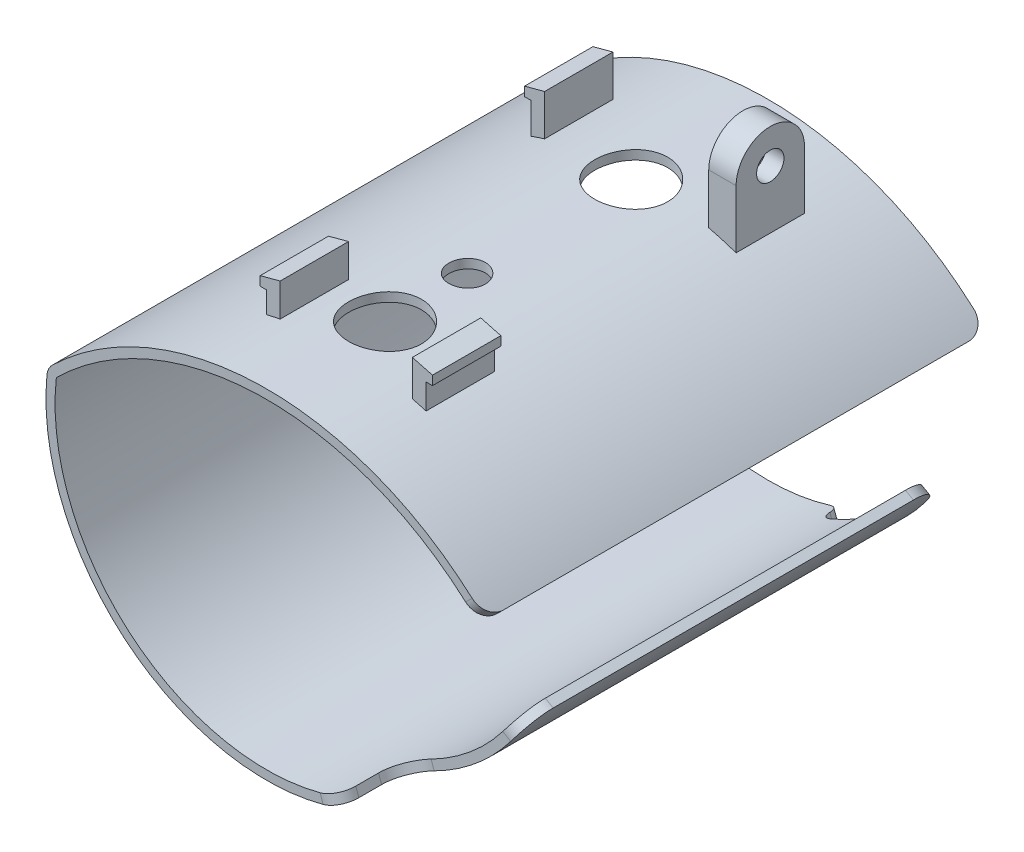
ISO-10303-21;
HEADER;
FILE_DESCRIPTION(('STEP AP214'),'2;1');
FILE_NAME('part.step','',(''),(''),'','','');
FILE_SCHEMA(('AUTOMOTIVE_DESIGN { 1 0 10303 214 1 1 1 1 }'));
ENDSEC;
DATA;
#1=APPLICATION_CONTEXT('core data for automotive mechanical design processes');
#2=APPLICATION_PROTOCOL_DEFINITION('international standard','automotive_design',2000,#1);
#3=PRODUCT_CONTEXT('',#1,'mechanical');
#4=PRODUCT('Part','Part','',(#3));
#5=PRODUCT_RELATED_PRODUCT_CATEGORY('part','',(#4));
#6=PRODUCT_DEFINITION_FORMATION('','',#4);
#7=PRODUCT_DEFINITION_CONTEXT('part definition',#1,'design');
#8=PRODUCT_DEFINITION('design','',#6,#7);
#9=PRODUCT_DEFINITION_SHAPE('','',#8);
#10=(LENGTH_UNIT() NAMED_UNIT(*) SI_UNIT(.MILLI.,.METRE.));
#11=(NAMED_UNIT(*) PLANE_ANGLE_UNIT() SI_UNIT($,.RADIAN.));
#12=(NAMED_UNIT(*) SI_UNIT($,.STERADIAN.) SOLID_ANGLE_UNIT());
#13=UNCERTAINTY_MEASURE_WITH_UNIT(LENGTH_MEASURE(1.E-05),#10,'distance_accuracy_value','');
#14=(GEOMETRIC_REPRESENTATION_CONTEXT(3) GLOBAL_UNCERTAINTY_ASSIGNED_CONTEXT((#13)) GLOBAL_UNIT_ASSIGNED_CONTEXT((#10,
#11,#12)) REPRESENTATION_CONTEXT('',''));
#15=CARTESIAN_POINT('',(0.,0.,0.));
#16=DIRECTION('',(0.,0.,1.));
#17=DIRECTION('',(1.,0.,0.));
#18=AXIS2_PLACEMENT_3D('',#15,#16,#17);
#19=CARTESIAN_POINT('',(8.,14.539610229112,10.75));
#20=DIRECTION('',(1.,0.,0.));
#21=DIRECTION('',(0.,0.,-1.));
#22=AXIS2_PLACEMENT_3D('',#19,#20,#21);
#23=CYLINDRICAL_SURFACE('',#22,3.75);
#24=DIRECTION('',(1.,0.,0.));
#25=VECTOR('',#24,1.);
#26=CARTESIAN_POINT('',(0.,14.539610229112,7.));
#27=LINE('',#26,#25);
#28=CARTESIAN_POINT('',(8.,14.539610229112,7.));
#29=VERTEX_POINT('',#28);
#30=CARTESIAN_POINT('',(11.,14.539610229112,7.));
#31=VERTEX_POINT('',#30);
#32=EDGE_CURVE('E507',#29,#31,#27,.T.);
#33=ORIENTED_EDGE('',*,*,#32,.F.);
#34=CARTESIAN_POINT('',(8.,14.539610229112,10.75));
#35=DIRECTION('',(-1.,0.,0.));
#36=DIRECTION('',(0.,-1.,0.));
#37=AXIS2_PLACEMENT_3D('',#34,#35,#36);
#38=CIRCLE('',#37,3.75);
#39=CARTESIAN_POINT('',(8.,14.539610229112,14.5));
#40=VERTEX_POINT('',#39);
#41=EDGE_CURVE('E844',#40,#29,#38,.T.);
#42=ORIENTED_EDGE('',*,*,#41,.F.);
#43=DIRECTION('',(-1.,0.,0.));
#44=VECTOR('',#43,1.);
#45=CARTESIAN_POINT('',(8.,14.539610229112,14.5));
#46=LINE('',#45,#44);
#47=CARTESIAN_POINT('',(11.,14.539610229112,14.5));
#48=VERTEX_POINT('',#47);
#49=EDGE_CURVE('E849',#48,#40,#46,.T.);
#50=ORIENTED_EDGE('',*,*,#49,.F.);
#51=CARTESIAN_POINT('',(11.,14.539610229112,10.75));
#52=DIRECTION('',(1.,0.,0.));
#53=DIRECTION('',(0.,0.,-1.));
#54=AXIS2_PLACEMENT_3D('',#51,#52,#53);
#55=CIRCLE('',#54,3.75);
#56=EDGE_CURVE('E846',#31,#48,#55,.T.);
#57=ORIENTED_EDGE('',*,*,#56,.F.);
#58=EDGE_LOOP('',(#33,#42,#50,#57));
#59=FACE_BOUND('',#58,.T.);
#60=ADVANCED_FACE('F33',(#59),#23,.T.);
#61=CARTESIAN_POINT('',(0.,-23.8,55.));
#62=DIRECTION('',(0.,0.,-1.));
#63=DIRECTION('',(-1.,0.,0.));
#64=AXIS2_PLACEMENT_3D('',#61,#62,#63);
#65=CYLINDRICAL_SURFACE('',#64,33.8);
#66=DIRECTION('',(0.,0.,1.));
#67=VECTOR('',#66,1.);
#68=CARTESIAN_POINT('',(-8.,9.03961022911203,39.5));
#69=LINE('',#68,#67);
#70=CARTESIAN_POINT('',(-8.,9.03961022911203,39.5));
#71=VERTEX_POINT('',#70);
#72=CARTESIAN_POINT('',(-8.,9.03961022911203,47.));
#73=VERTEX_POINT('',#72);
#74=EDGE_CURVE('E296',#71,#73,#69,.T.);
#75=ORIENTED_EDGE('',*,*,#74,.F.);
#76=CARTESIAN_POINT('',(0.,-23.8,39.5));
#77=DIRECTION('',(0.,0.,1.));
#78=DIRECTION('',(-1.,0.,0.));
#79=AXIS2_PLACEMENT_3D('',#76,#77,#78);
#80=CIRCLE('',#79,33.8);
#81=CARTESIAN_POINT('',(-6.5,9.36911213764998,39.5));
#82=VERTEX_POINT('',#81);
#83=EDGE_CURVE('E323',#82,#71,#80,.T.);
#84=ORIENTED_EDGE('',*,*,#83,.F.);
#85=DIRECTION('',(0.,0.,1.));
#86=VECTOR('',#85,1.);
#87=CARTESIAN_POINT('',(-6.5,9.36911213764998,39.5));
#88=LINE('',#87,#86);
#89=CARTESIAN_POINT('',(-6.5,9.36911213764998,47.));
#90=VERTEX_POINT('',#89);
#91=EDGE_CURVE('E336',#82,#90,#88,.T.);
#92=ORIENTED_EDGE('',*,*,#91,.T.);
#93=CARTESIAN_POINT('',(0.,-23.8,47.));
#94=DIRECTION('',(0.,0.,1.));
#95=DIRECTION('',(-1.,0.,0.));
#96=AXIS2_PLACEMENT_3D('',#93,#94,#95);
#97=CIRCLE('',#96,33.8);
#98=EDGE_CURVE('E301',#90,#73,#97,.T.);
#99=ORIENTED_EDGE('',*,*,#98,.T.);
#100=EDGE_LOOP('',(#75,#84,#92,#99));
#101=FACE_BOUND('',#100,.T.);
#102=DIRECTION('',(0.,0.,1.));
#103=VECTOR('',#102,1.);
#104=CARTESIAN_POINT('',(8.,9.03961022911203,39.5));
#105=LINE('',#104,#103);
#106=CARTESIAN_POINT('',(8.,9.03961022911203,39.5));
#107=VERTEX_POINT('',#106);
#108=CARTESIAN_POINT('',(8.,9.03961022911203,47.));
#109=VERTEX_POINT('',#108);
#110=EDGE_CURVE('E387',#107,#109,#105,.T.);
#111=ORIENTED_EDGE('',*,*,#110,.F.);
#112=CARTESIAN_POINT('',(0.,-23.8,39.5));
#113=DIRECTION('',(0.,0.,1.));
#114=DIRECTION('',(-1.,0.,0.));
#115=AXIS2_PLACEMENT_3D('',#112,#113,#114);
#116=CIRCLE('',#115,33.8);
#117=CARTESIAN_POINT('',(9.49999999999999,8.63747832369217,39.5));
#118=VERTEX_POINT('',#117);
#119=EDGE_CURVE('E359',#118,#107,#116,.T.);
#120=ORIENTED_EDGE('',*,*,#119,.F.);
#121=DIRECTION('',(0.,0.,1.));
#122=VECTOR('',#121,1.);
#123=CARTESIAN_POINT('',(9.49999999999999,8.63747832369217,39.5));
#124=LINE('',#123,#122);
#125=CARTESIAN_POINT('',(9.49999999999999,8.63747832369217,47.));
#126=VERTEX_POINT('',#125);
#127=EDGE_CURVE('E373',#118,#126,#124,.T.);
#128=ORIENTED_EDGE('',*,*,#127,.T.);
#129=CARTESIAN_POINT('',(0.,-23.8,47.));
#130=DIRECTION('',(0.,0.,1.));
#131=DIRECTION('',(-1.,0.,0.));
#132=AXIS2_PLACEMENT_3D('',#129,#130,#131);
#133=CIRCLE('',#132,33.8);
#134=EDGE_CURVE('E346',#126,#109,#133,.T.);
#135=ORIENTED_EDGE('',*,*,#134,.T.);
#136=EDGE_LOOP('',(#111,#120,#128,#135));
#137=FACE_BOUND('',#136,.T.);
#138=CARTESIAN_POINT('',(0.,-23.8,14.5));
#139=DIRECTION('',(0.,0.,1.));
#140=DIRECTION('',(-1.,0.,0.));
#141=AXIS2_PLACEMENT_3D('',#138,#139,#140);
#142=CIRCLE('',#141,33.8);
#143=CARTESIAN_POINT('',(11.,8.15997496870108,14.5));
#144=VERTEX_POINT('',#143);
#145=CARTESIAN_POINT('',(8.,9.03961022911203,14.5));
#146=VERTEX_POINT('',#145);
#147=EDGE_CURVE('E457',#144,#146,#142,.T.);
#148=ORIENTED_EDGE('',*,*,#147,.T.);
#149=DIRECTION('',(0.,0.,-1.));
#150=VECTOR('',#149,1.);
#151=CARTESIAN_POINT('',(8.,9.03961022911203,14.5));
#152=LINE('',#151,#150);
#153=CARTESIAN_POINT('',(8.,9.03961022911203,7.));
#154=VERTEX_POINT('',#153);
#155=EDGE_CURVE('E465',#146,#154,#152,.T.);
#156=ORIENTED_EDGE('',*,*,#155,.T.);
#157=CARTESIAN_POINT('',(0.,-23.8,7.));
#158=DIRECTION('',(0.,0.,1.));
#159=DIRECTION('',(-1.,0.,0.));
#160=AXIS2_PLACEMENT_3D('',#157,#158,#159);
#161=CIRCLE('',#160,33.8);
#162=CARTESIAN_POINT('',(11.,8.15997496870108,7.));
#163=VERTEX_POINT('',#162);
#164=EDGE_CURVE('E439',#163,#154,#161,.T.);
#165=ORIENTED_EDGE('',*,*,#164,.F.);
#166=DIRECTION('',(0.,0.,-1.));
#167=VECTOR('',#166,1.);
#168=CARTESIAN_POINT('',(11.,8.15997496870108,14.5));
#169=LINE('',#168,#167);
#170=EDGE_CURVE('E466',#144,#163,#169,.T.);
#171=ORIENTED_EDGE('',*,*,#170,.F.);
#172=EDGE_LOOP('',(#148,#156,#165,#171));
#173=FACE_BOUND('',#172,.T.);
#174=CARTESIAN_POINT('',(0.,-23.8,0.));
#175=DIRECTION('',(0.,0.,1.));
#176=DIRECTION('',(-1.,0.,0.));
#177=AXIS2_PLACEMENT_3D('',#174,#175,#176);
#178=CIRCLE('',#177,33.8);
#179=CARTESIAN_POINT('',(22.5496637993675,1.37841660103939,0.));
#180=VERTEX_POINT('',#179);
#181=CARTESIAN_POINT('',(-23.4787422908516,0.51437147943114,0.));
#182=VERTEX_POINT('',#181);
#183=EDGE_CURVE('E588',#180,#182,#178,.T.);
#184=ORIENTED_EDGE('',*,*,#183,.T.);
#185=DIRECTION('',(0.,0.,-1.));
#186=VECTOR('',#185,1.);
#187=CARTESIAN_POINT('',(-23.4787422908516,0.514371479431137,55.));
#188=LINE('',#187,#186);
#189=CARTESIAN_POINT('',(-23.4787422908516,0.51437147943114,55.));
#190=VERTEX_POINT('',#189);
#191=EDGE_CURVE('E40',#182,#190,#188,.F.);
#192=ORIENTED_EDGE('',*,*,#191,.T.);
#193=CARTESIAN_POINT('',(0.,-23.8,55.));
#194=DIRECTION('',(0.,0.,1.));
#195=DIRECTION('',(-1.,0.,0.));
#196=AXIS2_PLACEMENT_3D('',#193,#194,#195);
#197=CIRCLE('',#196,33.8);
#198=CARTESIAN_POINT('',(22.5496637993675,1.37841660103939,55.));
#199=VERTEX_POINT('',#198);
#200=EDGE_CURVE('E597',#199,#190,#197,.T.);
#201=ORIENTED_EDGE('',*,*,#200,.F.);
#202=CARTESIAN_POINT('',(22.5496637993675,1.37841660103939,55.));
#203=CARTESIAN_POINT('',(22.5915737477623,1.34088331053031,54.9999996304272));
#204=CARTESIAN_POINT('',(22.6333689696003,1.30326186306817,54.9976329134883));
#205=CARTESIAN_POINT('',(22.7164766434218,1.22808065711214,54.9881869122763));
#206=CARTESIAN_POINT('',(22.7577891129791,1.19052089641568,54.9811078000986));
#207=CARTESIAN_POINT('',(22.8804938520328,1.07840867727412,54.9528624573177));
#208=CARTESIAN_POINT('',(22.9607914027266,1.00429966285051,54.9246880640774));
#209=CARTESIAN_POINT('',(23.116109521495,0.859618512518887,54.8504052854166));
#210=CARTESIAN_POINT('',(23.1911272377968,0.789048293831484,54.8042872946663));
#211=CARTESIAN_POINT('',(23.3338857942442,0.653618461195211,54.6954198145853));
#212=CARTESIAN_POINT('',(23.401628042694,0.588757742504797,54.6326735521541));
#213=CARTESIAN_POINT('',(23.5280309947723,0.466839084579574,54.4923913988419));
#214=CARTESIAN_POINT('',(23.5867000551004,0.409773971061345,54.4148692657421));
#215=CARTESIAN_POINT('',(23.6935795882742,0.305183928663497,54.2471746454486));
#216=CARTESIAN_POINT('',(23.741787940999,0.257660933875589,54.1569995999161));
#217=CARTESIAN_POINT('',(23.8265783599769,0.173688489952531,53.966525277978));
#218=CARTESIAN_POINT('',(23.8631535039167,0.13724563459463,53.8662200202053));
#219=CARTESIAN_POINT('',(23.9237517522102,0.0766821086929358,53.6583876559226));
#220=CARTESIAN_POINT('',(23.9477821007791,0.0525543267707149,53.5508647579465));
#221=CARTESIAN_POINT('',(23.9768146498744,0.0233630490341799,53.3689143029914));
#222=CARTESIAN_POINT('',(23.9855058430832,0.0146095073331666,53.2956246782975));
#223=CARTESIAN_POINT('',(23.9970968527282,0.00292758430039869,53.148233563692));
#224=CARTESIAN_POINT('',(24.0000047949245,-8.97016953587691E-06,53.0741333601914));
#225=CARTESIAN_POINT('',(24.,0.,53.));
#226=B_SPLINE_CURVE_WITH_KNOTS('',3,(#202,#203,#204,#205,#206,#207,#208,#209,#210,#211,#212,
#213,#214,#215,#216,#217,#218,#219,#220,#221,#222,#223,#224,#225),.UNSPECIFIED.,.F.,.F.,(4,2,2,
2,2,2,2,2,2,2,2,4),(0.,0.168677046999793,0.33734793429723,0.674141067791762,1.01111473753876,
1.34802306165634,1.68461921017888,2.02128351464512,2.35814777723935,2.69481729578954,
2.91735065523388,3.13957112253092),.UNSPECIFIED.);
#227=CARTESIAN_POINT('',(24.,0.,53.));
#228=VERTEX_POINT('',#227);
#229=EDGE_CURVE('E524',#199,#228,#226,.T.);
#230=ORIENTED_EDGE('',*,*,#229,.T.);
#231=DIRECTION('',(0.,0.,-1.));
#232=VECTOR('',#231,1.);
#233=CARTESIAN_POINT('',(24.,0.,55.));
#234=LINE('',#233,#232);
#235=CARTESIAN_POINT('',(24.,0.,2.));
#236=VERTEX_POINT('',#235);
#237=EDGE_CURVE('E599',#228,#236,#234,.T.);
#238=ORIENTED_EDGE('',*,*,#237,.T.);
#239=CARTESIAN_POINT('',(24.,0.,2.));
#240=CARTESIAN_POINT('',(23.9999991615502,-3.04049213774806E-07,1.94373244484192));
#241=CARTESIAN_POINT('',(23.9983270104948,0.00168717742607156,1.88749184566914));
#242=CARTESIAN_POINT('',(23.9916523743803,0.00841551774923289,1.77541306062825));
#243=CARTESIAN_POINT('',(23.9866500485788,0.0134562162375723,1.71957485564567));
#244=CARTESIAN_POINT('',(23.9666878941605,0.0335530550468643,1.55336071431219));
#245=CARTESIAN_POINT('',(23.9467727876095,0.0535841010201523,1.44409808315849));
#246=CARTESIAN_POINT('',(23.8941841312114,0.10626138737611,1.23186859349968));
#247=CARTESIAN_POINT('',(23.8615044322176,0.138913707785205,1.12890479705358));
#248=CARTESIAN_POINT('',(23.7841665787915,0.215752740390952,0.932197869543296));
#249=CARTESIAN_POINT('',(23.739510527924,0.259937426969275,0.838453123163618));
#250=CARTESIAN_POINT('',(23.6393096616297,0.358393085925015,0.662860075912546));
#251=CARTESIAN_POINT('',(23.5837665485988,0.412662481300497,0.581009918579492));
#252=CARTESIAN_POINT('',(23.4631530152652,0.52955996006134,0.431494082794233));
#253=CARTESIAN_POINT('',(23.3980808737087,0.592189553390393,0.363830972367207));
#254=CARTESIAN_POINT('',(23.2601197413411,0.723782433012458,0.244656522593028));
#255=CARTESIAN_POINT('',(23.1872340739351,0.792743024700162,0.193138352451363));
#256=CARTESIAN_POINT('',(23.0355465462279,0.934881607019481,0.107684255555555));
#257=CARTESIAN_POINT('',(22.9567480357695,1.0080572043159,0.0737384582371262));
#258=CARTESIAN_POINT('',(22.8228587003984,1.13115248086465,0.0327386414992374));
#259=CARTESIAN_POINT('',(22.7688070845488,1.18052831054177,0.0204667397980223));
#260=CARTESIAN_POINT('',(22.6597876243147,1.27946352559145,0.00409838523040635));
#261=CARTESIAN_POINT('',(22.6048212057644,1.32902254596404,-9.77217224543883E-06));
#262=CARTESIAN_POINT('',(22.5496637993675,1.37841660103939,0.));
#263=B_SPLINE_CURVE_WITH_KNOTS('',3,(#239,#240,#241,#242,#243,#244,#245,#246,#247,#248,#249,
#250,#251,#252,#253,#254,#255,#256,#257,#258,#259,#260,#261,#262),.UNSPECIFIED.,.F.,.F.,(4,2,2,
2,2,2,2,2,2,2,2,4),(0.,0.16869898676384,0.337389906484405,0.674217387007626,1.01120732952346,
1.34813812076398,1.68501626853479,2.02195534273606,2.35875166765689,2.6953586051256,
2.91762389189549,3.1395702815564),.UNSPECIFIED.);
#264=EDGE_CURVE('E533',#236,#180,#263,.T.);
#265=ORIENTED_EDGE('',*,*,#264,.T.);
#266=EDGE_LOOP('',(#184,#192,#201,#230,#238,#265));
#267=FACE_BOUND('',#266,.T.);
#268=CARTESIAN_POINT('',(0.,9.99999999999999,11.));
#269=CARTESIAN_POINT('',(-0.223842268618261,9.99999701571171,11.0000095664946));
#270=CARTESIAN_POINT('',(-0.447826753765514,9.99775286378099,11.0188528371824));
#271=CARTESIAN_POINT('',(-0.889569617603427,9.98901633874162,11.0937286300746));
#272=CARTESIAN_POINT('',(-1.10732113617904,9.98251945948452,11.1498006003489));
#273=CARTESIAN_POINT('',(-1.53013847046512,9.96600981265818,11.2974643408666));
#274=CARTESIAN_POINT('',(-1.73521247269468,9.95599934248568,11.3890329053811));
#275=CARTESIAN_POINT('',(-2.12704134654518,9.93357759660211,11.6050413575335));
#276=CARTESIAN_POINT('',(-2.31379949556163,9.92116675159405,11.7294753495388));
#277=CARTESIAN_POINT('',(-2.66466186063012,9.89526242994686,12.0083426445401));
#278=CARTESIAN_POINT('',(-2.82866224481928,9.8817644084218,12.1629061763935));
#279=CARTESIAN_POINT('',(-3.12845994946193,9.8552439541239,12.497365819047));
#280=CARTESIAN_POINT('',(-3.26425587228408,9.84222154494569,12.6772631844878));
#281=CARTESIAN_POINT('',(-3.504171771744,9.81808166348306,13.0579522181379));
#282=CARTESIAN_POINT('',(-3.60819533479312,9.80697003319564,13.2588050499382));
#283=CARTESIAN_POINT('',(-3.78099799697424,9.78796892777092,13.675282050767));
#284=CARTESIAN_POINT('',(-3.84977829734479,9.78007934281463,13.8909057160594));
#285=CARTESIAN_POINT('',(-3.94982846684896,9.76845849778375,14.3297305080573));
#286=CARTESIAN_POINT('',(-3.98127289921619,9.76470789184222,14.5528913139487));
#287=CARTESIAN_POINT('',(-4.00629874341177,9.76173026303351,15.00135174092));
#288=CARTESIAN_POINT('',(-3.99988152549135,9.76250307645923,15.2266512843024));
#289=CARTESIAN_POINT('',(-3.94950968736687,9.76846726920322,15.6717810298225));
#290=CARTESIAN_POINT('',(-3.90574686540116,9.7736360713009,15.8916332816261));
#291=CARTESIAN_POINT('',(-3.78222510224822,9.7877746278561,16.3208510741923));
#292=CARTESIAN_POINT('',(-3.70246550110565,9.79674445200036,16.5302164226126));
#293=CARTESIAN_POINT('',(-3.50900651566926,9.81750010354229,16.9331160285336));
#294=CARTESIAN_POINT('',(-3.39522328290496,9.82929287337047,17.1266096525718));
#295=CARTESIAN_POINT('',(-3.13700697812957,9.85436017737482,17.4918281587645));
#296=CARTESIAN_POINT('',(-2.99257264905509,9.86763477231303,17.6635521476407));
#297=CARTESIAN_POINT('',(-2.67608877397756,9.89427047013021,17.9814703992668));
#298=CARTESIAN_POINT('',(-2.50387381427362,9.90763159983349,18.1275000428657));
#299=CARTESIAN_POINT('',(-2.13728815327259,9.93285783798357,18.3886042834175));
#300=CARTESIAN_POINT('',(-1.94291740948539,9.94472294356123,18.5036788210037));
#301=CARTESIAN_POINT('',(-1.53741440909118,9.96562656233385,18.6996044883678));
#302=CARTESIAN_POINT('',(-1.32627740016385,9.9746642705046,18.7804458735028));
#303=CARTESIAN_POINT('',(-0.893295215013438,9.98888727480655,18.9054826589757));
#304=CARTESIAN_POINT('',(-0.671450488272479,9.99407273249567,18.949679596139));
#305=CARTESIAN_POINT('',(-0.224774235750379,9.99998605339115,18.999960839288));
#306=CARTESIAN_POINT('',(3.14132146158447E-05,10.0007404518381,19.0062720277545));
#307=CARTESIAN_POINT('',(0.447497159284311,9.99777815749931,18.9812005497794));
#308=CARTESIAN_POINT('',(0.670157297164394,9.99406154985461,18.9498186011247));
#309=CARTESIAN_POINT('',(1.10634626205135,9.98259148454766,18.8504400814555));
#310=CARTESIAN_POINT('',(1.31989994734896,9.97484989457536,18.782551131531));
#311=CARTESIAN_POINT('',(1.73259025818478,9.95619706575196,18.6121972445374));
#312=CARTESIAN_POINT('',(1.93172644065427,9.94528572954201,18.5097312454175));
#313=CARTESIAN_POINT('',(2.31094589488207,9.92144483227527,18.2725790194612));
#314=CARTESIAN_POINT('',(2.49093638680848,9.90850613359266,18.1377453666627));
#315=CARTESIAN_POINT('',(2.8258126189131,9.88208801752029,17.8398946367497));
#316=CARTESIAN_POINT('',(2.98069746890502,9.86860858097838,17.6768765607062));
#317=CARTESIAN_POINT('',(3.26176585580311,9.84254690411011,17.3262877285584));
#318=CARTESIAN_POINT('',(3.38779941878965,9.82996957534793,17.1385963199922));
#319=CARTESIAN_POINT('',(3.6065529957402,9.80721533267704,16.7445769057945));
#320=CARTESIAN_POINT('',(3.69927361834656,9.79703837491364,16.5382492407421));
#321=CARTESIAN_POINT('',(3.84852412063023,9.78026991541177,16.1133068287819));
#322=CARTESIAN_POINT('',(3.90513989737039,9.7736699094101,15.8947226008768));
#323=CARTESIAN_POINT('',(3.98085084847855,9.76477771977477,15.4510671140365));
#324=CARTESIAN_POINT('',(3.99994757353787,9.76248535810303,15.2259961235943));
#325=CARTESIAN_POINT('',(4.00005188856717,9.76247280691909,14.7772476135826));
#326=CARTESIAN_POINT('',(3.98129507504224,9.76472433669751,14.5535701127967));
#327=CARTESIAN_POINT('',(3.90672223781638,9.77348522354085,14.1125697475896));
#328=CARTESIAN_POINT('',(3.85090619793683,9.77999458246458,13.8952468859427));
#329=CARTESIAN_POINT('',(3.70387057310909,9.79652920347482,13.4731475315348));
#330=CARTESIAN_POINT('',(3.61266109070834,9.80655346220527,13.268367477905));
#331=CARTESIAN_POINT('',(3.39745101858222,9.82899017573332,12.8769823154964));
#332=CARTESIAN_POINT('',(3.27345018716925,9.841402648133,12.6903773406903));
#333=CARTESIAN_POINT('',(2.99529962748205,9.86730983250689,12.3394337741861));
#334=CARTESIAN_POINT('',(2.84097419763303,9.88081056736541,12.1752348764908));
#335=CARTESIAN_POINT('',(2.50691828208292,9.90731929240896,11.8749713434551));
#336=CARTESIAN_POINT('',(2.32718178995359,9.92032716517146,11.7389133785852));
#337=CARTESIAN_POINT('',(1.94670730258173,9.9444330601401,11.498404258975));
#338=CARTESIAN_POINT('',(1.74589952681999,9.95552439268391,11.3940628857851));
#339=CARTESIAN_POINT('',(1.32959809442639,9.97447867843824,11.2207279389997));
#340=CARTESIAN_POINT('',(1.11412086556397,9.9823451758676,11.1516955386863));
#341=CARTESIAN_POINT('',(0.747914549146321,9.99204389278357,11.0676618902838));
#342=CARTESIAN_POINT('',(0.59950451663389,9.99501307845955,11.0423246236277));
#343=CARTESIAN_POINT('',(0.300751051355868,9.9989921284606,11.0084905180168));
#344=CARTESIAN_POINT('',(0.150407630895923,10.0000020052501,10.9999935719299));
#345=CARTESIAN_POINT('',(0.,9.99999999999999,11.));
#346=B_SPLINE_CURVE_WITH_KNOTS('',3,(#268,#269,#270,#271,#272,#273,#274,#275,#276,#277,#278,
#279,#280,#281,#282,#283,#284,#285,#286,#287,#288,#289,#290,#291,#292,#293,#294,#295,#296,#297,
#298,#299,#300,#301,#302,#303,#304,#305,#306,#307,#308,#309,#310,#311,#312,#313,#314,#315,#316,
#317,#318,#319,#320,#321,#322,#323,#324,#325,#326,#327,#328,#329,#330,#331,#332,#333,#334,#335,
#336,#337,#338,#339,#340,#341,#342,#343,#344,#345),.UNSPECIFIED.,.T.,.F.,(4,2,2,2,2,2,2,2,2,2,2,
2,2,2,2,2,2,2,2,2,2,2,2,2,2,2,2,2,2,2,2,2,2,2,2,2,2,2,4),(0.,0.670977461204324,1.34266703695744,
2.01391823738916,2.68504910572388,3.3591478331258,4.03327995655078,4.70943787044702,
5.38557273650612,6.05853373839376,6.73147038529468,7.4009716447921,8.07048517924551,
8.7416624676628,9.41286728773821,10.0882271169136,10.7635882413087,11.4391414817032,
12.1146663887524,12.7861417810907,13.4576043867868,14.1270983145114,14.7966128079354,
15.4692366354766,16.1418843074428,16.8179529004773,17.4940091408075,18.1684509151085,
18.8428648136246,19.51309417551,20.1833238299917,20.8533623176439,21.5234057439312,
22.1974524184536,22.8716586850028,23.5481727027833,24.2239411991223,24.6747978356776,
25.1256516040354),.UNSPECIFIED.);
#347=CARTESIAN_POINT('',(0.,9.99999999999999,11.));
#348=VERTEX_POINT('',#347);
#349=EDGE_CURVE('E539',#348,#348,#346,.T.);
#350=ORIENTED_EDGE('',*,*,#349,.F.);
#351=EDGE_LOOP('',(#350));
#352=FACE_BOUND('',#351,.T.);
#353=CARTESIAN_POINT('',(0.,9.99999999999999,31.));
#354=CARTESIAN_POINT('',(-0.112235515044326,9.99999921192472,31.0000049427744));
#355=CARTESIAN_POINT('',(-0.224549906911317,9.99943498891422,31.0094793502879));
#356=CARTESIAN_POINT('',(-0.446078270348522,9.99723843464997,31.0471391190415));
#357=CARTESIAN_POINT('',(-0.555288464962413,9.9956048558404,31.0753463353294));
#358=CARTESIAN_POINT('',(-0.76736746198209,9.99145441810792,31.1496594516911));
#359=CARTESIAN_POINT('',(-0.870239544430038,9.98893802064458,31.1957560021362));
#360=CARTESIAN_POINT('',(-1.06675873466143,9.98330508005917,31.3045243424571));
#361=CARTESIAN_POINT('',(-1.16040796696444,9.98018867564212,31.3671923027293));
#362=CARTESIAN_POINT('',(-1.33597739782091,9.97370136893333,31.5074181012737));
#363=CARTESIAN_POINT('',(-1.4178834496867,9.97033016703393,31.5849936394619));
#364=CARTESIAN_POINT('',(-1.56752062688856,9.96371578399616,31.7527962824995));
#365=CARTESIAN_POINT('',(-1.63525116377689,9.9604726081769,31.8430239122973));
#366=CARTESIAN_POINT('',(-1.75465726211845,9.95447774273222,32.0336483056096));
#367=CARTESIAN_POINT('',(-1.80632122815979,9.95172640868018,32.1340523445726));
#368=CARTESIAN_POINT('',(-1.89205339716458,9.94702932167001,32.3421283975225));
#369=CARTESIAN_POINT('',(-1.92612177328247,9.94508356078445,32.4498003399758));
#370=CARTESIAN_POINT('',(-1.97565683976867,9.94221986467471,32.6692208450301));
#371=CARTESIAN_POINT('',(-1.99114547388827,9.94130071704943,32.780964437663));
#372=CARTESIAN_POINT('',(-2.00314912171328,9.9405902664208,33.0054689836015));
#373=CARTESIAN_POINT('',(-1.99966433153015,9.94079895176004,33.1182299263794));
#374=CARTESIAN_POINT('',(-1.97383827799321,9.94231950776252,33.3414188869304));
#375=CARTESIAN_POINT('',(-1.95152074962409,9.94362998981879,33.4518496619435));
#376=CARTESIAN_POINT('',(-1.88869953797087,9.9472042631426,33.6673947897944));
#377=CARTESIAN_POINT('',(-1.8481957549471,9.94946805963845,33.7725091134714));
#378=CARTESIAN_POINT('',(-1.75012479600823,9.95469543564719,33.9745138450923));
#379=CARTESIAN_POINT('',(-1.69254683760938,9.95765945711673,34.0713990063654));
#380=CARTESIAN_POINT('',(-1.56196977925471,9.96395279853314,34.2541378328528));
#381=CARTESIAN_POINT('',(-1.4889705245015,9.96728212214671,34.3399913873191));
#382=CARTESIAN_POINT('',(-1.32948930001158,9.97393702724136,34.4983680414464));
#383=CARTESIAN_POINT('',(-1.24298678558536,9.9772625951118,34.5708704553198));
#384=CARTESIAN_POINT('',(-1.05902660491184,9.9835302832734,34.700327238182));
#385=CARTESIAN_POINT('',(-0.961568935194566,9.98647240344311,34.7572816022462));
#386=CARTESIAN_POINT('',(-0.758452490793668,9.99164185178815,34.8540237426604));
#387=CARTESIAN_POINT('',(-0.652793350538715,9.99386914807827,34.893810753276));
#388=CARTESIAN_POINT('',(-0.436278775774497,9.99735751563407,34.9550750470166));
#389=CARTESIAN_POINT('',(-0.325423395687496,9.99861859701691,34.9765525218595));
#390=CARTESIAN_POINT('',(-0.101842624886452,10.0000311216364,35.0005624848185));
#391=CARTESIAN_POINT('',(0.0108796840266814,10.0001842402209,35.0031235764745));
#392=CARTESIAN_POINT('',(0.235152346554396,9.99936803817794,34.9893027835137));
#393=CARTESIAN_POINT('',(0.346702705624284,9.99839872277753,34.9729209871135));
#394=CARTESIAN_POINT('',(0.565384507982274,9.99544786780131,34.9217031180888));
#395=CARTESIAN_POINT('',(0.672519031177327,9.99346704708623,34.8868801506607));
#396=CARTESIAN_POINT('',(0.879423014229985,9.98871607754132,34.7997817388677));
#397=CARTESIAN_POINT('',(0.979192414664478,9.98594592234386,34.7475061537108));
#398=CARTESIAN_POINT('',(1.16866515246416,9.97992347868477,34.6269134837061));
#399=CARTESIAN_POINT('',(1.25835629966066,9.97667061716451,34.5585772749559));
#400=CARTESIAN_POINT('',(1.42500385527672,9.97005083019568,34.4078310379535));
#401=CARTESIAN_POINT('',(1.50196015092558,9.96668390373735,34.3254208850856));
#402=CARTESIAN_POINT('',(1.64105021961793,9.96021063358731,34.1487427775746));
#403=CARTESIAN_POINT('',(1.70316545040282,9.95710461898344,34.0544602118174));
#404=CARTESIAN_POINT('',(1.81068336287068,9.9515086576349,33.8567871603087));
#405=CARTESIAN_POINT('',(1.85608613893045,9.94901870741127,33.7533967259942));
#406=CARTESIAN_POINT('',(1.92885815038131,9.94493803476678,33.5405108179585));
#407=CARTESIAN_POINT('',(1.95623909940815,9.94334672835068,33.4310193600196));
#408=CARTESIAN_POINT('',(1.99222848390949,9.94124116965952,33.2089835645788));
#409=CARTESIAN_POINT('',(2.00083708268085,9.94072690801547,33.0964392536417));
#410=CARTESIAN_POINT('',(1.99903584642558,9.94083365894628,32.8716768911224));
#411=CARTESIAN_POINT('',(1.98865516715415,9.94145293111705,32.7594586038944));
#412=CARTESIAN_POINT('',(1.94923044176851,9.94375327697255,32.5383612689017));
#413=CARTESIAN_POINT('',(1.92018636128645,9.94543435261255,32.4294822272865));
#414=CARTESIAN_POINT('',(1.84426569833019,9.94966843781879,32.2181492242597));
#415=CARTESIAN_POINT('',(1.79738915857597,9.9522214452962,32.1156952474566));
#416=CARTESIAN_POINT('',(1.68713846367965,9.95791162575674,31.9201084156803));
#417=CARTESIAN_POINT('',(1.6237647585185,9.96104878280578,31.8269753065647));
#418=CARTESIAN_POINT('',(1.48221158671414,9.967559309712,31.6525265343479));
#419=CARTESIAN_POINT('',(1.40401120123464,9.97093300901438,31.5712278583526));
#420=CARTESIAN_POINT('',(1.23504960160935,9.97753372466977,31.4228849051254));
#421=CARTESIAN_POINT('',(1.14428531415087,9.9807607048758,31.3558441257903));
#422=CARTESIAN_POINT('',(0.952678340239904,9.98670738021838,31.2378758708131));
#423=CARTESIAN_POINT('',(0.851824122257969,9.98942648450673,31.1869671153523));
#424=CARTESIAN_POINT('',(0.643057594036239,9.99404286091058,31.102867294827));
#425=CARTESIAN_POINT('',(0.535153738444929,9.99594109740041,31.0696554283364));
#426=CARTESIAN_POINT('',(0.355488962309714,9.9982030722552,31.0305470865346));
#427=CARTESIAN_POINT('',(0.284890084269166,9.99887393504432,31.0191066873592));
#428=CARTESIAN_POINT('',(0.142871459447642,9.9997726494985,31.0038315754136));
#429=CARTESIAN_POINT('',(0.0714517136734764,10.0000005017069,30.999996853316));
#430=CARTESIAN_POINT('',(0.,9.99999999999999,31.));
#431=B_SPLINE_CURVE_WITH_KNOTS('',3,(#353,#354,#355,#356,#357,#358,#359,#360,#361,#362,#363,
#364,#365,#366,#367,#368,#369,#370,#371,#372,#373,#374,#375,#376,#377,#378,#379,#380,#381,#382,
#383,#384,#385,#386,#387,#388,#389,#390,#391,#392,#393,#394,#395,#396,#397,#398,#399,#400,#401,
#402,#403,#404,#405,#406,#407,#408,#409,#410,#411,#412,#413,#414,#415,#416,#417,#418,#419,#420,
#421,#422,#423,#424,#425,#426,#427,#428,#429,#430),.UNSPECIFIED.,.T.,.F.,(4,2,2,2,2,2,2,2,2,2,2,
2,2,2,2,2,2,2,2,2,2,2,2,2,2,2,2,2,2,2,2,2,2,2,2,2,2,2,4),(0.,0.33644570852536,0.673284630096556,
1.00994774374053,1.34653312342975,1.68352063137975,2.02052212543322,2.35776627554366,
2.69500710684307,3.03184924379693,3.36868789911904,3.70510266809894,4.04151928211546,
4.37814880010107,4.71478169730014,5.05193185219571,5.38908211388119,5.72624741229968,
6.063409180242,6.40006101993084,6.73671129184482,7.07312264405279,7.40953671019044,
7.74635340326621,8.083173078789,8.42041139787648,8.75764781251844,9.09466481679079,
9.43167888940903,9.76817595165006,10.1046736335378,10.4411705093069,10.7776582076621,
11.1146242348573,11.4516728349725,11.7891111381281,12.1261519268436,12.3403412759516,
12.5545303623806),.UNSPECIFIED.);
#432=CARTESIAN_POINT('',(0.,9.99999999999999,31.));
#433=VERTEX_POINT('',#432);
#434=EDGE_CURVE('E508',#433,#433,#431,.T.);
#435=ORIENTED_EDGE('',*,*,#434,.F.);
#436=EDGE_LOOP('',(#435));
#437=FACE_BOUND('',#436,.T.);
#438=CARTESIAN_POINT('',(0.,9.99999999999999,38.));
#439=CARTESIAN_POINT('',(-0.223842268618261,9.99999701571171,38.0000095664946));
#440=CARTESIAN_POINT('',(-0.447826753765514,9.99775286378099,38.0188528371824));
#441=CARTESIAN_POINT('',(-0.889569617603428,9.98901633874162,38.0937286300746));
#442=CARTESIAN_POINT('',(-1.10732113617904,9.98251945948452,38.1498006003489));
#443=CARTESIAN_POINT('',(-1.53013847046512,9.96600981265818,38.2974643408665));
#444=CARTESIAN_POINT('',(-1.73521247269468,9.95599934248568,38.3890329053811));
#445=CARTESIAN_POINT('',(-2.12704134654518,9.93357759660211,38.6050413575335));
#446=CARTESIAN_POINT('',(-2.31379949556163,9.92116675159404,38.7294753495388));
#447=CARTESIAN_POINT('',(-2.66466186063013,9.89526242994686,39.0083426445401));
#448=CARTESIAN_POINT('',(-2.82866224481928,9.8817644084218,39.1629061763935));
#449=CARTESIAN_POINT('',(-3.12845994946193,9.8552439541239,39.497365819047));
#450=CARTESIAN_POINT('',(-3.26425587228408,9.84222154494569,39.6772631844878));
#451=CARTESIAN_POINT('',(-3.504171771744,9.81808166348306,40.0579522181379));
#452=CARTESIAN_POINT('',(-3.60819533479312,9.80697003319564,40.2588050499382));
#453=CARTESIAN_POINT('',(-3.78099799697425,9.78796892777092,40.675282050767));
#454=CARTESIAN_POINT('',(-3.84977829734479,9.78007934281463,40.8909057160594));
#455=CARTESIAN_POINT('',(-3.94982846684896,9.76845849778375,41.3297305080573));
#456=CARTESIAN_POINT('',(-3.98127289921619,9.76470789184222,41.5528913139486));
#457=CARTESIAN_POINT('',(-4.00629874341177,9.76173026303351,42.00135174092));
#458=CARTESIAN_POINT('',(-3.99988152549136,9.76250307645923,42.2266512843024));
#459=CARTESIAN_POINT('',(-3.94950968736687,9.76846726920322,42.6717810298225));
#460=CARTESIAN_POINT('',(-3.90574686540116,9.7736360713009,42.8916332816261));
#461=CARTESIAN_POINT('',(-3.78222510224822,9.7877746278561,43.3208510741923));
#462=CARTESIAN_POINT('',(-3.70246550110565,9.79674445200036,43.5302164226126));
#463=CARTESIAN_POINT('',(-3.50900651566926,9.81750010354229,43.9331160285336));
#464=CARTESIAN_POINT('',(-3.39522328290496,9.82929287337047,44.1266096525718));
#465=CARTESIAN_POINT('',(-3.13700697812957,9.85436017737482,44.4918281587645));
#466=CARTESIAN_POINT('',(-2.99257264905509,9.86763477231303,44.6635521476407));
#467=CARTESIAN_POINT('',(-2.67608877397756,9.89427047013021,44.9814703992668));
#468=CARTESIAN_POINT('',(-2.50387381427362,9.90763159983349,45.1275000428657));
#469=CARTESIAN_POINT('',(-2.13728815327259,9.93285783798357,45.3886042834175));
#470=CARTESIAN_POINT('',(-1.94291740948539,9.94472294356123,45.5036788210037));
#471=CARTESIAN_POINT('',(-1.53741440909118,9.96562656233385,45.6996044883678));
#472=CARTESIAN_POINT('',(-1.32627740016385,9.9746642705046,45.7804458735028));
#473=CARTESIAN_POINT('',(-0.893295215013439,9.98888727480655,45.9054826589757));
#474=CARTESIAN_POINT('',(-0.671450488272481,9.99407273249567,45.949679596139));
#475=CARTESIAN_POINT('',(-0.224774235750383,9.99998605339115,45.999960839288));
#476=CARTESIAN_POINT('',(3.14132146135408E-05,10.0007404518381,46.0062720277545));
#477=CARTESIAN_POINT('',(0.44749715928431,9.99777815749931,45.9812005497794));
#478=CARTESIAN_POINT('',(0.670157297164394,9.99406154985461,45.9498186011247));
#479=CARTESIAN_POINT('',(1.10634626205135,9.98259148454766,45.8504400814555));
#480=CARTESIAN_POINT('',(1.31989994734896,9.97484989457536,45.782551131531));
#481=CARTESIAN_POINT('',(1.73259025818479,9.95619706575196,45.6121972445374));
#482=CARTESIAN_POINT('',(1.93172644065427,9.94528572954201,45.5097312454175));
#483=CARTESIAN_POINT('',(2.31094589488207,9.92144483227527,45.2725790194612));
#484=CARTESIAN_POINT('',(2.49093638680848,9.90850613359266,45.1377453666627));
#485=CARTESIAN_POINT('',(2.8258126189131,9.88208801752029,44.8398946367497));
#486=CARTESIAN_POINT('',(2.98069746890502,9.86860858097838,44.6768765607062));
#487=CARTESIAN_POINT('',(3.26176585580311,9.84254690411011,44.3262877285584));
#488=CARTESIAN_POINT('',(3.38779941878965,9.82996957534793,44.1385963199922));
#489=CARTESIAN_POINT('',(3.6065529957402,9.80721533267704,43.7445769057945));
#490=CARTESIAN_POINT('',(3.69927361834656,9.79703837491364,43.5382492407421));
#491=CARTESIAN_POINT('',(3.84852412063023,9.78026991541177,43.1133068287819));
#492=CARTESIAN_POINT('',(3.90513989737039,9.77366990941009,42.8947226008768));
#493=CARTESIAN_POINT('',(3.98085084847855,9.76477771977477,42.4510671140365));
#494=CARTESIAN_POINT('',(3.99994757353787,9.76248535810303,42.2259961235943));
#495=CARTESIAN_POINT('',(4.00005188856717,9.76247280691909,41.7772476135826));
#496=CARTESIAN_POINT('',(3.98129507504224,9.76472433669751,41.5535701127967));
#497=CARTESIAN_POINT('',(3.90672223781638,9.77348522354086,41.1125697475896));
#498=CARTESIAN_POINT('',(3.85090619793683,9.77999458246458,40.8952468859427));
#499=CARTESIAN_POINT('',(3.7038705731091,9.79652920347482,40.4731475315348));
#500=CARTESIAN_POINT('',(3.61266109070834,9.80655346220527,40.268367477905));
#501=CARTESIAN_POINT('',(3.39745101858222,9.82899017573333,39.8769823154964));
#502=CARTESIAN_POINT('',(3.27345018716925,9.84140264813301,39.6903773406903));
#503=CARTESIAN_POINT('',(2.99529962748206,9.86730983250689,39.3394337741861));
#504=CARTESIAN_POINT('',(2.84097419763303,9.88081056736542,39.1752348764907));
#505=CARTESIAN_POINT('',(2.50691828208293,9.90731929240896,38.8749713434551));
#506=CARTESIAN_POINT('',(2.32718178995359,9.92032716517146,38.7389133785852));
#507=CARTESIAN_POINT('',(1.94670730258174,9.9444330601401,38.498404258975));
#508=CARTESIAN_POINT('',(1.74589952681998,9.95552439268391,38.3940628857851));
#509=CARTESIAN_POINT('',(1.32959809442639,9.97447867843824,38.2207279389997));
#510=CARTESIAN_POINT('',(1.11412086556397,9.9823451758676,38.1516955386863));
#511=CARTESIAN_POINT('',(0.74791454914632,9.99204389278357,38.0676618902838));
#512=CARTESIAN_POINT('',(0.59950451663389,9.99501307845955,38.0423246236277));
#513=CARTESIAN_POINT('',(0.300751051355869,9.9989921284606,38.0084905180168));
#514=CARTESIAN_POINT('',(0.150407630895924,10.0000020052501,37.9999935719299));
#515=CARTESIAN_POINT('',(0.,9.99999999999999,38.));
#516=B_SPLINE_CURVE_WITH_KNOTS('',3,(#438,#439,#440,#441,#442,#443,#444,#445,#446,#447,#448,
#449,#450,#451,#452,#453,#454,#455,#456,#457,#458,#459,#460,#461,#462,#463,#464,#465,#466,#467,
#468,#469,#470,#471,#472,#473,#474,#475,#476,#477,#478,#479,#480,#481,#482,#483,#484,#485,#486,
#487,#488,#489,#490,#491,#492,#493,#494,#495,#496,#497,#498,#499,#500,#501,#502,#503,#504,#505,
#506,#507,#508,#509,#510,#511,#512,#513,#514,#515),.UNSPECIFIED.,.T.,.F.,(4,2,2,2,2,2,2,2,2,2,2,
2,2,2,2,2,2,2,2,2,2,2,2,2,2,2,2,2,2,2,2,2,2,2,2,2,2,2,4),(0.,0.670977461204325,1.34266703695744,
2.01391823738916,2.68504910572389,3.3591478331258,4.03327995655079,4.70943787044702,
5.38557273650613,6.05853373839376,6.73147038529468,7.40097164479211,8.07048517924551,
8.74166246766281,9.41286728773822,10.0882271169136,10.7635882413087,11.4391414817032,
12.1146663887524,12.7861417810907,13.4576043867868,14.1270983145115,14.7966128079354,
15.4692366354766,16.1418843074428,16.8179529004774,17.4940091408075,18.1684509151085,
18.8428648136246,19.51309417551,20.1833238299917,20.8533623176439,21.5234057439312,
22.1974524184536,22.8716586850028,23.5481727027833,24.2239411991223,24.6747978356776,
25.1256516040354),.UNSPECIFIED.);
#517=CARTESIAN_POINT('',(0.,9.99999999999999,38.));
#518=VERTEX_POINT('',#517);
#519=EDGE_CURVE('E500',#518,#518,#516,.T.);
#520=ORIENTED_EDGE('',*,*,#519,.F.);
#521=EDGE_LOOP('',(#520));
#522=FACE_BOUND('',#521,.T.);
#523=CARTESIAN_POINT('',(0.,-23.8,14.5));
#524=DIRECTION('',(0.,0.,1.));
#525=DIRECTION('',(-1.,0.,0.));
#526=AXIS2_PLACEMENT_3D('',#523,#524,#525);
#527=CIRCLE('',#526,33.8);
#528=CARTESIAN_POINT('',(-10.,8.48683942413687,14.5));
#529=VERTEX_POINT('',#528);
#530=CARTESIAN_POINT('',(-11.5,7.98348627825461,14.5));
#531=VERTEX_POINT('',#530);
#532=EDGE_CURVE('E417',#529,#531,#527,.T.);
#533=ORIENTED_EDGE('',*,*,#532,.T.);
#534=DIRECTION('',(0.,0.,-1.));
#535=VECTOR('',#534,1.);
#536=CARTESIAN_POINT('',(-11.5,7.98348627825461,14.5));
#537=LINE('',#536,#535);
#538=CARTESIAN_POINT('',(-11.5,7.98348627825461,7.));
#539=VERTEX_POINT('',#538);
#540=EDGE_CURVE('E435',#531,#539,#537,.T.);
#541=ORIENTED_EDGE('',*,*,#540,.T.);
#542=CARTESIAN_POINT('',(0.,-23.8,7.));
#543=DIRECTION('',(0.,0.,1.));
#544=DIRECTION('',(-1.,0.,0.));
#545=AXIS2_PLACEMENT_3D('',#542,#543,#544);
#546=CIRCLE('',#545,33.8);
#547=CARTESIAN_POINT('',(-10.,8.48683942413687,7.));
#548=VERTEX_POINT('',#547);
#549=EDGE_CURVE('E400',#548,#539,#546,.T.);
#550=ORIENTED_EDGE('',*,*,#549,.F.);
#551=DIRECTION('',(0.,0.,-1.));
#552=VECTOR('',#551,1.);
#553=CARTESIAN_POINT('',(-10.,8.48683942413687,14.5));
#554=LINE('',#553,#552);
#555=EDGE_CURVE('E436',#529,#548,#554,.T.);
#556=ORIENTED_EDGE('',*,*,#555,.F.);
#557=EDGE_LOOP('',(#533,#541,#550,#556));
#558=FACE_BOUND('',#557,.T.);
#559=ADVANCED_FACE('F513',(#101,#137,#173,#267,#352,#437,#522,#558),#65,.T.);
#560=CARTESIAN_POINT('',(0.,-23.8,55.));
#561=DIRECTION('',(0.,0.,-1.));
#562=DIRECTION('',(-1.,0.,0.));
#563=AXIS2_PLACEMENT_3D('',#560,#561,#562);
#564=CYLINDRICAL_SURFACE('',#563,32.8);
#565=CARTESIAN_POINT('',(0.,8.99999999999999,31.));
#566=CARTESIAN_POINT('',(0.112229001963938,8.99999918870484,31.000004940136));
#567=CARTESIAN_POINT('',(0.224536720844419,8.99941783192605,31.0094782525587));
#568=CARTESIAN_POINT('',(0.446051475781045,8.9971545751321,31.0471334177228));
#569=CARTESIAN_POINT('',(0.555254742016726,8.99547139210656,31.0753370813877));
#570=CARTESIAN_POINT('',(0.767319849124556,8.99119490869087,31.1496402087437));
#571=CARTESIAN_POINT('',(0.870184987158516,8.98860208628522,31.1957302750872));
#572=CARTESIAN_POINT('',(1.0666916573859,8.98279799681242,31.3044827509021));
#573=CARTESIAN_POINT('',(1.16033530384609,8.97958687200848,31.3671413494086));
#574=CARTESIAN_POINT('',(1.33590196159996,8.97290201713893,31.5073507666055));
#575=CARTESIAN_POINT('',(1.4178100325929,8.96942796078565,31.5849202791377));
#576=CARTESIAN_POINT('',(1.56745275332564,8.96261157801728,31.7527112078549));
#577=CARTESIAN_POINT('',(1.63518681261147,8.95926925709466,31.8429331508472));
#578=CARTESIAN_POINT('',(1.75460433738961,8.9530907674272,32.0335518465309));
#579=CARTESIAN_POINT('',(1.80627546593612,8.95025498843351,32.133956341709));
#580=CARTESIAN_POINT('',(1.89202141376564,8.94541357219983,32.3420357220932));
#581=CARTESIAN_POINT('',(1.92609641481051,8.9434079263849,32.4497105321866));
#582=CARTESIAN_POINT('',(1.97564157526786,8.94045604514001,32.6691307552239));
#583=CARTESIAN_POINT('',(1.99113503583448,8.93950848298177,32.7808708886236));
#584=CARTESIAN_POINT('',(2.0031492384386,8.93877565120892,33.0053695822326));
#585=CARTESIAN_POINT('',(1.99967018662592,8.93899036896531,33.1181281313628));
#586=CARTESIAN_POINT('',(1.97385746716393,8.94055665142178,33.3413041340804));
#587=CARTESIAN_POINT('',(1.95154900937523,8.94190669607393,33.4517245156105));
#588=CARTESIAN_POINT('',(1.88874983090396,8.94558909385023,33.6672503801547));
#589=CARTESIAN_POINT('',(1.84825900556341,8.94792145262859,33.7723558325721));
#590=CARTESIAN_POINT('',(1.75021583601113,8.95330738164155,33.9743493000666));
#591=CARTESIAN_POINT('',(1.69265204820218,8.95636143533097,34.0712317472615));
#592=CARTESIAN_POINT('',(1.56210527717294,8.96284609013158,34.2539681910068));
#593=CARTESIAN_POINT('',(1.489122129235,8.96627669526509,34.3398220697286));
#594=CARTESIAN_POINT('',(1.3296663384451,8.97313458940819,34.4982109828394));
#595=CARTESIAN_POINT('',(1.24317187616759,8.97656186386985,34.5707240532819));
#596=CARTESIAN_POINT('',(1.05922523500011,8.98302147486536,34.7002035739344));
#597=CARTESIAN_POINT('',(0.961773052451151,8.98605381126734,34.7571700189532));
#598=CARTESIAN_POINT('',(0.758664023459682,8.99138206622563,34.8539373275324));
#599=CARTESIAN_POINT('',(0.653006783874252,8.99367794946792,34.8937373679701));
#600=CARTESIAN_POINT('',(0.436492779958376,8.99727409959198,34.9550274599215));
#601=CARTESIAN_POINT('',(0.325636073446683,8.99857437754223,34.9765177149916));
#602=CARTESIAN_POINT('',(0.102060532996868,9.00003136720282,35.0005510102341));
#603=CARTESIAN_POINT('',(-0.0106550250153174,9.00018991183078,35.0031244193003));
#604=CARTESIAN_POINT('',(-0.234916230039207,8.99935044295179,34.9893303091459));
#605=CARTESIAN_POINT('',(-0.346461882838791,8.99835243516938,34.9729628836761));
#606=CARTESIAN_POINT('',(-0.565131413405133,8.99531339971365,34.9217768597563));
#607=CARTESIAN_POINT('',(-0.672258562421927,8.99327315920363,34.8869721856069));
#608=CARTESIAN_POINT('',(-0.879151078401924,8.98837921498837,34.7999137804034));
#609=CARTESIAN_POINT('',(-0.9789163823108,8.98552550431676,34.7476598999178));
#610=CARTESIAN_POINT('',(-1.16839235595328,8.97932075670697,34.62710901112));
#611=CARTESIAN_POINT('',(-1.2580900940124,8.97596909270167,34.5587917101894));
#612=CARTESIAN_POINT('',(-1.42475458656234,8.96914776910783,34.4080828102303));
#613=CARTESIAN_POINT('',(-1.50172122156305,8.96567810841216,34.3256910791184));
#614=CARTESIAN_POINT('',(-1.64084149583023,8.9590065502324,34.14904114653));
#615=CARTESIAN_POINT('',(-1.70297544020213,8.95580501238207,34.0547674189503));
#616=CARTESIAN_POINT('',(-1.8105318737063,8.95003645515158,33.8571076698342));
#617=CARTESIAN_POINT('',(-1.8559544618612,8.94746943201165,33.7537217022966));
#618=CARTESIAN_POINT('',(-1.92876466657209,8.94326198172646,33.5408442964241));
#619=CARTESIAN_POINT('',(-1.95616470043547,8.94162091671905,33.4313571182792));
#620=CARTESIAN_POINT('',(-1.99219257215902,8.9394486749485,33.2093259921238));
#621=CARTESIAN_POINT('',(-2.0008205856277,8.93891748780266,33.0967820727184));
#622=CARTESIAN_POINT('',(-1.99905781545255,8.93902515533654,32.872028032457));
#623=CARTESIAN_POINT('',(-1.98869799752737,8.93966210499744,32.7598176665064));
#624=CARTESIAN_POINT('',(-1.94931781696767,8.94203023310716,32.5387328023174));
#625=CARTESIAN_POINT('',(-1.9202974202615,8.9437614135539,32.4298583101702));
#626=CARTESIAN_POINT('',(-1.8444267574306,8.94812244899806,32.2185308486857));
#627=CARTESIAN_POINT('',(-1.7975765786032,8.95075229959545,32.1160778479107));
#628=CARTESIAN_POINT('',(-1.68738062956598,8.95661425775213,31.9204881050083));
#629=CARTESIAN_POINT('',(-1.62403529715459,8.95984634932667,31.8273511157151));
#630=CARTESIAN_POINT('',(-1.48253305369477,8.96655468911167,31.6528804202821));
#631=CARTESIAN_POINT('',(-1.40435383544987,8.97003130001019,31.5715648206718));
#632=CARTESIAN_POINT('',(-1.23543151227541,8.97683386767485,31.4231842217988));
#633=CARTESIAN_POINT('',(-1.14468533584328,8.98015978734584,31.3561227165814));
#634=CARTESIAN_POINT('',(-0.953106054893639,8.98628949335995,31.2381069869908));
#635=CARTESIAN_POINT('',(-0.852260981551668,8.98909264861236,31.1871721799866));
#636=CARTESIAN_POINT('',(-0.643506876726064,8.99385237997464,31.1030193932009));
#637=CARTESIAN_POINT('',(-0.535606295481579,8.99580994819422,31.0697806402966));
#638=CARTESIAN_POINT('',(-0.355870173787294,8.99814430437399,31.0306131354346));
#639=CARTESIAN_POINT('',(-0.285196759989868,8.99883710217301,31.0191480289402));
#640=CARTESIAN_POINT('',(-0.143026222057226,8.99976520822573,31.0038398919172));
#641=CARTESIAN_POINT('',(-0.0715290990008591,9.00000051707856,30.9999968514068));
#642=CARTESIAN_POINT('',(0.,8.99999999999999,31.));
#643=B_SPLINE_CURVE_WITH_KNOTS('',3,(#565,#566,#567,#568,#569,#570,#571,#572,#573,#574,#575,
#576,#577,#578,#579,#580,#581,#582,#583,#584,#585,#586,#587,#588,#589,#590,#591,#592,#593,#594,
#595,#596,#597,#598,#599,#600,#601,#602,#603,#604,#605,#606,#607,#608,#609,#610,#611,#612,#613,
#614,#615,#616,#617,#618,#619,#620,#621,#622,#623,#624,#625,#626,#627,#628,#629,#630,#631,#632,
#633,#634,#635,#636,#637,#638,#639,#640,#641,#642),.UNSPECIFIED.,.T.,.F.,(4,2,2,2,2,2,2,2,2,2,2,
2,2,2,2,2,2,2,2,2,2,2,2,2,2,2,2,2,2,2,2,2,2,2,2,2,2,2,4),(0.,0.336425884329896,
0.673244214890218,1.00988582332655,1.34645006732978,1.68343904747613,2.02044206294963,
2.35770327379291,2.69496100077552,3.03179536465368,3.36862606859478,3.70500651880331,
4.0413889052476,4.37799727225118,4.71460923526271,5.05177052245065,5.38893192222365,
5.72610948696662,6.06328330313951,6.39991570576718,6.73654644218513,7.07292330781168,
7.4093030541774,7.74611004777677,8.08292020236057,8.42017511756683,8.75742803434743,
9.09444834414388,9.43146550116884,9.76793353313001,10.1044021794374,10.4408691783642,
10.7773272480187,11.1142953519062,11.4513459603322,11.7888008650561,12.1258587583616,
12.3402799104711,12.5547007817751),.UNSPECIFIED.);
#644=CARTESIAN_POINT('',(0.,8.99999999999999,31.));
#645=VERTEX_POINT('',#644);
#646=EDGE_CURVE('E478',#645,#645,#643,.T.);
#647=ORIENTED_EDGE('',*,*,#646,.F.);
#648=EDGE_LOOP('',(#647));
#649=FACE_BOUND('',#648,.T.);
#650=CARTESIAN_POINT('',(0.,-23.8,0.));
#651=DIRECTION('',(0.,0.,-1.));
#652=DIRECTION('',(-1.,0.,0.));
#653=AXIS2_PLACEMENT_3D('',#650,#651,#652);
#654=CIRCLE('',#653,32.8);
#655=CARTESIAN_POINT('',(-23.0474704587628,-0.462174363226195,0.));
#656=VERTEX_POINT('',#655);
#657=CARTESIAN_POINT('',(21.8383201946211,0.673000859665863,0.));
#658=VERTEX_POINT('',#657);
#659=EDGE_CURVE('E585',#656,#658,#654,.T.);
#660=ORIENTED_EDGE('',*,*,#659,.T.);
#661=CARTESIAN_POINT('',(21.8383201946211,0.673000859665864,0.));
#662=CARTESIAN_POINT('',(21.8802974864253,0.635543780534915,3.69298072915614E-07));
#663=CARTESIAN_POINT('',(21.9221573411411,0.597995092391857,0.00236652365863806));
#664=CARTESIAN_POINT('',(22.0053886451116,0.522952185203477,0.0118105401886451));
#665=CARTESIAN_POINT('',(22.046760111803,0.485457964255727,0.0188882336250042));
#666=CARTESIAN_POINT('',(22.1696329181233,0.373530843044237,0.0471284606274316));
#667=CARTESIAN_POINT('',(22.2500307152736,0.299530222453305,0.0752982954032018));
#668=CARTESIAN_POINT('',(22.4055252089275,0.155035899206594,0.149571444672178));
#669=CARTESIAN_POINT('',(22.4806190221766,0.0845441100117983,0.195684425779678));
#670=CARTESIAN_POINT('',(22.6235067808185,-0.0507553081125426,0.304542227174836));
#671=CARTESIAN_POINT('',(22.691302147,-0.115564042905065,0.367283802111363));
#672=CARTESIAN_POINT('',(22.8177882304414,-0.237396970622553,0.507553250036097));
#673=CARTESIAN_POINT('',(22.8764878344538,-0.294428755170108,0.585066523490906));
#674=CARTESIAN_POINT('',(22.9834150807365,-0.398969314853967,0.752742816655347));
#675=CARTESIAN_POINT('',(23.0316405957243,-0.446476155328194,0.84290839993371));
#676=CARTESIAN_POINT('',(23.116458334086,-0.530429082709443,1.03336594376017));
#677=CARTESIAN_POINT('',(23.1530433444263,-0.566868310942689,1.13366413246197));
#678=CARTESIAN_POINT('',(23.2136574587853,-0.62743099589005,1.34148301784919));
#679=CARTESIAN_POINT('',(23.2376938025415,-0.651561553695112,1.44899950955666));
#680=CARTESIAN_POINT('',(23.2667401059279,-0.680764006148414,1.63096652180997));
#681=CARTESIAN_POINT('',(23.2754371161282,-0.689523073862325,1.70427942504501));
#682=CARTESIAN_POINT('',(23.2870357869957,-0.701212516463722,1.8517180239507));
#683=CARTESIAN_POINT('',(23.2899455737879,-0.704151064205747,1.92584243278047));
#684=CARTESIAN_POINT('',(23.2899408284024,-0.704142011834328,2.));
#685=B_SPLINE_CURVE_WITH_KNOTS('',3,(#661,#662,#663,#664,#665,#666,#667,#668,#669,#670,#671,
#672,#673,#674,#675,#676,#677,#678,#679,#680,#681,#682,#683,#684),.UNSPECIFIED.,.F.,.F.,(4,2,2,
2,2,2,2,2,2,2,2,4),(0.,0.168675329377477,0.337344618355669,0.674135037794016,1.01110715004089,
1.34801354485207,1.68458867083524,2.02123209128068,2.35808370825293,2.69474076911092,
2.917346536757,3.13963951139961),.UNSPECIFIED.);
#686=CARTESIAN_POINT('',(23.2899408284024,-0.70414201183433,2.));
#687=VERTEX_POINT('',#686);
#688=EDGE_CURVE('E624',#658,#687,#685,.T.);
#689=ORIENTED_EDGE('',*,*,#688,.T.);
#690=DIRECTION('',(0.,0.,-1.));
#691=VECTOR('',#690,1.);
#692=CARTESIAN_POINT('',(23.2899408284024,-0.70414201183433,55.));
#693=LINE('',#692,#691);
#694=CARTESIAN_POINT('',(23.2899408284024,-0.70414201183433,53.));
#695=VERTEX_POINT('',#694);
#696=EDGE_CURVE('E602',#695,#687,#693,.T.);
#697=ORIENTED_EDGE('',*,*,#696,.F.);
#698=CARTESIAN_POINT('',(23.2899408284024,-0.70414201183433,53.));
#699=CARTESIAN_POINT('',(23.2899399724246,-0.704142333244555,53.0562674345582));
#700=CARTESIAN_POINT('',(23.288267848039,-0.702454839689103,53.1125079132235));
#701=CARTESIAN_POINT('',(23.2815932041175,-0.695726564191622,53.2245864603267));
#702=CARTESIAN_POINT('',(23.2765908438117,-0.690685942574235,53.2804245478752));
#703=CARTESIAN_POINT('',(23.2566282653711,-0.670589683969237,53.4466383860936));
#704=CARTESIAN_POINT('',(23.2367124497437,-0.6505594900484,53.555900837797));
#705=CARTESIAN_POINT('',(23.1841185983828,-0.597887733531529,53.7681300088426));
#706=CARTESIAN_POINT('',(23.1514344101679,-0.565240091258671,53.8710936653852));
#707=CARTESIAN_POINT('',(23.0740793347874,-0.488418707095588,54.0678003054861));
#708=CARTESIAN_POINT('',(23.0294105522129,-0.444246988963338,54.161544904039));
#709=CARTESIAN_POINT('',(22.9291712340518,-0.345831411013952,54.3371367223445));
#710=CARTESIAN_POINT('',(22.8736025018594,-0.291589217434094,54.4189859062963));
#711=CARTESIAN_POINT('',(22.7529194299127,-0.174765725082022,54.5684997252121));
#712=CARTESIAN_POINT('',(22.6878033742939,-0.112182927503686,54.6361618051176));
#713=CARTESIAN_POINT('',(22.549734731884,0.0192891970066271,54.7553320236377));
#714=CARTESIAN_POINT('',(22.4767857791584,0.0881755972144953,54.8068476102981));
#715=CARTESIAN_POINT('',(22.3249473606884,0.230137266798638,54.8922987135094));
#716=CARTESIAN_POINT('',(22.2460612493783,0.30321016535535,54.9262440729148));
#717=CARTESIAN_POINT('',(22.111990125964,0.426125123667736,54.9672509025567));
#718=CARTESIAN_POINT('',(22.0578507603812,0.475431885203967,54.9795268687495));
#719=CARTESIAN_POINT('',(21.9486453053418,0.574216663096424,54.9959004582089));
#720=CARTESIAN_POINT('',(21.8935806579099,0.623694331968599,55.0000097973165));
#721=CARTESIAN_POINT('',(21.8383201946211,0.673000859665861,55.));
#722=B_SPLINE_CURVE_WITH_KNOTS('',3,(#698,#699,#700,#701,#702,#703,#704,#705,#706,#707,#708,
#709,#710,#711,#712,#713,#714,#715,#716,#717,#718,#719,#720,#721),.UNSPECIFIED.,.F.,.F.,(4,2,2,
2,2,2,2,2,2,2,2,4),(0.,0.16869862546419,0.337389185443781,0.674216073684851,1.01120546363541,
1.34813571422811,1.68501026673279,2.02194543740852,2.35872495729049,2.69531560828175,
2.9176367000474,3.13963861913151),.UNSPECIFIED.);
#723=CARTESIAN_POINT('',(21.8383201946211,0.673000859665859,55.));
#724=VERTEX_POINT('',#723);
#725=EDGE_CURVE('E621',#695,#724,#722,.T.);
#726=ORIENTED_EDGE('',*,*,#725,.T.);
#727=CARTESIAN_POINT('',(0.,-23.8,55.));
#728=DIRECTION('',(0.,0.,-1.));
#729=DIRECTION('',(-1.,0.,0.));
#730=AXIS2_PLACEMENT_3D('',#727,#728,#729);
#731=CIRCLE('',#730,32.8);
#732=CARTESIAN_POINT('',(-23.0474704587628,-0.462174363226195,55.));
#733=VERTEX_POINT('',#732);
#734=EDGE_CURVE('E594',#733,#724,#731,.T.);
#735=ORIENTED_EDGE('',*,*,#734,.F.);
#736=DIRECTION('',(0.,0.,-1.));
#737=VECTOR('',#736,1.);
#738=CARTESIAN_POINT('',(-23.0474704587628,-0.462174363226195,55.));
#739=LINE('',#738,#737);
#740=EDGE_CURVE('E605',#733,#656,#739,.T.);
#741=ORIENTED_EDGE('',*,*,#740,.T.);
#742=EDGE_LOOP('',(#660,#689,#697,#726,#735,#741));
#743=FACE_BOUND('',#742,.T.);
#744=CARTESIAN_POINT('',(0.,8.99999999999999,11.));
#745=CARTESIAN_POINT('',(0.223790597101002,8.99999694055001,11.000009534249));
#746=CARTESIAN_POINT('',(0.447722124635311,8.99768544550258,11.0188441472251));
#747=CARTESIAN_POINT('',(0.889357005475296,8.98868676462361,11.0936835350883));
#748=CARTESIAN_POINT('',(1.10705355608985,8.98199497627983,11.1497274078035));
#749=CARTESIAN_POINT('',(1.52976073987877,8.96498977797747,11.297312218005));
#750=CARTESIAN_POINT('',(1.73477969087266,8.95467877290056,11.3888295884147));
#751=CARTESIAN_POINT('',(2.12650909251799,8.93158275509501,11.604712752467));
#752=CARTESIAN_POINT('',(2.31322274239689,8.91879817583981,11.7290727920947));
#753=CARTESIAN_POINT('',(2.66406158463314,8.89210796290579,12.0078096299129));
#754=CARTESIAN_POINT('',(2.82807683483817,8.87819735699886,12.1623243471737));
#755=CARTESIAN_POINT('',(3.1279164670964,8.85086312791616,12.4966884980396));
#756=CARTESIAN_POINT('',(3.26373943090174,8.83743952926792,12.6765392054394));
#757=CARTESIAN_POINT('',(3.50374608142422,8.81255005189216,13.057181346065));
#758=CARTESIAN_POINT('',(3.607827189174,8.80109057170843,13.2580379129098));
#759=CARTESIAN_POINT('',(3.78074057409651,8.78149196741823,13.6745419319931));
#760=CARTESIAN_POINT('',(3.84957412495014,8.7733527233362,13.8901888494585));
#761=CARTESIAN_POINT('',(3.94970534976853,8.76136336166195,14.3290133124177));
#762=CARTESIAN_POINT('',(3.98118829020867,8.75749208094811,14.5521479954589));
#763=CARTESIAN_POINT('',(4.00629780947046,8.75441209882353,15.0005648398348));
#764=CARTESIAN_POINT('',(3.99992583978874,8.75520321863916,15.2258469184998));
#765=CARTESIAN_POINT('',(3.94965857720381,8.76133928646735,15.670874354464));
#766=CARTESIAN_POINT('',(3.90596712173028,8.76665949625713,15.8906431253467));
#767=CARTESIAN_POINT('',(3.78261904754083,8.78121570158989,16.3197058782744));
#768=CARTESIAN_POINT('',(3.7029617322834,8.79045177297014,16.5289996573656));
#769=CARTESIAN_POINT('',(3.50972323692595,8.81182713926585,16.9318060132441));
#770=CARTESIAN_POINT('',(3.3960532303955,8.82397401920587,17.1252755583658));
#771=CARTESIAN_POINT('',(3.13807960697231,8.84979642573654,17.4904701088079));
#772=CARTESIAN_POINT('',(2.99377465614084,8.86347201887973,17.6621941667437));
#773=CARTESIAN_POINT('',(2.67749658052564,8.89092096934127,17.9802064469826));
#774=CARTESIAN_POINT('',(2.50534771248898,8.90469437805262,18.1263199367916));
#775=CARTESIAN_POINT('',(2.13887426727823,8.93070278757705,18.3876037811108));
#776=CARTESIAN_POINT('',(1.94454964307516,8.94293778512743,18.5027740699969));
#777=CARTESIAN_POINT('',(1.53910792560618,8.96449789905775,18.6989014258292));
#778=CARTESIAN_POINT('',(1.32798562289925,8.97382210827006,18.7798478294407));
#779=CARTESIAN_POINT('',(0.895006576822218,8.98850171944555,18.9050923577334));
#780=CARTESIAN_POINT('',(0.673150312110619,8.99385729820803,18.9493921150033));
#781=CARTESIAN_POINT('',(0.226512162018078,8.99997327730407,18.9998600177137));
#782=CARTESIAN_POINT('',(0.00175786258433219,9.0007626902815,19.006268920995));
#783=CARTESIAN_POINT('',(-0.445621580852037,8.9977356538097,18.9814081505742));
#784=CARTESIAN_POINT('',(-0.668246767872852,8.99391929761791,18.9501392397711));
#785=CARTESIAN_POINT('',(-1.10434014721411,8.98212766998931,18.8510104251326));
#786=CARTESIAN_POINT('',(-1.31783475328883,8.97416541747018,18.7832650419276));
#787=CARTESIAN_POINT('',(-1.73043230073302,8.9549736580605,18.6132252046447));
#788=CARTESIAN_POINT('',(-1.92953477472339,8.94374404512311,18.5109296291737));
#789=CARTESIAN_POINT('',(-2.30877329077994,8.91919773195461,18.2741087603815));
#790=CARTESIAN_POINT('',(-2.48881121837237,8.90587103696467,18.1394274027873));
#791=CARTESIAN_POINT('',(-2.82381248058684,8.87865335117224,17.8418792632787));
#792=CARTESIAN_POINT('',(-2.97877486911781,8.864762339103,17.6790114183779));
#793=CARTESIAN_POINT('',(-3.26007801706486,8.83789239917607,17.3286543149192));
#794=CARTESIAN_POINT('',(-3.38625939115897,8.82491881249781,17.1410366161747));
#795=CARTESIAN_POINT('',(-3.60531831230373,8.80143967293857,16.747130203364));
#796=CARTESIAN_POINT('',(-3.69819649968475,8.7909340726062,16.5408418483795));
#797=CARTESIAN_POINT('',(-3.84775335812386,8.77361641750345,16.1159684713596));
#798=CARTESIAN_POINT('',(-3.90452255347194,8.76679513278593,15.8974157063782));
#799=CARTESIAN_POINT('',(-3.98054178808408,8.75759170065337,15.4537912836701));
#800=CARTESIAN_POINT('',(-3.99979348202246,8.75520935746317,15.2287199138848));
#801=CARTESIAN_POINT('',(-4.00020186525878,8.75515905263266,14.7800326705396));
#802=CARTESIAN_POINT('',(-3.98160894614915,8.7574601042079,14.556416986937));
#803=CARTESIAN_POINT('',(-3.90738542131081,8.76645077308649,14.1155137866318));
#804=CARTESIAN_POINT('',(-3.85175480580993,8.77314039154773,13.898226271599));
#805=CARTESIAN_POINT('',(-3.70511213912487,8.79014499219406,13.4761762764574));
#806=CARTESIAN_POINT('',(-3.61411153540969,8.80045880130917,13.2714097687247));
#807=CARTESIAN_POINT('',(-3.39933677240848,8.82355167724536,12.8800135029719));
#808=CARTESIAN_POINT('',(-3.27556228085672,8.83633076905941,12.6933839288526));
#809=CARTESIAN_POINT('',(-2.99782246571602,8.86301565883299,12.3422786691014));
#810=CARTESIAN_POINT('',(-2.84367046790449,8.87692809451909,12.1779511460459));
#811=CARTESIAN_POINT('',(-2.50993921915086,8.90425316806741,11.8773988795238));
#812=CARTESIAN_POINT('',(-2.33035397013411,8.91766568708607,11.7411807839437));
#813=CARTESIAN_POINT('',(-1.95011068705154,8.94253307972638,11.5002969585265));
#814=CARTESIAN_POINT('',(-1.74937861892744,8.9539806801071,11.3957474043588));
#815=CARTESIAN_POINT('',(-1.33318149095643,8.97355417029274,11.2219884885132));
#816=CARTESIAN_POINT('',(-1.11773281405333,8.98168368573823,11.1527405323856));
#817=CARTESIAN_POINT('',(-0.750962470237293,8.99173417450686,11.068219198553));
#818=CARTESIAN_POINT('',(-0.601958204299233,8.99481884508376,11.0426735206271));
#819=CARTESIAN_POINT('',(-0.301990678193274,8.99895278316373,11.0085607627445));
#820=CARTESIAN_POINT('',(-0.151027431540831,9.0000020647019,10.9999935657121));
#821=CARTESIAN_POINT('',(0.,8.99999999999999,11.));
#822=B_SPLINE_CURVE_WITH_KNOTS('',3,(#744,#745,#746,#747,#748,#749,#750,#751,#752,#753,#754,
#755,#756,#757,#758,#759,#760,#761,#762,#763,#764,#765,#766,#767,#768,#769,#770,#771,#772,#773,
#774,#775,#776,#777,#778,#779,#780,#781,#782,#783,#784,#785,#786,#787,#788,#789,#790,#791,#792,
#793,#794,#795,#796,#797,#798,#799,#800,#801,#802,#803,#804,#805,#806,#807,#808,#809,#810,#811,
#812,#813,#814,#815,#816,#817,#818,#819,#820,#821),.UNSPECIFIED.,.T.,.F.,(4,2,2,2,2,2,2,2,2,2,2,
2,2,2,2,2,2,2,2,2,2,2,2,2,2,2,2,2,2,2,2,2,2,2,2,2,2,2,4),(0.,0.670820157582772,1.34234630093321,
2.01342707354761,2.68439035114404,3.35849756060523,4.03263867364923,4.70893584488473,
5.38520857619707,6.05811264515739,6.73099091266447,7.40021727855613,8.0694566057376,
8.74045918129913,9.4114909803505,10.0869364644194,10.7623833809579,11.4380405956,
12.1136677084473,12.7849972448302,13.4563131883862,14.1255336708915,14.7947758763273,
15.4673101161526,16.1398697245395,16.8160680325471,17.4922533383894,18.16673671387,
18.8411903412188,19.5111960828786,20.1812020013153,20.8509912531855,21.5207872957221,
22.1948354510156,22.869042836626,23.5456943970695,24.2216045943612,24.6743177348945,
25.1270277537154),.UNSPECIFIED.);
#823=CARTESIAN_POINT('',(0.,8.99999999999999,11.));
#824=VERTEX_POINT('',#823);
#825=EDGE_CURVE('E558',#824,#824,#822,.T.);
#826=ORIENTED_EDGE('',*,*,#825,.F.);
#827=EDGE_LOOP('',(#826));
#828=FACE_BOUND('',#827,.T.);
#829=CARTESIAN_POINT('',(0.,8.99999999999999,38.));
#830=CARTESIAN_POINT('',(0.223790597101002,8.99999694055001,38.000009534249));
#831=CARTESIAN_POINT('',(0.447722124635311,8.99768544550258,38.0188441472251));
#832=CARTESIAN_POINT('',(0.889357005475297,8.98868676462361,38.0936835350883));
#833=CARTESIAN_POINT('',(1.10705355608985,8.98199497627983,38.1497274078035));
#834=CARTESIAN_POINT('',(1.52976073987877,8.96498977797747,38.297312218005));
#835=CARTESIAN_POINT('',(1.73477969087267,8.95467877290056,38.3888295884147));
#836=CARTESIAN_POINT('',(2.12650909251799,8.93158275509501,38.604712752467));
#837=CARTESIAN_POINT('',(2.3132227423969,8.91879817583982,38.7290727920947));
#838=CARTESIAN_POINT('',(2.66406158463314,8.8921079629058,39.0078096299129));
#839=CARTESIAN_POINT('',(2.82807683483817,8.87819735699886,39.1623243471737));
#840=CARTESIAN_POINT('',(3.1279164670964,8.85086312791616,39.4966884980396));
#841=CARTESIAN_POINT('',(3.26373943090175,8.83743952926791,39.6765392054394));
#842=CARTESIAN_POINT('',(3.50374608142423,8.81255005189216,40.057181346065));
#843=CARTESIAN_POINT('',(3.607827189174,8.80109057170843,40.2580379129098));
#844=CARTESIAN_POINT('',(3.78074057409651,8.78149196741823,40.6745419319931));
#845=CARTESIAN_POINT('',(3.84957412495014,8.7733527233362,40.8901888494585));
#846=CARTESIAN_POINT('',(3.94970534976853,8.76136336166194,41.3290133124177));
#847=CARTESIAN_POINT('',(3.98118829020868,8.75749208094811,41.5521479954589));
#848=CARTESIAN_POINT('',(4.00629780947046,8.75441209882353,42.0005648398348));
#849=CARTESIAN_POINT('',(3.99992583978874,8.75520321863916,42.2258469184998));
#850=CARTESIAN_POINT('',(3.94965857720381,8.76133928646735,42.670874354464));
#851=CARTESIAN_POINT('',(3.90596712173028,8.76665949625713,42.8906431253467));
#852=CARTESIAN_POINT('',(3.78261904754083,8.78121570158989,43.3197058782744));
#853=CARTESIAN_POINT('',(3.70296173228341,8.79045177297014,43.5289996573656));
#854=CARTESIAN_POINT('',(3.50972323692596,8.81182713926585,43.9318060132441));
#855=CARTESIAN_POINT('',(3.3960532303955,8.82397401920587,44.1252755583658));
#856=CARTESIAN_POINT('',(3.13807960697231,8.84979642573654,44.4904701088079));
#857=CARTESIAN_POINT('',(2.99377465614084,8.86347201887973,44.6621941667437));
#858=CARTESIAN_POINT('',(2.67749658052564,8.89092096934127,44.9802064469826));
#859=CARTESIAN_POINT('',(2.50534771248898,8.90469437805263,45.1263199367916));
#860=CARTESIAN_POINT('',(2.13887426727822,8.93070278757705,45.3876037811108));
#861=CARTESIAN_POINT('',(1.94454964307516,8.94293778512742,45.5027740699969));
#862=CARTESIAN_POINT('',(1.53910792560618,8.96449789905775,45.6989014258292));
#863=CARTESIAN_POINT('',(1.32798562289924,8.97382210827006,45.7798478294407));
#864=CARTESIAN_POINT('',(0.895006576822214,8.98850171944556,45.9050923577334));
#865=CARTESIAN_POINT('',(0.673150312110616,8.99385729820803,45.9493921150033));
#866=CARTESIAN_POINT('',(0.226512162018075,8.99997327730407,45.9998600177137));
#867=CARTESIAN_POINT('',(0.00175786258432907,9.0007626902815,46.006268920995));
#868=CARTESIAN_POINT('',(-0.44562158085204,8.9977356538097,45.9814081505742));
#869=CARTESIAN_POINT('',(-0.668246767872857,8.99391929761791,45.9501392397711));
#870=CARTESIAN_POINT('',(-1.10434014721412,8.98212766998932,45.8510104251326));
#871=CARTESIAN_POINT('',(-1.31783475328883,8.97416541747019,45.7832650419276));
#872=CARTESIAN_POINT('',(-1.73043230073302,8.95497365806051,45.6132252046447));
#873=CARTESIAN_POINT('',(-1.9295347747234,8.94374404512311,45.5109296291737));
#874=CARTESIAN_POINT('',(-2.30877329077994,8.91919773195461,45.2741087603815));
#875=CARTESIAN_POINT('',(-2.48881121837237,8.90587103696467,45.1394274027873));
#876=CARTESIAN_POINT('',(-2.82381248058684,8.87865335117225,44.8418792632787));
#877=CARTESIAN_POINT('',(-2.97877486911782,8.864762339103,44.6790114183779));
#878=CARTESIAN_POINT('',(-3.26007801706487,8.83789239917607,44.3286543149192));
#879=CARTESIAN_POINT('',(-3.38625939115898,8.82491881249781,44.1410366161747));
#880=CARTESIAN_POINT('',(-3.60531831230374,8.80143967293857,43.747130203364));
#881=CARTESIAN_POINT('',(-3.69819649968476,8.7909340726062,43.5408418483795));
#882=CARTESIAN_POINT('',(-3.84775335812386,8.77361641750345,43.1159684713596));
#883=CARTESIAN_POINT('',(-3.90452255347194,8.76679513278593,42.8974157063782));
#884=CARTESIAN_POINT('',(-3.98054178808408,8.75759170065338,42.4537912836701));
#885=CARTESIAN_POINT('',(-3.99979348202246,8.75520935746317,42.2287199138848));
#886=CARTESIAN_POINT('',(-4.00020186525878,8.75515905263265,41.7800326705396));
#887=CARTESIAN_POINT('',(-3.98160894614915,8.7574601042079,41.556416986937));
#888=CARTESIAN_POINT('',(-3.90738542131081,8.76645077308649,41.1155137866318));
#889=CARTESIAN_POINT('',(-3.85175480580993,8.77314039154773,40.898226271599));
#890=CARTESIAN_POINT('',(-3.70511213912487,8.79014499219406,40.4761762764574));
#891=CARTESIAN_POINT('',(-3.61411153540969,8.80045880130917,40.2714097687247));
#892=CARTESIAN_POINT('',(-3.39933677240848,8.82355167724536,39.8800135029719));
#893=CARTESIAN_POINT('',(-3.27556228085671,8.83633076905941,39.6933839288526));
#894=CARTESIAN_POINT('',(-2.99782246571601,8.86301565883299,39.3422786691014));
#895=CARTESIAN_POINT('',(-2.84367046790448,8.87692809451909,39.1779511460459));
#896=CARTESIAN_POINT('',(-2.50993921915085,8.90425316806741,38.8773988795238));
#897=CARTESIAN_POINT('',(-2.3303539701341,8.91766568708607,38.7411807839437));
#898=CARTESIAN_POINT('',(-1.95011068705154,8.94253307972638,38.5002969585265));
#899=CARTESIAN_POINT('',(-1.74937861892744,8.9539806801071,38.3957474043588));
#900=CARTESIAN_POINT('',(-1.33318149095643,8.97355417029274,38.2219884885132));
#901=CARTESIAN_POINT('',(-1.11773281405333,8.98168368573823,38.1527405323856));
#902=CARTESIAN_POINT('',(-0.75096247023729,8.99173417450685,38.068219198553));
#903=CARTESIAN_POINT('',(-0.601958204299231,8.99481884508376,38.0426735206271));
#904=CARTESIAN_POINT('',(-0.301990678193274,8.99895278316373,38.0085607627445));
#905=CARTESIAN_POINT('',(-0.151027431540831,9.0000020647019,37.9999935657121));
#906=CARTESIAN_POINT('',(0.,8.99999999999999,38.));
#907=B_SPLINE_CURVE_WITH_KNOTS('',3,(#829,#830,#831,#832,#833,#834,#835,#836,#837,#838,#839,
#840,#841,#842,#843,#844,#845,#846,#847,#848,#849,#850,#851,#852,#853,#854,#855,#856,#857,#858,
#859,#860,#861,#862,#863,#864,#865,#866,#867,#868,#869,#870,#871,#872,#873,#874,#875,#876,#877,
#878,#879,#880,#881,#882,#883,#884,#885,#886,#887,#888,#889,#890,#891,#892,#893,#894,#895,#896,
#897,#898,#899,#900,#901,#902,#903,#904,#905,#906),.UNSPECIFIED.,.T.,.F.,(4,2,2,2,2,2,2,2,2,2,2,
2,2,2,2,2,2,2,2,2,2,2,2,2,2,2,2,2,2,2,2,2,2,2,2,2,2,2,4),(0.,0.670820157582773,1.34234630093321,
2.01342707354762,2.68439035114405,3.35849756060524,4.03263867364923,4.70893584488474,
5.38520857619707,6.0581126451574,6.73099091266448,7.40021727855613,8.0694566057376,
8.74045918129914,9.41149098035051,10.0869364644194,10.762383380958,11.4380405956,
12.1136677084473,12.7849972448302,13.4563131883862,14.1255336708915,14.7947758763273,
15.4673101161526,16.1398697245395,16.8160680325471,17.4922533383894,18.16673671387,
18.8411903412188,19.5111960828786,20.1812020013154,20.8509912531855,21.5207872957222,
22.1948354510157,22.8690428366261,23.5456943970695,24.2216045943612,24.6743177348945,
25.1270277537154),.UNSPECIFIED.);
#908=CARTESIAN_POINT('',(0.,8.99999999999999,38.));
#909=VERTEX_POINT('',#908);
#910=EDGE_CURVE('E469',#909,#909,#907,.T.);
#911=ORIENTED_EDGE('',*,*,#910,.F.);
#912=EDGE_LOOP('',(#911));
#913=FACE_BOUND('',#912,.T.);
#914=ADVANCED_FACE('F483',(#649,#743,#828,#913),#564,.F.);
#915=CARTESIAN_POINT('',(0.,-3.,55.));
#916=DIRECTION('',(0.,0.,-1.));
#917=DIRECTION('',(-1.,0.,0.));
#918=AXIS2_PLACEMENT_3D('',#915,#916,#917);
#919=CYLINDRICAL_SURFACE('',#918,24.1867732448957);
#920=CARTESIAN_POINT('',(0.,-3.,55.));
#921=DIRECTION('',(0.,0.,1.));
#922=DIRECTION('',(1.,0.,0.));
#923=AXIS2_PLACEMENT_3D('',#920,#921,#922);
#924=CIRCLE('',#923,24.1867732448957);
#925=CARTESIAN_POINT('',(-24.0806960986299,-0.737241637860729,55.));
#926=VERTEX_POINT('',#925);
#927=CARTESIAN_POINT('',(6.21523464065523,-26.3745771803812,55.));
#928=VERTEX_POINT('',#927);
#929=EDGE_CURVE('E590',#926,#928,#924,.T.);
#930=ORIENTED_EDGE('',*,*,#929,.F.);
#931=DIRECTION('',(0.,0.,-1.));
#932=VECTOR('',#931,1.);
#933=CARTESIAN_POINT('',(-24.0806960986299,-0.737241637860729,55.));
#934=LINE('',#933,#932);
#935=CARTESIAN_POINT('',(-24.0806960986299,-0.737241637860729,0.));
#936=VERTEX_POINT('',#935);
#937=EDGE_CURVE('E855',#926,#936,#934,.T.);
#938=ORIENTED_EDGE('',*,*,#937,.T.);
#939=CARTESIAN_POINT('',(0.,-3.,0.));
#940=DIRECTION('',(0.,0.,1.));
#941=DIRECTION('',(1.,0.,0.));
#942=AXIS2_PLACEMENT_3D('',#939,#940,#941);
#943=CIRCLE('',#942,24.1867732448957);
#944=CARTESIAN_POINT('',(7.17797874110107,-26.0971128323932,0.));
#945=VERTEX_POINT('',#944);
#946=EDGE_CURVE('E580',#936,#945,#943,.T.);
#947=ORIENTED_EDGE('',*,*,#946,.T.);
#948=CARTESIAN_POINT('',(7.17797874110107,-26.0971128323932,0.));
#949=CARTESIAN_POINT('',(7.20484384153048,-26.0887641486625,1.85955790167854E-07));
#950=CARTESIAN_POINT('',(7.23168139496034,-26.08037198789,0.00118587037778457));
#951=CARTESIAN_POINT('',(7.28513609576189,-26.0635551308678,0.00591707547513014));
#952=CARTESIAN_POINT('',(7.31175325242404,-26.0551304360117,0.00946249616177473));
#953=CARTESIAN_POINT('',(7.39094302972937,-26.0299156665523,0.0236063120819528));
#954=CARTESIAN_POINT('',(7.44294303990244,-26.0131572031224,0.0377123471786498));
#955=CARTESIAN_POINT('',(7.54384622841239,-25.9802787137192,0.0748935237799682));
#956=CARTESIAN_POINT('',(7.59274782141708,-25.9641590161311,0.0979732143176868));
#957=CARTESIAN_POINT('',(7.68608384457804,-25.9330882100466,0.152446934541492));
#958=CARTESIAN_POINT('',(7.73051909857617,-25.9181368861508,0.183839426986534));
#959=CARTESIAN_POINT('',(7.8136700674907,-25.8899211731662,0.254033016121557));
#960=CARTESIAN_POINT('',(7.85238839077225,-25.8766560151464,0.292830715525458));
#961=CARTESIAN_POINT('',(7.92307280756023,-25.8522716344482,0.376753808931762));
#962=CARTESIAN_POINT('',(7.95503755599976,-25.8411528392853,0.421880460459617));
#963=CARTESIAN_POINT('',(8.01133895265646,-25.821466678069,0.517186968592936));
#964=CARTESIAN_POINT('',(8.03567261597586,-25.8129003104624,0.567368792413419));
#965=CARTESIAN_POINT('',(8.07602247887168,-25.7986473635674,0.671340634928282));
#966=CARTESIAN_POINT('',(8.09204351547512,-25.792959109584,0.725128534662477));
#967=CARTESIAN_POINT('',(8.11137045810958,-25.7860864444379,0.816035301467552));
#968=CARTESIAN_POINT('',(8.11714927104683,-25.7840276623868,0.852583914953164));
#969=CARTESIAN_POINT('',(8.12485799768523,-25.7812793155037,0.926083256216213));
#970=CARTESIAN_POINT('',(8.12679334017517,-25.7805878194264,0.963033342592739));
#971=CARTESIAN_POINT('',(8.12678917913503,-25.7805903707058,1.));
#972=B_SPLINE_CURVE_WITH_KNOTS('',3,(#948,#949,#950,#951,#952,#953,#954,#955,#956,#957,#958,
#959,#960,#961,#962,#963,#964,#965,#966,#967,#968,#969,#970,#971),.UNSPECIFIED.,.F.,.F.,(4,2,2,
2,2,2,2,2,2,2,2,4),(0.,0.0843456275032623,0.168687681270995,0.337095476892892,0.505588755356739,
0.674050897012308,0.842435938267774,1.01085448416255,1.17933882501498,1.3477250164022,
1.45869250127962,1.56950313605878),.UNSPECIFIED.);
#973=CARTESIAN_POINT('',(8.12678917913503,-25.7805903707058,1.));
#974=VERTEX_POINT('',#973);
#975=EDGE_CURVE('E709',#945,#974,#972,.T.);
#976=ORIENTED_EDGE('',*,*,#975,.T.);
#977=CARTESIAN_POINT('',(8.12678917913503,-25.7805903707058,1.));
#978=CARTESIAN_POINT('',(8.12678926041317,-25.7805900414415,1.02813427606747));
#979=CARTESIAN_POINT('',(8.1279081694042,-25.7801912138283,1.05625507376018));
#980=CARTESIAN_POINT('',(8.13237133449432,-25.7785983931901,1.11229544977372));
#981=CARTESIAN_POINT('',(8.13571548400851,-25.77740443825,1.14021503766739));
#982=CARTESIAN_POINT('',(8.14905284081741,-25.7726378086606,1.223323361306));
#983=CARTESIAN_POINT('',(8.16235104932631,-25.7678803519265,1.27795541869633));
#984=CARTESIAN_POINT('',(8.19737609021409,-25.7552931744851,1.38407148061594));
#985=CARTESIAN_POINT('',(8.21910697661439,-25.7474619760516,1.43555395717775));
#986=CARTESIAN_POINT('',(8.27035309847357,-25.7288802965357,1.53390860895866));
#987=CARTESIAN_POINT('',(8.29986696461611,-25.7181303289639,1.58078159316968));
#988=CARTESIAN_POINT('',(8.36580776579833,-25.6939306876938,1.66858319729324));
#989=CARTESIAN_POINT('',(8.402234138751,-25.6804812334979,1.70951230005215));
#990=CARTESIAN_POINT('',(8.48094194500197,-25.6511673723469,1.78427855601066));
#991=CARTESIAN_POINT('',(8.52322448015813,-25.6353025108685,1.81811437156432));
#992=CARTESIAN_POINT('',(8.6123925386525,-25.601525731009,1.87771909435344));
#993=CARTESIAN_POINT('',(8.65927756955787,-25.5836140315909,1.90348886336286));
#994=CARTESIAN_POINT('',(8.75628722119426,-25.5461777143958,1.94622828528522));
#995=CARTESIAN_POINT('',(8.80640996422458,-25.5266540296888,1.96320298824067));
#996=CARTESIAN_POINT('',(8.89098474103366,-25.4933700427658,1.98367390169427));
#997=CARTESIAN_POINT('',(8.92494618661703,-25.4799170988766,1.98979305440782));
#998=CARTESIAN_POINT('',(8.99317849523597,-25.452708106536,1.99795559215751));
#999=CARTESIAN_POINT('',(9.02744884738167,-25.4389525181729,2.00000478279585));
#1000=CARTESIAN_POINT('',(9.06170172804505,-25.4251100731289,2.));
#1001=B_SPLINE_CURVE_WITH_KNOTS('',3,(#977,#978,#979,#980,#981,#982,#983,#984,#985,#986,#987,
#988,#989,#990,#991,#992,#993,#994,#995,#996,#997,#998,#999,#1000),.UNSPECIFIED.,.F.,.F.,(4,2,2,
2,2,2,2,2,2,2,2,4),(0.,0.084350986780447,0.168697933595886,0.337114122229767,0.505611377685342,
0.674079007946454,0.84253294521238,1.01101862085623,1.17948628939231,1.34785711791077,
1.45875917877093,1.5695029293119),.UNSPECIFIED.);
#1002=CARTESIAN_POINT('',(9.06170172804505,-25.4251100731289,2.));
#1003=VERTEX_POINT('',#1002);
#1004=EDGE_CURVE('E713',#974,#1003,#1001,.T.);
#1005=ORIENTED_EDGE('',*,*,#1004,.T.);
#1006=CARTESIAN_POINT('',(0.,-3.,2.));
#1007=DIRECTION('',(0.,0.,1.));
#1008=DIRECTION('',(1.,0.,0.));
#1009=AXIS2_PLACEMENT_3D('',#1006,#1007,#1008);
#1010=CIRCLE('',#1009,24.1867732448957);
#1011=CARTESIAN_POINT('',(19.2846096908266,-17.5980762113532,2.));
#1012=VERTEX_POINT('',#1011);
#1013=EDGE_CURVE('E566',#1003,#1012,#1010,.T.);
#1014=ORIENTED_EDGE('',*,*,#1013,.T.);
#1015=CARTESIAN_POINT('',(19.2846096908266,-17.5980762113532,2.));
#1016=CARTESIAN_POINT('',(19.3355034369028,-17.5308506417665,1.99999177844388));
#1017=CARTESIAN_POINT('',(19.3860379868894,-17.463355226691,2.00350002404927));
#1018=CARTESIAN_POINT('',(19.4860576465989,-17.3283133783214,2.01751464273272));
#1019=CARTESIAN_POINT('',(19.5355427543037,-17.2607669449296,2.02802102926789));
#1020=CARTESIAN_POINT('',(19.6331008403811,-17.1261553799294,2.05598810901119));
#1021=CARTESIAN_POINT('',(19.6811747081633,-17.059089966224,2.07344431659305));
#1022=CARTESIAN_POINT('',(19.7756220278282,-16.9259272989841,2.11519106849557));
#1023=CARTESIAN_POINT('',(19.8219955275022,-16.8598300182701,2.13948142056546));
#1024=CARTESIAN_POINT('',(19.958203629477,-16.6636504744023,2.2224508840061));
#1025=CARTESIAN_POINT('',(20.0451409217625,-16.5356596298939,2.29123274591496));
#1026=CARTESIAN_POINT('',(20.2090489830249,-16.2897051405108,2.45374822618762));
#1027=CARTESIAN_POINT('',(20.2860222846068,-16.171738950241,2.54747548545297));
#1028=CARTESIAN_POINT('',(20.4282795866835,-15.9500072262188,2.75684952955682));
#1029=CARTESIAN_POINT('',(20.4936093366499,-15.8461865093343,2.87240667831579));
#1030=CARTESIAN_POINT('',(20.6118463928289,-15.6556077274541,3.12244544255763));
#1031=CARTESIAN_POINT('',(20.6647508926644,-15.5688535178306,3.25693132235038));
#1032=CARTESIAN_POINT('',(20.7574434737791,-15.4151776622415,3.54126200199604));
#1033=CARTESIAN_POINT('',(20.7972062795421,-15.3482942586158,3.69113568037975));
#1034=CARTESIAN_POINT('',(20.8629642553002,-15.2368677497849,4.00176939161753));
#1035=CARTESIAN_POINT('',(20.8889669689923,-15.1923124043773,4.16252340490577));
#1036=CARTESIAN_POINT('',(20.9207471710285,-15.1376681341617,4.4368084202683));
#1037=CARTESIAN_POINT('',(20.9303540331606,-15.1210792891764,4.54866011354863));
#1038=CARTESIAN_POINT('',(20.9431560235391,-15.0989363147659,4.77365923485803));
#1039=CARTESIAN_POINT('',(20.946359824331,-15.0933672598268,4.88680470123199));
#1040=CARTESIAN_POINT('',(20.9463600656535,-15.0933866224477,5.));
#1041=B_SPLINE_CURVE_WITH_KNOTS('',3,(#1015,#1016,#1017,#1018,#1019,#1020,#1021,#1022,#1023,
#1024,#1025,#1026,#1027,#1028,#1029,#1030,#1031,#1032,#1033,#1034,#1035,#1036,#1037,#1038,#1039,
#1040),.UNSPECIFIED.,.F.,.F.,(4,2,2,2,2,2,2,2,2,2,2,2,4),(0.,0.252874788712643,
0.505750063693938,0.758462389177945,1.01116760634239,1.51650066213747,2.02170502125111,
2.52487834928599,3.02816521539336,3.53241449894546,4.03638705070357,4.37615458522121,
4.71546161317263),.UNSPECIFIED.);
#1042=CARTESIAN_POINT('',(20.9463600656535,-15.0933866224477,5.));
#1043=VERTEX_POINT('',#1042);
#1044=EDGE_CURVE('E731',#1012,#1043,#1041,.T.);
#1045=ORIENTED_EDGE('',*,*,#1044,.T.);
#1046=DIRECTION('',(0.,0.,-1.));
#1047=VECTOR('',#1046,1.);
#1048=CARTESIAN_POINT('',(20.9463600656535,-15.0933866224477,55.));
#1049=LINE('',#1048,#1047);
#1050=CARTESIAN_POINT('',(20.9463600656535,-15.0933866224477,44.5));
#1051=VERTEX_POINT('',#1050);
#1052=EDGE_CURVE('E611',#1051,#1043,#1049,.T.);
#1053=ORIENTED_EDGE('',*,*,#1052,.F.);
#1054=CARTESIAN_POINT('',(20.9463600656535,-15.0933866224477,44.5));
#1055=CARTESIAN_POINT('',(20.9463612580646,-15.0933779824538,44.5843670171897));
#1056=CARTESIAN_POINT('',(20.9445805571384,-15.0964686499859,44.6687302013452));
#1057=CARTESIAN_POINT('',(20.9374659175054,-15.108782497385,44.8368532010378));
#1058=CARTESIAN_POINT('',(20.9321321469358,-15.118005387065,44.9206130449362));
#1059=CARTESIAN_POINT('',(20.9179270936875,-15.1425086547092,45.0868811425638));
#1060=CARTESIAN_POINT('',(20.9090583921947,-15.1577846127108,45.169390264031));
#1061=CARTESIAN_POINT('',(20.8878144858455,-15.1942464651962,45.3326072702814));
#1062=CARTESIAN_POINT('',(20.8754393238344,-15.2154322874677,45.4133151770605));
#1063=CARTESIAN_POINT('',(20.8330767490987,-15.2876393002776,45.6519597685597));
#1064=CARTESIAN_POINT('',(20.7978466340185,-15.3473198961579,45.8064835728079));
#1065=CARTESIAN_POINT('',(20.7138907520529,-15.4876485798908,46.1015859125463));
#1066=CARTESIAN_POINT('',(20.6651673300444,-15.568293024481,46.242166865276));
#1067=CARTESIAN_POINT('',(20.5549191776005,-15.7477980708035,46.5054378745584));
#1068=CARTESIAN_POINT('',(20.4934028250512,-15.8466467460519,46.6281395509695));
#1069=CARTESIAN_POINT('',(20.3585392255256,-16.0593145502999,46.8522522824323));
#1070=CARTESIAN_POINT('',(20.2851904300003,-16.1731356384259,46.9536605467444));
#1071=CARTESIAN_POINT('',(20.128265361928,-16.4116831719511,47.1320738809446));
#1072=CARTESIAN_POINT('',(20.0447152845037,-16.5363814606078,47.2091397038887));
#1073=CARTESIAN_POINT('',(19.8690459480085,-16.792937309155,47.3370748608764));
#1074=CARTESIAN_POINT('',(19.7769308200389,-16.9247914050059,47.3879567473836));
#1075=CARTESIAN_POINT('',(19.617789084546,-17.1475957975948,47.4500324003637));
#1076=CARTESIAN_POINT('',(19.5524720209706,-17.2377404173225,47.4687748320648));
#1077=CARTESIAN_POINT('',(19.4198616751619,-17.4181002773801,47.4937577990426));
#1078=CARTESIAN_POINT('',(19.3525714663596,-17.5083152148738,47.5000168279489));
#1079=CARTESIAN_POINT('',(19.2846096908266,-17.5980762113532,47.5));
#1080=B_SPLINE_CURVE_WITH_KNOTS('',3,(#1054,#1055,#1056,#1057,#1058,#1059,#1060,#1061,#1062,
#1063,#1064,#1065,#1066,#1067,#1068,#1069,#1070,#1071,#1072,#1073,#1074,#1075,#1076,#1077,#1078,
#1079),.UNSPECIFIED.,.F.,.F.,(4,2,2,2,2,2,2,2,2,2,2,2,4),(0.,0.253018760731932,
0.506025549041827,0.758847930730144,1.0116672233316,1.51710670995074,2.0224584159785,
2.52748021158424,3.03256815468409,3.53638536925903,4.03996083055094,4.37795877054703,
4.71545560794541),.UNSPECIFIED.);
#1081=CARTESIAN_POINT('',(19.2846096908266,-17.5980762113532,47.5));
#1082=VERTEX_POINT('',#1081);
#1083=EDGE_CURVE('E737',#1051,#1082,#1080,.T.);
#1084=ORIENTED_EDGE('',*,*,#1083,.T.);
#1085=CARTESIAN_POINT('',(0.,-3.,47.5));
#1086=DIRECTION('',(0.,0.,1.));
#1087=DIRECTION('',(1.,0.,0.));
#1088=AXIS2_PLACEMENT_3D('',#1085,#1086,#1087);
#1089=CIRCLE('',#1088,24.1867732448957);
#1090=CARTESIAN_POINT('',(10.8896175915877,-24.5966717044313,47.5));
#1091=VERTEX_POINT('',#1090);
#1092=EDGE_CURVE('E571',#1091,#1082,#1089,.T.);
#1093=ORIENTED_EDGE('',*,*,#1092,.F.);
#1094=CARTESIAN_POINT('',(10.8896175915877,-24.5966717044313,47.5));
#1095=CARTESIAN_POINT('',(10.8143312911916,-24.6346377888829,47.4999917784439));
#1096=CARTESIAN_POINT('',(10.7388441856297,-24.6722019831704,47.5035000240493));
#1097=CARTESIAN_POINT('',(10.5880086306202,-24.7462888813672,47.5175146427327));
#1098=CARTESIAN_POINT('',(10.5126601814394,-24.7828115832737,47.5280210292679));
#1099=CARTESIAN_POINT('',(10.3626908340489,-24.854554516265,47.5559881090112));
#1100=CARTESIAN_POINT('',(10.2880694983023,-24.8897755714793,47.5734443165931));
#1101=CARTESIAN_POINT('',(10.1400851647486,-24.9587192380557,47.6151910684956));
#1102=CARTESIAN_POINT('',(10.066722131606,-24.9924418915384,47.6394814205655));
#1103=CARTESIAN_POINT('',(9.84923492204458,-25.0911250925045,47.7224508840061));
#1104=CARTESIAN_POINT('',(9.70768938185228,-25.1536119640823,47.791232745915));
#1105=CARTESIAN_POINT('',(9.43625525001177,-25.2705862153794,47.9537482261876));
#1106=CARTESIAN_POINT('',(9.30636369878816,-25.3250756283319,48.047475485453));
#1107=CARTESIAN_POINT('',(9.06265288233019,-25.4251112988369,48.2568495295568));
#1108=CARTESIAN_POINT('',(8.94877110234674,-25.4706926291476,48.3724066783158));
#1109=CARTESIAN_POINT('',(8.74002703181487,-25.5527059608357,48.6224454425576));
#1110=CARTESIAN_POINT('',(8.64516903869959,-25.5891358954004,48.7569313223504));
#1111=CARTESIAN_POINT('',(8.47732211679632,-25.6526622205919,49.041262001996));
#1112=CARTESIAN_POINT('',(8.404375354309,-25.6797406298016,49.1911356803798));
#1113=CARTESIAN_POINT('',(8.28293487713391,-25.7243745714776,49.5017693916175));
#1114=CARTESIAN_POINT('',(8.23442776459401,-25.7419353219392,49.6625234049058));
#1115=CARTESIAN_POINT('',(8.17495678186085,-25.7633638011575,49.9368084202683));
#1116=CARTESIAN_POINT('',(8.15691001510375,-25.7698287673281,50.0486601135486));
#1117=CARTESIAN_POINT('',(8.13282483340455,-25.7784372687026,50.273659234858));
#1118=CARTESIAN_POINT('',(8.12677017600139,-25.7805866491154,50.386804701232));
#1119=CARTESIAN_POINT('',(8.12678917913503,-25.7805903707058,50.5));
#1120=B_SPLINE_CURVE_WITH_KNOTS('',3,(#1094,#1095,#1096,#1097,#1098,#1099,#1100,#1101,#1102,
#1103,#1104,#1105,#1106,#1107,#1108,#1109,#1110,#1111,#1112,#1113,#1114,#1115,#1116,#1117,#1118,
#1119),.UNSPECIFIED.,.F.,.F.,(4,2,2,2,2,2,2,2,2,2,2,2,4),(0.,0.252874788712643,
0.505750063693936,0.758462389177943,1.01116760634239,1.51650066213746,2.0217050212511,
2.52487834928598,3.02816521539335,3.53241449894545,4.03638705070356,4.3761545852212,
4.71546161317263),.UNSPECIFIED.);
#1121=CARTESIAN_POINT('',(8.12678917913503,-25.7805903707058,50.5));
#1122=VERTEX_POINT('',#1121);
#1123=EDGE_CURVE('E747',#1091,#1122,#1120,.T.);
#1124=ORIENTED_EDGE('',*,*,#1123,.T.);
#1125=DIRECTION('',(0.,0.,1.));
#1126=VECTOR('',#1125,1.);
#1127=CARTESIAN_POINT('',(8.12678917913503,-25.7805903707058,47.5));
#1128=LINE('',#1127,#1126);
#1129=CARTESIAN_POINT('',(8.12678917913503,-25.7805903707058,53.));
#1130=VERTEX_POINT('',#1129);
#1131=EDGE_CURVE('E578',#1122,#1130,#1128,.T.);
#1132=ORIENTED_EDGE('',*,*,#1131,.T.);
#1133=CARTESIAN_POINT('',(8.12678917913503,-25.7805903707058,53.));
#1134=CARTESIAN_POINT('',(8.12678844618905,-25.7805894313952,53.0562656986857));
#1135=CARTESIAN_POINT('',(8.12455148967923,-25.7813887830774,53.1125044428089));
#1136=CARTESIAN_POINT('',(8.11562487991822,-25.7845707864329,53.2245795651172));
#1137=CARTESIAN_POINT('',(8.10893543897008,-25.786953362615,53.2804159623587));
#1138=CARTESIAN_POINT('',(8.0822468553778,-25.7964397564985,53.4466254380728));
#1139=CARTESIAN_POINT('',(8.0556272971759,-25.805882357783,53.5558853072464));
#1140=CARTESIAN_POINT('',(7.98540799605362,-25.8305634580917,53.7681098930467));
#1141=CARTESIAN_POINT('',(7.94180003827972,-25.8458047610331,53.871071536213));
#1142=CARTESIAN_POINT('',(7.83874713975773,-25.8813680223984,54.0677740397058));
#1143=CARTESIAN_POINT('',(7.77930497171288,-25.9016890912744,54.1615165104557));
#1144=CARTESIAN_POINT('',(7.64617118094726,-25.9464808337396,54.3370906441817));
#1145=CARTESIAN_POINT('',(7.57248377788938,-25.9709502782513,54.4189258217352));
#1146=CARTESIAN_POINT('',(7.41280239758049,-26.0229753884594,54.56841061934));
#1147=CARTESIAN_POINT('',(7.32680636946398,-26.0505315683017,54.6360578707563));
#1148=CARTESIAN_POINT('',(7.14496187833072,-26.1075438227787,54.7551672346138));
#1149=CARTESIAN_POINT('',(7.04912347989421,-26.1369979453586,54.8066456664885));
#1150=CARTESIAN_POINT('',(6.85017101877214,-26.1966789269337,54.8920536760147));
#1151=CARTESIAN_POINT('',(6.74706090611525,-26.2269053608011,54.9259926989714));
#1152=CARTESIAN_POINT('',(6.57199980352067,-26.2769005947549,54.9671004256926));
#1153=CARTESIAN_POINT('',(6.50124458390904,-26.2967643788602,54.9794349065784));
#1154=CARTESIAN_POINT('',(6.35877705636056,-26.3360550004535,54.9958838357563));
#1155=CARTESIAN_POINT('',(6.28706628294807,-26.3554824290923,55.0000101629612));
#1156=CARTESIAN_POINT('',(6.21523464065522,-26.3745771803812,55.));
#1157=B_SPLINE_CURVE_WITH_KNOTS('',3,(#1133,#1134,#1135,#1136,#1137,#1138,#1139,#1140,#1141,
#1142,#1143,#1144,#1145,#1146,#1147,#1148,#1149,#1150,#1151,#1152,#1153,#1154,#1155,#1156),
.UNSPECIFIED.,.F.,.F.,(4,2,2,2,2,2,2,2,2,2,2,4),(0.,0.168693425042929,0.337378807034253,
0.674197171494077,1.01117860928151,1.34810107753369,1.68492389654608,2.02180290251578,
2.35834079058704,2.69469725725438,2.91782206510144,3.14062372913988),.UNSPECIFIED.);
#1158=EDGE_CURVE('E653',#1130,#928,#1157,.T.);
#1159=ORIENTED_EDGE('',*,*,#1158,.T.);
#1160=EDGE_LOOP('',(#930,#938,#947,#976,#1005,#1014,#1045,#1053,#1084,#1093,#1124,#1132,#1159));
#1161=FACE_BOUND('',#1160,.T.);
#1162=ADVANCED_FACE('F674',(#1161),#919,.T.);
#1163=CARTESIAN_POINT('',(0.,-3.,55.));
#1164=DIRECTION('',(0.,0.,-1.));
#1165=DIRECTION('',(-1.,0.,0.));
#1166=AXIS2_PLACEMENT_3D('',#1163,#1164,#1165);
#1167=CYLINDRICAL_SURFACE('',#1166,23.1867732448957);
#1168=CARTESIAN_POINT('',(0.,-3.,2.));
#1169=DIRECTION('',(0.,0.,-1.));
#1170=DIRECTION('',(1.,0.,0.));
#1171=AXIS2_PLACEMENT_3D('',#1168,#1169,#1170);
#1172=CIRCLE('',#1171,23.1867732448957);
#1173=CARTESIAN_POINT('',(18.4115504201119,-17.0940152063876,2.));
#1174=VERTEX_POINT('',#1173);
#1175=CARTESIAN_POINT('',(8.72540038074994,-24.4824077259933,2.));
#1176=VERTEX_POINT('',#1175);
#1177=EDGE_CURVE('E568',#1174,#1176,#1172,.T.);
#1178=ORIENTED_EDGE('',*,*,#1177,.T.);
#1179=CARTESIAN_POINT('',(8.72540038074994,-24.4824077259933,2.));
#1180=CARTESIAN_POINT('',(8.69933613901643,-24.4929944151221,1.99999981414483));
#1181=CARTESIAN_POINT('',(8.67326480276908,-24.5035280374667,1.99881432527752));
#1182=CARTESIAN_POINT('',(8.62127028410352,-24.5244264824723,1.99408380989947));
#1183=CARTESIAN_POINT('',(8.59534709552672,-24.5347913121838,1.99053888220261));
#1184=CARTESIAN_POINT('',(8.51812433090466,-24.5655063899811,1.97639684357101));
#1185=CARTESIAN_POINT('',(8.46728516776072,-24.5855122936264,1.96229239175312));
#1186=CARTESIAN_POINT('',(8.36840075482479,-24.6240409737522,1.92511455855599));
#1187=CARTESIAN_POINT('',(8.32035694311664,-24.6425629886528,1.90203660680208));
#1188=CARTESIAN_POINT('',(8.22846081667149,-24.6776683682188,1.84756624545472));
#1189=CARTESIAN_POINT('',(8.18460772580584,-24.6942520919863,1.81617537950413));
#1190=CARTESIAN_POINT('',(8.1023936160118,-24.7250915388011,1.74598620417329));
#1191=CARTESIAN_POINT('',(8.06402987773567,-24.7393484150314,1.70719158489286));
#1192=CARTESIAN_POINT('',(7.99388375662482,-24.7652401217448,1.62327486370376));
#1193=CARTESIAN_POINT('',(7.96210268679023,-24.7768744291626,1.57815150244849));
#1194=CARTESIAN_POINT('',(7.90605747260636,-24.7972842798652,1.48285082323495));
#1195=CARTESIAN_POINT('',(7.88179639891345,-24.8060586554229,1.43267145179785));
#1196=CARTESIAN_POINT('',(7.84153460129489,-24.820569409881,1.32870428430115));
#1197=CARTESIAN_POINT('',(7.82552907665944,-24.8263075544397,1.27491860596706));
#1198=CARTESIAN_POINT('',(7.80621064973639,-24.8332222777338,1.18400608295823));
#1199=CARTESIAN_POINT('',(7.800431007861,-24.8352870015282,1.14744938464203));
#1200=CARTESIAN_POINT('',(7.79271986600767,-24.8380396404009,1.07393355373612));
#1201=CARTESIAN_POINT('',(7.79078294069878,-24.8387294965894,1.03697506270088));
#1202=CARTESIAN_POINT('',(7.79078779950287,-24.8387288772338,1.));
#1203=B_SPLINE_CURVE_WITH_KNOTS('',3,(#1179,#1180,#1181,#1182,#1183,#1184,#1185,#1186,#1187,
#1188,#1189,#1190,#1191,#1192,#1193,#1194,#1195,#1196,#1197,#1198,#1199,#1200,#1201,#1202),
.UNSPECIFIED.,.F.,.F.,(4,2,2,2,2,2,2,2,2,2,2,4),(0.,0.0843450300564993,0.168686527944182,
0.337093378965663,0.505586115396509,0.674047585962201,0.842425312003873,1.01083659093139,
1.17931654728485,1.34769841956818,1.45869104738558,1.56952685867),.UNSPECIFIED.);
#1204=CARTESIAN_POINT('',(7.79078779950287,-24.8387288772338,1.));
#1205=VERTEX_POINT('',#1204);
#1206=EDGE_CURVE('E544',#1176,#1205,#1203,.T.);
#1207=ORIENTED_EDGE('',*,*,#1206,.T.);
#1208=CARTESIAN_POINT('',(7.79078779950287,-24.8387288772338,1.));
#1209=CARTESIAN_POINT('',(7.79078752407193,-24.8387286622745,0.971865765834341));
#1210=CARTESIAN_POINT('',(7.78966883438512,-24.8391280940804,0.943745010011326));
#1211=CARTESIAN_POINT('',(7.78520527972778,-24.8407197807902,0.887704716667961));
#1212=CARTESIAN_POINT('',(7.78186052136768,-24.8419119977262,0.859785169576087));
#1213=CARTESIAN_POINT('',(7.76851761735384,-24.8466629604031,0.776676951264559));
#1214=CARTESIAN_POINT('',(7.75521076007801,-24.851396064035,0.722044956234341));
#1215=CARTESIAN_POINT('',(7.7201261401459,-24.863815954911,0.61592900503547));
#1216=CARTESIAN_POINT('',(7.69834430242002,-24.871504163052,0.564446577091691));
#1217=CARTESIAN_POINT('',(7.64690430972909,-24.8895419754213,0.46609202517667));
#1218=CARTESIAN_POINT('',(7.61724754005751,-24.8998911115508,0.419219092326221));
#1219=CARTESIAN_POINT('',(7.5508702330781,-24.922865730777,0.331417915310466));
#1220=CARTESIAN_POINT('',(7.51415031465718,-24.935491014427,0.290489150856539));
#1221=CARTESIAN_POINT('',(7.43464483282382,-24.9625651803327,0.215723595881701));
#1222=CARTESIAN_POINT('',(7.39185813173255,-24.9770144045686,0.181888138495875));
#1223=CARTESIAN_POINT('',(7.30142168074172,-25.0072253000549,0.122284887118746));
#1224=CARTESIAN_POINT('',(7.25377258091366,-25.0229867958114,0.0965160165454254));
#1225=CARTESIAN_POINT('',(7.15494020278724,-25.0552936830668,0.0537776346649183));
#1226=CARTESIAN_POINT('',(7.10375896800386,-25.0718386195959,0.0368030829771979));
#1227=CARTESIAN_POINT('',(7.0171716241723,-25.0994810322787,0.0163297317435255));
#1228=CARTESIAN_POINT('',(6.98234114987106,-25.1105111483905,0.0102091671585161));
#1229=CARTESIAN_POINT('',(6.91224659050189,-25.1325249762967,0.00204481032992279));
#1230=CARTESIAN_POINT('',(6.87698319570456,-25.1435087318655,-4.79143422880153E-06));
#1231=CARTESIAN_POINT('',(6.84167739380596,-25.1544104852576,0.));
#1232=B_SPLINE_CURVE_WITH_KNOTS('',3,(#1208,#1209,#1210,#1211,#1212,#1213,#1214,#1215,#1216,
#1217,#1218,#1219,#1220,#1221,#1222,#1223,#1224,#1225,#1226,#1227,#1228,#1229,#1230,#1231),
.UNSPECIFIED.,.F.,.F.,(4,2,2,2,2,2,2,2,2,2,2,4),(0.,0.0843508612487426,0.168697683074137,
0.337113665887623,0.505610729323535,0.67407817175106,0.842530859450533,1.01101517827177,
1.17947700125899,1.3478421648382,1.45876360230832,1.56952663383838),.UNSPECIFIED.);
#1233=CARTESIAN_POINT('',(6.84167739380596,-25.1544104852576,0.));
#1234=VERTEX_POINT('',#1233);
#1235=EDGE_CURVE('E702',#1205,#1234,#1232,.T.);
#1236=ORIENTED_EDGE('',*,*,#1235,.T.);
#1237=CARTESIAN_POINT('',(0.,-3.,0.));
#1238=DIRECTION('',(0.,0.,-1.));
#1239=DIRECTION('',(1.,0.,0.));
#1240=AXIS2_PLACEMENT_3D('',#1237,#1238,#1239);
#1241=CIRCLE('',#1240,23.1867732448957);
#1242=EDGE_CURVE('E583',#1234,#656,#1241,.T.);
#1243=ORIENTED_EDGE('',*,*,#1242,.T.);
#1244=ORIENTED_EDGE('',*,*,#740,.F.);
#1245=CARTESIAN_POINT('',(0.,-3.,55.));
#1246=DIRECTION('',(0.,0.,-1.));
#1247=DIRECTION('',(1.,0.,0.));
#1248=AXIS2_PLACEMENT_3D('',#1245,#1246,#1247);
#1249=CIRCLE('',#1248,23.1867732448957);
#1250=CARTESIAN_POINT('',(5.87802854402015,-25.4293386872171,55.));
#1251=VERTEX_POINT('',#1250);
#1252=EDGE_CURVE('E592',#1251,#733,#1249,.T.);
#1253=ORIENTED_EDGE('',*,*,#1252,.F.);
#1254=CARTESIAN_POINT('',(5.87802854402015,-25.4293386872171,55.));
#1255=CARTESIAN_POINT('',(5.93244076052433,-25.4150801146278,54.9999996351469));
#1256=CARTESIAN_POINT('',(5.98677500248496,-25.400627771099,54.9976431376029));
#1257=CARTESIAN_POINT('',(6.09495560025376,-25.3714349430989,54.988233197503));
#1258=CARTESIAN_POINT('',(6.14880196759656,-25.3566944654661,54.9811798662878));
#1259=CARTESIAN_POINT('',(6.30894419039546,-25.3122363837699,54.9530275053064));
#1260=CARTESIAN_POINT('',(6.41401945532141,-25.2822358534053,54.9249359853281));
#1261=CARTESIAN_POINT('',(6.617763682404,-25.2225778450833,54.8508283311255));
#1262=CARTESIAN_POINT('',(6.71642877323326,-25.192920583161,54.8048014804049));
#1263=CARTESIAN_POINT('',(6.90459679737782,-25.1351007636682,54.6961101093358));
#1264=CARTESIAN_POINT('',(6.99410168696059,-25.1069378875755,54.6334491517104));
#1265=CARTESIAN_POINT('',(7.16134488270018,-25.0533287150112,54.4933979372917));
#1266=CARTESIAN_POINT('',(7.23910585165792,-25.0278772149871,54.4160367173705));
#1267=CARTESIAN_POINT('',(7.38101190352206,-24.980735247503,54.2486749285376));
#1268=CARTESIAN_POINT('',(7.44515412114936,-24.9590455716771,54.1586717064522));
#1269=CARTESIAN_POINT('',(7.55816856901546,-24.9204043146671,53.9685023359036));
#1270=CARTESIAN_POINT('',(7.60702490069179,-24.9034576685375,53.868325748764));
#1271=CARTESIAN_POINT('',(7.68808739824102,-24.8751370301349,53.6607387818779));
#1272=CARTESIAN_POINT('',(7.7203030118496,-24.8637598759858,53.5533325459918));
#1273=CARTESIAN_POINT('',(7.75941212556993,-24.8499027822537,53.3710813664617));
#1274=CARTESIAN_POINT('',(7.77117184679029,-24.8457195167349,53.2973685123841));
#1275=CARTESIAN_POINT('',(7.78685831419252,-24.8401307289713,53.1491139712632));
#1276=CARTESIAN_POINT('',(7.79079592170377,-24.838721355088,53.0745735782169));
#1277=CARTESIAN_POINT('',(7.79078779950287,-24.8387288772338,53.));
#1278=B_SPLINE_CURVE_WITH_KNOTS('',3,(#1254,#1255,#1256,#1257,#1258,#1259,#1260,#1261,#1262,
#1263,#1264,#1265,#1266,#1267,#1268,#1269,#1270,#1271,#1272,#1273,#1274,#1275,#1276,#1277),
.UNSPECIFIED.,.F.,.F.,(4,2,2,2,2,2,2,2,2,2,2,4),(0.,0.168645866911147,0.337287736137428,
0.674031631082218,1.0109770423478,1.34785034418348,1.68406502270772,2.02035036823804,
2.35698432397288,2.69342694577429,2.91727703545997,3.14081608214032),.UNSPECIFIED.);
#1279=CARTESIAN_POINT('',(7.79078779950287,-24.8387288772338,53.));
#1280=VERTEX_POINT('',#1279);
#1281=EDGE_CURVE('E659',#1251,#1280,#1278,.T.);
#1282=ORIENTED_EDGE('',*,*,#1281,.T.);
#1283=DIRECTION('',(0.,0.,1.));
#1284=VECTOR('',#1283,1.);
#1285=CARTESIAN_POINT('',(7.79078779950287,-24.8387288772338,47.5));
#1286=LINE('',#1285,#1284);
#1287=CARTESIAN_POINT('',(7.79078779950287,-24.8387288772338,50.5));
#1288=VERTEX_POINT('',#1287);
#1289=EDGE_CURVE('E577',#1288,#1280,#1286,.T.);
#1290=ORIENTED_EDGE('',*,*,#1289,.F.);
#1291=CARTESIAN_POINT('',(7.79078779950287,-24.8387288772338,50.5));
#1292=CARTESIAN_POINT('',(7.79077903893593,-24.8387283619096,50.4156341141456));
#1293=CARTESIAN_POINT('',(7.7941396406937,-24.837533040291,50.3312720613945));
#1294=CARTESIAN_POINT('',(7.80753230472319,-24.8327502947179,50.1631512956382));
#1295=CARTESIAN_POINT('',(7.81756405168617,-24.8291629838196,50.0793925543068));
#1296=CARTESIAN_POINT('',(7.84422206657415,-24.8195972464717,49.9131264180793));
#1297=CARTESIAN_POINT('',(7.86084353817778,-24.8136205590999,49.8306181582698));
#1298=CARTESIAN_POINT('',(7.90052960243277,-24.799278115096,49.6674028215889));
#1299=CARTESIAN_POINT('',(7.9235941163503,-24.7909123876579,49.5866957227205));
#1300=CARTESIAN_POINT('',(8.00223518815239,-24.7622115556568,49.348053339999));
#1301=CARTESIAN_POINT('',(8.06726996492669,-24.7382690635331,49.193530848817));
#1302=CARTESIAN_POINT('',(8.22037505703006,-24.6808331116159,48.8984312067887));
#1303=CARTESIAN_POINT('',(8.30844137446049,-24.6473413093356,48.7578516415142));
#1304=CARTESIAN_POINT('',(8.5047598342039,-24.5709659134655,48.4945921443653));
#1305=CARTESIAN_POINT('',(8.6129976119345,-24.5280889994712,48.3718995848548));
#1306=CARTESIAN_POINT('',(8.84627934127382,-24.4332827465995,48.1478057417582));
#1307=CARTESIAN_POINT('',(8.97132539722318,-24.3813522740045,48.0464071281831));
#1308=CARTESIAN_POINT('',(9.23388933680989,-24.2692745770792,47.868033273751));
#1309=CARTESIAN_POINT('',(9.37137193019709,-24.2091503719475,47.7909915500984));
#1310=CARTESIAN_POINT('',(9.65483975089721,-24.081617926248,47.6630845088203));
#1311=CARTESIAN_POINT('',(9.80082094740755,-24.0142131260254,47.6122068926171));
#1312=CARTESIAN_POINT('',(10.0482419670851,-23.8966848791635,47.5500656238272));
#1313=CARTESIAN_POINT('',(10.1486088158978,-23.848132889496,47.5312849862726));
#1314=CARTESIAN_POINT('',(10.3497291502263,-23.74902992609,47.5062529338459));
#1315=CARTESIAN_POINT('',(10.4504818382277,-23.6984820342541,47.4999829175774));
#1316=CARTESIAN_POINT('',(10.5508872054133,-23.6471604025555,47.5));
#1317=B_SPLINE_CURVE_WITH_KNOTS('',3,(#1291,#1292,#1293,#1294,#1295,#1296,#1297,#1298,#1299,
#1300,#1301,#1302,#1303,#1304,#1305,#1306,#1307,#1308,#1309,#1310,#1311,#1312,#1313,#1314,#1315,
#1316),.UNSPECIFIED.,.F.,.F.,(4,2,2,2,2,2,2,2,2,2,2,2,4),(0.,0.253015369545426,
0.506018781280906,0.758838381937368,1.01165489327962,1.5170891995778,2.02243582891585,
2.52742395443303,3.03247536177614,3.5361360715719,4.03955981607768,4.37808391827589,
4.71610431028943),.UNSPECIFIED.);
#1318=CARTESIAN_POINT('',(10.5508872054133,-23.6471604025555,47.5));
#1319=VERTEX_POINT('',#1318);
#1320=EDGE_CURVE('E695',#1288,#1319,#1317,.T.);
#1321=ORIENTED_EDGE('',*,*,#1320,.T.);
#1322=CARTESIAN_POINT('',(0.,-3.,47.5));
#1323=DIRECTION('',(0.,0.,-1.));
#1324=DIRECTION('',(1.,0.,0.));
#1325=AXIS2_PLACEMENT_3D('',#1322,#1323,#1324);
#1326=CIRCLE('',#1325,23.1867732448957);
#1327=CARTESIAN_POINT('',(18.4115504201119,-17.0940152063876,47.5));
#1328=VERTEX_POINT('',#1327);
#1329=EDGE_CURVE('E574',#1328,#1319,#1326,.T.);
#1330=ORIENTED_EDGE('',*,*,#1329,.F.);
#1331=CARTESIAN_POINT('',(18.4115504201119,-17.0940152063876,47.5));
#1332=CARTESIAN_POINT('',(18.462802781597,-17.027069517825,47.5000082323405));
#1333=CARTESIAN_POINT('',(18.5136821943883,-16.9598401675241,47.4965052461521));
#1334=CARTESIAN_POINT('',(18.614362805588,-16.8253013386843,47.4825092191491));
#1335=CARTESIAN_POINT('',(18.6641639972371,-16.757991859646,47.4720161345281));
#1336=CARTESIAN_POINT('',(18.762324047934,-16.6238233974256,47.4440811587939));
#1337=CARTESIAN_POINT('',(18.8106838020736,-16.5569641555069,47.4266436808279));
#1338=CARTESIAN_POINT('',(18.9056714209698,-16.424184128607,47.3849378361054));
#1339=CARTESIAN_POINT('',(18.9522993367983,-16.3582633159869,47.3606696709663));
#1340=CARTESIAN_POINT('',(19.0892253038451,-16.162567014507,47.2777679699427));
#1341=CARTESIAN_POINT('',(19.1765785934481,-16.0348398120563,47.2090335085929));
#1342=CARTESIAN_POINT('',(19.3411957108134,-15.7893131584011,47.0466096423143));
#1343=CARTESIAN_POINT('',(19.4184621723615,-15.6715111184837,46.9529267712));
#1344=CARTESIAN_POINT('',(19.5611749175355,-15.4500673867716,46.7436720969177));
#1345=CARTESIAN_POINT('',(19.6266713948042,-15.3463660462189,46.6281977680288));
#1346=CARTESIAN_POINT('',(19.7451718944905,-15.1559556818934,46.378330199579));
#1347=CARTESIAN_POINT('',(19.7981730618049,-15.0692505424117,46.2439326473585));
#1348=CARTESIAN_POINT('',(19.8910238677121,-14.9156084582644,45.9597595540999));
#1349=CARTESIAN_POINT('',(19.9308461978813,-14.8487125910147,45.8099529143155));
#1350=CARTESIAN_POINT('',(19.9967027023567,-14.7372292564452,45.4994472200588));
#1351=CARTESIAN_POINT('',(20.022744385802,-14.6926296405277,45.3387541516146));
#1352=CARTESIAN_POINT('',(20.0546169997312,-14.6378454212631,45.0643143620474));
#1353=CARTESIAN_POINT('',(20.0642634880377,-14.6211905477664,44.9522435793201));
#1354=CARTESIAN_POINT('',(20.0771176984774,-14.5989586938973,44.726797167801));
#1355=CARTESIAN_POINT('',(20.0803340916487,-14.5933667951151,44.613423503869));
#1356=CARTESIAN_POINT('',(20.0803346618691,-14.5933866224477,44.5));
#1357=B_SPLINE_CURVE_WITH_KNOTS('',3,(#1331,#1332,#1333,#1334,#1335,#1336,#1337,#1338,#1339,
#1340,#1341,#1342,#1343,#1344,#1345,#1346,#1347,#1348,#1349,#1350,#1351,#1352,#1353,#1354,#1355,
#1356),.UNSPECIFIED.,.F.,.F.,(4,2,2,2,2,2,2,2,2,2,2,2,4),(0.,0.252858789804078,
0.505719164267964,0.758419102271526,1.01111158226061,1.51643018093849,2.02161657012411,
2.52459461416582,3.02768747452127,3.53181638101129,4.03567030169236,4.37612026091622,
4.71611080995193),.UNSPECIFIED.);
#1358=CARTESIAN_POINT('',(20.0803346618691,-14.5933866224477,44.5));
#1359=VERTEX_POINT('',#1358);
#1360=EDGE_CURVE('E689',#1328,#1359,#1357,.T.);
#1361=ORIENTED_EDGE('',*,*,#1360,.T.);
#1362=DIRECTION('',(0.,0.,-1.));
#1363=VECTOR('',#1362,1.);
#1364=CARTESIAN_POINT('',(20.0803346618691,-14.5933866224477,55.));
#1365=LINE('',#1364,#1363);
#1366=CARTESIAN_POINT('',(20.0803346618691,-14.5933866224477,5.));
#1367=VERTEX_POINT('',#1366);
#1368=EDGE_CURVE('E608',#1359,#1367,#1365,.T.);
#1369=ORIENTED_EDGE('',*,*,#1368,.T.);
#1370=CARTESIAN_POINT('',(20.0803346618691,-14.5933866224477,5.));
#1371=CARTESIAN_POINT('',(20.080335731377,-14.5933779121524,4.91563411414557));
#1372=CARTESIAN_POINT('',(20.0785551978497,-14.5964685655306,4.83127206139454));
#1373=CARTESIAN_POINT('',(20.0714405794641,-14.6087819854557,4.66315129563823));
#1374=CARTESIAN_POINT('',(20.0661066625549,-14.6180044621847,4.57939255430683));
#1375=CARTESIAN_POINT('',(20.0519000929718,-14.642506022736,4.41312641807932));
#1376=CARTESIAN_POINT('',(20.043030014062,-14.6577807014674,4.33061815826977));
#1377=CARTESIAN_POINT('',(20.0217803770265,-14.6942381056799,4.16740282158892));
#1378=CARTESIAN_POINT('',(20.0094008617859,-14.7154207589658,4.0866957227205));
#1379=CARTESIAN_POINT('',(19.9670174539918,-14.7876135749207,3.84805333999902));
#1380=CARTESIAN_POINT('',(19.9317630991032,-14.8472784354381,3.69353084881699));
#1381=CARTESIAN_POINT('',(19.8477141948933,-14.9875490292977,3.39843120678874));
#1382=CARTESIAN_POINT('',(19.7989219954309,-15.0681511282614,3.25785164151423));
#1383=CARTESIAN_POINT('',(19.6884667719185,-15.2475216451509,2.99459214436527));
#1384=CARTESIAN_POINT('',(19.6268129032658,-15.3462771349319,2.87189958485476));
#1385=CARTESIAN_POINT('',(19.491576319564,-15.5586910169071,2.64780574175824));
#1386=CARTESIAN_POINT('',(19.4179921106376,-15.6723512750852,2.54640712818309));
#1387=CARTESIAN_POINT('',(19.2604968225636,-15.9104614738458,2.368033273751));
#1388=CARTESIAN_POINT('',(19.1766147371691,-16.0348808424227,2.29099155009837));
#1389=CARTESIAN_POINT('',(19.0001554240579,-16.2907726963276,2.16308450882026));
#1390=CARTESIAN_POINT('',(18.9075823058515,-16.4222418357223,2.11220689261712));
#1391=CARTESIAN_POINT('',(18.7474503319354,-16.6444754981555,2.05006562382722));
#1392=CARTESIAN_POINT('',(18.6816303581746,-16.7344673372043,2.03128498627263));
#1393=CARTESIAN_POINT('',(18.5479544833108,-16.9144716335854,2.00625293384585));
#1394=CARTESIAN_POINT('',(18.4801017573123,-17.0044838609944,1.99998291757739));
#1395=CARTESIAN_POINT('',(18.4115504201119,-17.0940152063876,2.));
#1396=B_SPLINE_CURVE_WITH_KNOTS('',3,(#1370,#1371,#1372,#1373,#1374,#1375,#1376,#1377,#1378,
#1379,#1380,#1381,#1382,#1383,#1384,#1385,#1386,#1387,#1388,#1389,#1390,#1391,#1392,#1393,#1394,
#1395),.UNSPECIFIED.,.F.,.F.,(4,2,2,2,2,2,2,2,2,2,2,2,4),(0.,0.25301536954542,0.50601878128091,
0.758838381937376,1.01165489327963,1.5170891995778,2.02243582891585,2.52742395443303,
3.03247536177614,3.5361360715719,4.03955981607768,4.37808391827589,4.71610431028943),.UNSPECIFIED.);
#1397=EDGE_CURVE('E682',#1367,#1174,#1396,.T.);
#1398=ORIENTED_EDGE('',*,*,#1397,.T.);
#1399=EDGE_LOOP('',(#1178,#1207,#1236,#1243,#1244,#1253,#1282,#1290,#1321,#1330,#1361,#1369,#1398));
#1400=FACE_BOUND('',#1399,.T.);
#1401=ADVANCED_FACE('F669',(#1400),#1167,.F.);
#1402=CARTESIAN_POINT('',(0.,-3.,0.));
#1403=DIRECTION('',(0.,0.,1.));
#1404=DIRECTION('',(1.,0.,0.));
#1405=AXIS2_PLACEMENT_3D('',#1402,#1403,#1404);
#1406=PLANE('',#1405);
#1407=ORIENTED_EDGE('',*,*,#946,.F.);
#1408=CARTESIAN_POINT('',(-22.0894675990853,-0.924348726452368,0.));
#1409=DIRECTION('',(0.,0.,1.));
#1410=DIRECTION('',(1.,0.,0.));
#1411=AXIS2_PLACEMENT_3D('',#1408,#1409,#1410);
#1412=CIRCLE('',#1411,2.);
#1413=EDGE_CURVE('E54',#936,#182,#1412,.F.);
#1414=ORIENTED_EDGE('',*,*,#1413,.T.);
#1415=ORIENTED_EDGE('',*,*,#183,.F.);
#1416=DIRECTION('',(0.710059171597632,0.704142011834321,0.));
#1417=VECTOR('',#1416,1.);
#1418=CARTESIAN_POINT('',(8.99135184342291,-12.066909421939,0.));
#1419=LINE('',#1418,#1417);
#1420=EDGE_CURVE('E620',#180,#658,#1419,.F.);
#1421=ORIENTED_EDGE('',*,*,#1420,.T.);
#1422=ORIENTED_EDGE('',*,*,#659,.F.);
#1423=ORIENTED_EDGE('',*,*,#1242,.F.);
#1424=DIRECTION('',(0.336001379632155,-0.941861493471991,0.));
#1425=VECTOR('',#1424,1.);
#1426=CARTESIAN_POINT('',(7.18492768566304,-26.116591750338,0.));
#1427=LINE('',#1426,#1425);
#1428=EDGE_CURVE('E754',#1234,#945,#1427,.T.);
#1429=ORIENTED_EDGE('',*,*,#1428,.T.);
#1430=EDGE_LOOP('',(#1407,#1414,#1415,#1421,#1422,#1423,#1429));
#1431=FACE_BOUND('',#1430,.T.);
#1432=ADVANCED_FACE('F673',(#1431),#1406,.F.);
#1433=CARTESIAN_POINT('',(20.080334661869,-14.5933866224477,55.));
#1434=DIRECTION('',(-0.499999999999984,-0.866025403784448,0.));
#1435=DIRECTION('',(0.866025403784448,-0.499999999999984,0.));
#1436=AXIS2_PLACEMENT_3D('',#1433,#1434,#1435);
#1437=PLANE('',#1436);
#1438=ORIENTED_EDGE('',*,*,#1368,.F.);
#1439=DIRECTION('',(-0.866025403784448,0.499999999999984,0.));
#1440=VECTOR('',#1439,1.);
#1441=CARTESIAN_POINT('',(20.9463600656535,-15.0933866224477,44.5));
#1442=LINE('',#1441,#1440);
#1443=EDGE_CURVE('E738',#1359,#1051,#1442,.F.);
#1444=ORIENTED_EDGE('',*,*,#1443,.T.);
#1445=ORIENTED_EDGE('',*,*,#1052,.T.);
#1446=DIRECTION('',(-0.866025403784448,0.499999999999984,0.));
#1447=VECTOR('',#1446,1.);
#1448=CARTESIAN_POINT('',(20.080334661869,-14.5933866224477,5.));
#1449=LINE('',#1448,#1447);
#1450=EDGE_CURVE('E1276',#1043,#1367,#1449,.T.);
#1451=ORIENTED_EDGE('',*,*,#1450,.T.);
#1452=EDGE_LOOP('',(#1438,#1444,#1445,#1451));
#1453=FACE_BOUND('',#1452,.T.);
#1454=ADVANCED_FACE('F676',(#1453),#1437,.F.);
#1455=CARTESIAN_POINT('',(23.2899408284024,-0.70414201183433,55.));
#1456=DIRECTION('',(-0.704142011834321,0.710059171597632,0.));
#1457=DIRECTION('',(-0.710059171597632,-0.704142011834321,0.));
#1458=AXIS2_PLACEMENT_3D('',#1455,#1456,#1457);
#1459=PLANE('',#1458);
#1460=ORIENTED_EDGE('',*,*,#696,.T.);
#1461=DIRECTION('',(0.710059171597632,0.704142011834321,0.));
#1462=VECTOR('',#1461,1.);
#1463=CARTESIAN_POINT('',(23.2899408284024,-0.70414201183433,2.));
#1464=LINE('',#1463,#1462);
#1465=EDGE_CURVE('E615',#687,#236,#1464,.T.);
#1466=ORIENTED_EDGE('',*,*,#1465,.T.);
#1467=ORIENTED_EDGE('',*,*,#237,.F.);
#1468=DIRECTION('',(0.710059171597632,0.704142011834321,0.));
#1469=VECTOR('',#1468,1.);
#1470=CARTESIAN_POINT('',(23.2899408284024,-0.704142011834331,53.));
#1471=LINE('',#1470,#1469);
#1472=EDGE_CURVE('E614',#228,#695,#1471,.F.);
#1473=ORIENTED_EDGE('',*,*,#1472,.T.);
#1474=EDGE_LOOP('',(#1460,#1466,#1467,#1473));
#1475=FACE_BOUND('',#1474,.T.);
#1476=ADVANCED_FACE('F520',(#1475),#1459,.F.);
#1477=CARTESIAN_POINT('',(0.,-3.,55.));
#1478=DIRECTION('',(0.,0.,1.));
#1479=DIRECTION('',(1.,0.,0.));
#1480=AXIS2_PLACEMENT_3D('',#1477,#1478,#1479);
#1481=PLANE('',#1480);
#1482=ORIENTED_EDGE('',*,*,#200,.T.);
#1483=CARTESIAN_POINT('',(-22.0894675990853,-0.924348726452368,55.));
#1484=DIRECTION('',(0.,0.,1.));
#1485=DIRECTION('',(1.,0.,0.));
#1486=AXIS2_PLACEMENT_3D('',#1483,#1484,#1485);
#1487=CIRCLE('',#1486,2.);
#1488=EDGE_CURVE('E11',#190,#926,#1487,.T.);
#1489=ORIENTED_EDGE('',*,*,#1488,.T.);
#1490=ORIENTED_EDGE('',*,*,#929,.T.);
#1491=DIRECTION('',(0.336001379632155,-0.941861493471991,0.));
#1492=VECTOR('',#1491,1.);
#1493=CARTESIAN_POINT('',(5.90706481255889,-25.5107316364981,55.));
#1494=LINE('',#1493,#1492);
#1495=EDGE_CURVE('E667',#928,#1251,#1494,.F.);
#1496=ORIENTED_EDGE('',*,*,#1495,.T.);
#1497=ORIENTED_EDGE('',*,*,#1252,.T.);
#1498=ORIENTED_EDGE('',*,*,#734,.T.);
#1499=DIRECTION('',(0.710059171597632,0.704142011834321,0.));
#1500=VECTOR('',#1499,1.);
#1501=CARTESIAN_POINT('',(22.5917159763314,1.42011834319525,55.));
#1502=LINE('',#1501,#1500);
#1503=EDGE_CURVE('E783',#724,#199,#1502,.T.);
#1504=ORIENTED_EDGE('',*,*,#1503,.T.);
#1505=EDGE_LOOP('',(#1482,#1489,#1490,#1496,#1497,#1498,#1504));
#1506=FACE_BOUND('',#1505,.T.);
#1507=ADVANCED_FACE('F518',(#1506),#1481,.T.);
#1508=CARTESIAN_POINT('',(7.79078779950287,-24.8387288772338,47.5));
#1509=DIRECTION('',(-0.94186149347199,-0.336001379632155,0.));
#1510=DIRECTION('',(0.336001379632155,-0.941861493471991,0.));
#1511=AXIS2_PLACEMENT_3D('',#1508,#1509,#1510);
#1512=PLANE('',#1511);
#1513=ORIENTED_EDGE('',*,*,#1131,.F.);
#1514=DIRECTION('',(0.336001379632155,-0.941861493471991,0.));
#1515=VECTOR('',#1514,1.);
#1516=CARTESIAN_POINT('',(7.79078779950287,-24.8387288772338,50.5));
#1517=LINE('',#1516,#1515);
#1518=EDGE_CURVE('E743',#1122,#1288,#1517,.F.);
#1519=ORIENTED_EDGE('',*,*,#1518,.T.);
#1520=ORIENTED_EDGE('',*,*,#1289,.T.);
#1521=DIRECTION('',(0.336001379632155,-0.941861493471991,0.));
#1522=VECTOR('',#1521,1.);
#1523=CARTESIAN_POINT('',(8.12678917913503,-25.7805903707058,53.));
#1524=LINE('',#1523,#1522);
#1525=EDGE_CURVE('E778',#1280,#1130,#1524,.T.);
#1526=ORIENTED_EDGE('',*,*,#1525,.T.);
#1527=EDGE_LOOP('',(#1513,#1519,#1520,#1526));
#1528=FACE_BOUND('',#1527,.T.);
#1529=ADVANCED_FACE('F1148',(#1528),#1512,.F.);
#1530=CARTESIAN_POINT('',(0.,-3.,47.5));
#1531=DIRECTION('',(0.,0.,1.));
#1532=DIRECTION('',(1.,0.,0.));
#1533=AXIS2_PLACEMENT_3D('',#1530,#1531,#1532);
#1534=PLANE('',#1533);
#1535=ORIENTED_EDGE('',*,*,#1092,.T.);
#1536=DIRECTION('',(-0.866025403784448,0.499999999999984,0.));
#1537=VECTOR('',#1536,1.);
#1538=CARTESIAN_POINT('',(18.5803346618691,-17.1914628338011,47.5));
#1539=LINE('',#1538,#1537);
#1540=EDGE_CURVE('E1272',#1082,#1328,#1539,.T.);
#1541=ORIENTED_EDGE('',*,*,#1540,.T.);
#1542=ORIENTED_EDGE('',*,*,#1329,.T.);
#1543=DIRECTION('',(0.336001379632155,-0.941861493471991,0.));
#1544=VECTOR('',#1543,1.);
#1545=CARTESIAN_POINT('',(2.82558448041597,-1.99199586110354,47.5));
#1546=LINE('',#1545,#1544);
#1547=EDGE_CURVE('E666',#1319,#1091,#1546,.T.);
#1548=ORIENTED_EDGE('',*,*,#1547,.T.);
#1549=EDGE_LOOP('',(#1535,#1541,#1542,#1548));
#1550=FACE_BOUND('',#1549,.T.);
#1551=ADVANCED_FACE('F1164',(#1550),#1534,.T.);
#1552=CARTESIAN_POINT('',(0.,-3.,2.));
#1553=DIRECTION('',(0.,0.,1.));
#1554=DIRECTION('',(1.,0.,0.));
#1555=AXIS2_PLACEMENT_3D('',#1552,#1553,#1554);
#1556=PLANE('',#1555);
#1557=ORIENTED_EDGE('',*,*,#1013,.F.);
#1558=DIRECTION('',(0.336001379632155,-0.941861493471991,0.));
#1559=VECTOR('',#1558,1.);
#1560=CARTESIAN_POINT('',(0.941861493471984,-2.66399862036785,2.));
#1561=LINE('',#1560,#1559);
#1562=EDGE_CURVE('E708',#1003,#1176,#1561,.F.);
#1563=ORIENTED_EDGE('',*,*,#1562,.T.);
#1564=ORIENTED_EDGE('',*,*,#1177,.F.);
#1565=DIRECTION('',(-0.866025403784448,0.499999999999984,0.));
#1566=VECTOR('',#1565,1.);
#1567=CARTESIAN_POINT('',(-1.5000000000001,-5.59807621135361,2.));
#1568=LINE('',#1567,#1566);
#1569=EDGE_CURVE('E745',#1174,#1012,#1568,.F.);
#1570=ORIENTED_EDGE('',*,*,#1569,.T.);
#1571=EDGE_LOOP('',(#1557,#1563,#1564,#1570));
#1572=FACE_BOUND('',#1571,.T.);
#1573=ADVANCED_FACE('F1172',(#1572),#1556,.F.);
#1574=CARTESIAN_POINT('',(21.8816568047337,0.715976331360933,2.));
#1575=DIRECTION('',(0.710059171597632,0.704142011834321,0.));
#1576=DIRECTION('',(-0.704142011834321,0.710059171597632,0.));
#1577=AXIS2_PLACEMENT_3D('',#1574,#1575,#1576);
#1578=CYLINDRICAL_SURFACE('',#1577,2.);
#1579=ORIENTED_EDGE('',*,*,#688,.F.);
#1580=ORIENTED_EDGE('',*,*,#1420,.F.);
#1581=ORIENTED_EDGE('',*,*,#264,.F.);
#1582=ORIENTED_EDGE('',*,*,#1465,.F.);
#1583=EDGE_LOOP('',(#1579,#1580,#1581,#1582));
#1584=FACE_BOUND('',#1583,.T.);
#1585=ADVANCED_FACE('F647',(#1584),#1578,.T.);
#1586=CARTESIAN_POINT('',(5.90706481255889,-25.5107316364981,53.));
#1587=DIRECTION('',(-0.336001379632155,0.941861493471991,0.));
#1588=DIRECTION('',(-0.941861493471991,-0.336001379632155,0.));
#1589=AXIS2_PLACEMENT_3D('',#1586,#1587,#1588);
#1590=CYLINDRICAL_SURFACE('',#1589,2.);
#1591=ORIENTED_EDGE('',*,*,#1281,.F.);
#1592=ORIENTED_EDGE('',*,*,#1495,.F.);
#1593=ORIENTED_EDGE('',*,*,#1158,.F.);
#1594=ORIENTED_EDGE('',*,*,#1525,.F.);
#1595=EDGE_LOOP('',(#1591,#1592,#1593,#1594));
#1596=FACE_BOUND('',#1595,.T.);
#1597=ADVANCED_FACE('F640',(#1596),#1590,.T.);
#1598=CARTESIAN_POINT('',(8.99135184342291,-12.066909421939,53.));
#1599=DIRECTION('',(-0.710059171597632,-0.704142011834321,0.));
#1600=DIRECTION('',(0.704142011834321,-0.710059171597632,0.));
#1601=AXIS2_PLACEMENT_3D('',#1598,#1599,#1600);
#1602=CYLINDRICAL_SURFACE('',#1601,2.);
#1603=ORIENTED_EDGE('',*,*,#725,.F.);
#1604=ORIENTED_EDGE('',*,*,#1472,.F.);
#1605=ORIENTED_EDGE('',*,*,#229,.F.);
#1606=ORIENTED_EDGE('',*,*,#1503,.F.);
#1607=EDGE_LOOP('',(#1603,#1604,#1605,#1606));
#1608=FACE_BOUND('',#1607,.T.);
#1609=ADVANCED_FACE('F634',(#1608),#1602,.T.);
#1610=CARTESIAN_POINT('',(-1.5000000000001,-5.59807621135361,44.5));
#1611=DIRECTION('',(0.866025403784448,-0.499999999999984,0.));
#1612=DIRECTION('',(0.499999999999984,0.866025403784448,0.));
#1613=AXIS2_PLACEMENT_3D('',#1610,#1611,#1612);
#1614=CYLINDRICAL_SURFACE('',#1613,3.);
#1615=ORIENTED_EDGE('',*,*,#1083,.F.);
#1616=ORIENTED_EDGE('',*,*,#1443,.F.);
#1617=ORIENTED_EDGE('',*,*,#1360,.F.);
#1618=ORIENTED_EDGE('',*,*,#1540,.F.);
#1619=EDGE_LOOP('',(#1615,#1616,#1617,#1618));
#1620=FACE_BOUND('',#1619,.T.);
#1621=ADVANCED_FACE('F639',(#1620),#1614,.T.);
#1622=CARTESIAN_POINT('',(2.82558448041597,-1.99199586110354,50.5));
#1623=DIRECTION('',(0.336001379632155,-0.941861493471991,0.));
#1624=DIRECTION('',(0.941861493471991,0.336001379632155,0.));
#1625=AXIS2_PLACEMENT_3D('',#1622,#1623,#1624);
#1626=CYLINDRICAL_SURFACE('',#1625,3.);
#1627=ORIENTED_EDGE('',*,*,#1320,.F.);
#1628=ORIENTED_EDGE('',*,*,#1518,.F.);
#1629=ORIENTED_EDGE('',*,*,#1123,.F.);
#1630=ORIENTED_EDGE('',*,*,#1547,.F.);
#1631=EDGE_LOOP('',(#1627,#1628,#1629,#1630));
#1632=FACE_BOUND('',#1631,.T.);
#1633=ADVANCED_FACE('F726',(#1632),#1626,.F.);
#1634=CARTESIAN_POINT('',(18.5803346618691,-17.1914628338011,5.));
#1635=DIRECTION('',(-0.866025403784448,0.499999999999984,0.));
#1636=DIRECTION('',(-0.499999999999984,-0.866025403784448,0.));
#1637=AXIS2_PLACEMENT_3D('',#1634,#1635,#1636);
#1638=CYLINDRICAL_SURFACE('',#1637,3.);
#1639=ORIENTED_EDGE('',*,*,#1044,.F.);
#1640=ORIENTED_EDGE('',*,*,#1569,.F.);
#1641=ORIENTED_EDGE('',*,*,#1397,.F.);
#1642=ORIENTED_EDGE('',*,*,#1450,.F.);
#1643=EDGE_LOOP('',(#1639,#1640,#1641,#1642));
#1644=FACE_BOUND('',#1643,.T.);
#1645=ADVANCED_FACE('F721',(#1644),#1638,.T.);
#1646=CARTESIAN_POINT('',(8.73264929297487,-24.5027274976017,1.));
#1647=DIRECTION('',(0.336001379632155,-0.941861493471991,0.));
#1648=DIRECTION('',(0.941861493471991,0.336001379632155,0.));
#1649=AXIS2_PLACEMENT_3D('',#1646,#1647,#1648);
#1650=CYLINDRICAL_SURFACE('',#1649,1.);
#1651=DIRECTION('',(0.336001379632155,-0.941861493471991,0.));
#1652=VECTOR('',#1651,1.);
#1653=CARTESIAN_POINT('',(7.79078779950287,-24.8387288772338,1.));
#1654=LINE('',#1653,#1652);
#1655=EDGE_CURVE('E563',#1205,#974,#1654,.T.);
#1656=ORIENTED_EDGE('',*,*,#1655,.F.);
#1657=ORIENTED_EDGE('',*,*,#1206,.F.);
#1658=ORIENTED_EDGE('',*,*,#1562,.F.);
#1659=ORIENTED_EDGE('',*,*,#1004,.F.);
#1660=EDGE_LOOP('',(#1656,#1657,#1658,#1659));
#1661=FACE_BOUND('',#1660,.T.);
#1662=ADVANCED_FACE('F718',(#1661),#1650,.F.);
#1663=CARTESIAN_POINT('',(-0.941861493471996,-3.33600137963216,1.));
#1664=DIRECTION('',(-0.336001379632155,0.941861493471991,0.));
#1665=DIRECTION('',(-0.941861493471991,-0.336001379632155,0.));
#1666=AXIS2_PLACEMENT_3D('',#1663,#1664,#1665);
#1667=CYLINDRICAL_SURFACE('',#1666,1.);
#1668=ORIENTED_EDGE('',*,*,#1235,.F.);
#1669=ORIENTED_EDGE('',*,*,#1655,.T.);
#1670=ORIENTED_EDGE('',*,*,#975,.F.);
#1671=ORIENTED_EDGE('',*,*,#1428,.F.);
#1672=EDGE_LOOP('',(#1668,#1669,#1670,#1671));
#1673=FACE_BOUND('',#1672,.T.);
#1674=ADVANCED_FACE('F554',(#1673),#1667,.T.);
#1675=CARTESIAN_POINT('',(0.,9.99999999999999,15.));
#1676=DIRECTION('',(0.,-1.,0.));
#1677=DIRECTION('',(0.,0.,-1.));
#1678=AXIS2_PLACEMENT_3D('',#1675,#1676,#1677);
#1679=CYLINDRICAL_SURFACE('',#1678,4.);
#1680=ORIENTED_EDGE('',*,*,#349,.T.);
#1681=EDGE_LOOP('',(#1680));
#1682=FACE_BOUND('',#1681,.T.);
#1683=ORIENTED_EDGE('',*,*,#825,.T.);
#1684=EDGE_LOOP('',(#1683));
#1685=FACE_BOUND('',#1684,.T.);
#1686=ADVANCED_FACE('F550',(#1682,#1685),#1679,.F.);
#1687=CARTESIAN_POINT('',(0.,9.99999999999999,33.));
#1688=DIRECTION('',(0.,-1.,0.));
#1689=DIRECTION('',(0.,0.,-1.));
#1690=AXIS2_PLACEMENT_3D('',#1687,#1688,#1689);
#1691=CYLINDRICAL_SURFACE('',#1690,2.);
#1692=ORIENTED_EDGE('',*,*,#434,.T.);
#1693=EDGE_LOOP('',(#1692));
#1694=FACE_BOUND('',#1693,.T.);
#1695=ORIENTED_EDGE('',*,*,#646,.T.);
#1696=EDGE_LOOP('',(#1695));
#1697=FACE_BOUND('',#1696,.T.);
#1698=ADVANCED_FACE('F492',(#1694,#1697),#1691,.F.);
#1699=CARTESIAN_POINT('',(0.,9.99999999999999,42.));
#1700=DIRECTION('',(0.,-1.,0.));
#1701=DIRECTION('',(0.,0.,-1.));
#1702=AXIS2_PLACEMENT_3D('',#1699,#1700,#1701);
#1703=CYLINDRICAL_SURFACE('',#1702,4.);
#1704=ORIENTED_EDGE('',*,*,#519,.T.);
#1705=EDGE_LOOP('',(#1704));
#1706=FACE_BOUND('',#1705,.T.);
#1707=ORIENTED_EDGE('',*,*,#910,.T.);
#1708=EDGE_LOOP('',(#1707));
#1709=FACE_BOUND('',#1708,.T.);
#1710=ADVANCED_FACE('F487',(#1706,#1709),#1703,.F.);
#1711=CARTESIAN_POINT('',(11.,8.15997496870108,14.5));
#1712=DIRECTION('',(1.,0.,0.));
#1713=DIRECTION('',(0.,0.,-1.));
#1714=AXIS2_PLACEMENT_3D('',#1711,#1712,#1713);
#1715=PLANE('',#1714);
#1716=CARTESIAN_POINT('',(11.,14.539610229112,10.75));
#1717=DIRECTION('',(1.,0.,0.));
#1718=DIRECTION('',(0.,0.,-1.));
#1719=AXIS2_PLACEMENT_3D('',#1716,#1717,#1718);
#1720=CIRCLE('',#1719,1.5);
#1721=CARTESIAN_POINT('',(11.,14.539610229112,9.25));
#1722=VERTEX_POINT('',#1721);
#1723=EDGE_CURVE('E396',#1722,#1722,#1720,.T.);
#1724=ORIENTED_EDGE('',*,*,#1723,.F.);
#1725=EDGE_LOOP('',(#1724));
#1726=FACE_BOUND('',#1725,.T.);
#1727=DIRECTION('',(0.,-1.,0.));
#1728=VECTOR('',#1727,1.);
#1729=CARTESIAN_POINT('',(11.,8.15997496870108,7.));
#1730=LINE('',#1729,#1728);
#1731=EDGE_CURVE('E455',#31,#163,#1730,.T.);
#1732=ORIENTED_EDGE('',*,*,#1731,.F.);
#1733=ORIENTED_EDGE('',*,*,#56,.T.);
#1734=DIRECTION('',(0.,-1.,0.));
#1735=VECTOR('',#1734,1.);
#1736=CARTESIAN_POINT('',(11.,8.15997496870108,14.5));
#1737=LINE('',#1736,#1735);
#1738=EDGE_CURVE('E463',#48,#144,#1737,.T.);
#1739=ORIENTED_EDGE('',*,*,#1738,.T.);
#1740=ORIENTED_EDGE('',*,*,#170,.T.);
#1741=EDGE_LOOP('',(#1732,#1733,#1739,#1740));
#1742=FACE_BOUND('',#1741,.T.);
#1743=ADVANCED_FACE('F491',(#1726,#1742),#1715,.T.);
#1744=CARTESIAN_POINT('',(8.,18.289610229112,14.5));
#1745=DIRECTION('',(-1.,0.,0.));
#1746=DIRECTION('',(0.,-1.,0.));
#1747=AXIS2_PLACEMENT_3D('',#1744,#1745,#1746);
#1748=PLANE('',#1747);
#1749=CARTESIAN_POINT('',(8.,14.539610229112,10.75));
#1750=DIRECTION('',(-1.,0.,0.));
#1751=DIRECTION('',(0.,-1.,0.));
#1752=AXIS2_PLACEMENT_3D('',#1749,#1750,#1751);
#1753=CIRCLE('',#1752,0.749999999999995);
#1754=CARTESIAN_POINT('',(8.,13.789610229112,10.75));
#1755=VERTEX_POINT('',#1754);
#1756=EDGE_CURVE('E399',#1755,#1755,#1753,.T.);
#1757=ORIENTED_EDGE('',*,*,#1756,.F.);
#1758=EDGE_LOOP('',(#1757));
#1759=FACE_BOUND('',#1758,.T.);
#1760=DIRECTION('',(0.,1.,0.));
#1761=VECTOR('',#1760,1.);
#1762=CARTESIAN_POINT('',(8.,18.289610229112,14.5));
#1763=LINE('',#1762,#1761);
#1764=EDGE_CURVE('E460',#146,#40,#1763,.T.);
#1765=ORIENTED_EDGE('',*,*,#1764,.T.);
#1766=ORIENTED_EDGE('',*,*,#41,.T.);
#1767=DIRECTION('',(0.,1.,0.));
#1768=VECTOR('',#1767,1.);
#1769=CARTESIAN_POINT('',(8.,18.289610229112,7.));
#1770=LINE('',#1769,#1768);
#1771=EDGE_CURVE('E452',#154,#29,#1770,.T.);
#1772=ORIENTED_EDGE('',*,*,#1771,.F.);
#1773=ORIENTED_EDGE('',*,*,#155,.F.);
#1774=EDGE_LOOP('',(#1765,#1766,#1772,#1773));
#1775=FACE_BOUND('',#1774,.T.);
#1776=ADVANCED_FACE('F494',(#1759,#1775),#1748,.T.);
#1777=CARTESIAN_POINT('',(0.,-23.8,14.5));
#1778=DIRECTION('',(0.,0.,-1.));
#1779=DIRECTION('',(-1.,0.,0.));
#1780=AXIS2_PLACEMENT_3D('',#1777,#1778,#1779);
#1781=PLANE('',#1780);
#1782=ORIENTED_EDGE('',*,*,#1738,.F.);
#1783=ORIENTED_EDGE('',*,*,#49,.T.);
#1784=ORIENTED_EDGE('',*,*,#1764,.F.);
#1785=ORIENTED_EDGE('',*,*,#147,.F.);
#1786=EDGE_LOOP('',(#1782,#1783,#1784,#1785));
#1787=FACE_BOUND('',#1786,.T.);
#1788=ADVANCED_FACE('F941',(#1787),#1781,.F.);
#1789=CARTESIAN_POINT('',(0.,-23.8,7.));
#1790=DIRECTION('',(0.,0.,-1.));
#1791=DIRECTION('',(-1.,0.,0.));
#1792=AXIS2_PLACEMENT_3D('',#1789,#1790,#1791);
#1793=PLANE('',#1792);
#1794=ORIENTED_EDGE('',*,*,#1771,.T.);
#1795=ORIENTED_EDGE('',*,*,#32,.T.);
#1796=ORIENTED_EDGE('',*,*,#1731,.T.);
#1797=ORIENTED_EDGE('',*,*,#164,.T.);
#1798=EDGE_LOOP('',(#1794,#1795,#1796,#1797));
#1799=FACE_BOUND('',#1798,.T.);
#1800=ADVANCED_FACE('F850',(#1799),#1793,.T.);
#1801=CARTESIAN_POINT('',(-10.,8.48683942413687,14.5));
#1802=DIRECTION('',(1.,0.,0.));
#1803=DIRECTION('',(0.,0.,-1.));
#1804=AXIS2_PLACEMENT_3D('',#1801,#1802,#1803);
#1805=PLANE('',#1804);
#1806=DIRECTION('',(0.,-1.,0.));
#1807=VECTOR('',#1806,1.);
#1808=CARTESIAN_POINT('',(-10.,8.48683942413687,7.));
#1809=LINE('',#1808,#1807);
#1810=CARTESIAN_POINT('',(-10.,12.9851908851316,7.));
#1811=VERTEX_POINT('',#1810);
#1812=EDGE_CURVE('E415',#1811,#548,#1809,.T.);
#1813=ORIENTED_EDGE('',*,*,#1812,.F.);
#1814=DIRECTION('',(0.,0.,-1.));
#1815=VECTOR('',#1814,1.);
#1816=CARTESIAN_POINT('',(-10.,12.9851908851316,14.5));
#1817=LINE('',#1816,#1815);
#1818=CARTESIAN_POINT('',(-10.,12.9851908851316,14.5));
#1819=VERTEX_POINT('',#1818);
#1820=EDGE_CURVE('E440',#1819,#1811,#1817,.T.);
#1821=ORIENTED_EDGE('',*,*,#1820,.F.);
#1822=DIRECTION('',(0.,-1.,0.));
#1823=VECTOR('',#1822,1.);
#1824=CARTESIAN_POINT('',(-10.,8.48683942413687,14.5));
#1825=LINE('',#1824,#1823);
#1826=EDGE_CURVE('E432',#1819,#529,#1825,.T.);
#1827=ORIENTED_EDGE('',*,*,#1826,.T.);
#1828=ORIENTED_EDGE('',*,*,#555,.T.);
#1829=EDGE_LOOP('',(#1813,#1821,#1827,#1828));
#1830=FACE_BOUND('',#1829,.T.);
#1831=ADVANCED_FACE('F811',(#1830),#1805,.T.);
#1832=CARTESIAN_POINT('',(-10.,12.9851908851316,14.5));
#1833=DIRECTION('',(-0.258819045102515,0.96592582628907,0.));
#1834=DIRECTION('',(-0.96592582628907,-0.258819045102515,0.));
#1835=AXIS2_PLACEMENT_3D('',#1832,#1833,#1834);
#1836=PLANE('',#1835);
#1837=DIRECTION('',(0.96592582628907,0.258819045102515,0.));
#1838=VECTOR('',#1837,1.);
#1839=CARTESIAN_POINT('',(-10.,12.9851908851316,7.));
#1840=LINE('',#1839,#1838);
#1841=CARTESIAN_POINT('',(-12.2,12.3957026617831,7.));
#1842=VERTEX_POINT('',#1841);
#1843=EDGE_CURVE('E412',#1842,#1811,#1840,.T.);
#1844=ORIENTED_EDGE('',*,*,#1843,.F.);
#1845=DIRECTION('',(0.,0.,-1.));
#1846=VECTOR('',#1845,1.);
#1847=CARTESIAN_POINT('',(-12.2,12.3957026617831,14.5));
#1848=LINE('',#1847,#1846);
#1849=CARTESIAN_POINT('',(-12.2,12.3957026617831,14.5));
#1850=VERTEX_POINT('',#1849);
#1851=EDGE_CURVE('E442',#1850,#1842,#1848,.T.);
#1852=ORIENTED_EDGE('',*,*,#1851,.F.);
#1853=DIRECTION('',(0.96592582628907,0.258819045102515,0.));
#1854=VECTOR('',#1853,1.);
#1855=CARTESIAN_POINT('',(-10.,12.9851908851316,14.5));
#1856=LINE('',#1855,#1854);
#1857=EDGE_CURVE('E429',#1850,#1819,#1856,.T.);
#1858=ORIENTED_EDGE('',*,*,#1857,.T.);
#1859=ORIENTED_EDGE('',*,*,#1820,.T.);
#1860=EDGE_LOOP('',(#1844,#1852,#1858,#1859));
#1861=FACE_BOUND('',#1860,.T.);
#1862=ADVANCED_FACE('F814',(#1861),#1836,.T.);
#1863=CARTESIAN_POINT('',(-12.2,12.3957026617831,14.5));
#1864=DIRECTION('',(-1.,0.,0.));
#1865=DIRECTION('',(0.,0.,1.));
#1866=AXIS2_PLACEMENT_3D('',#1863,#1864,#1865);
#1867=PLANE('',#1866);
#1868=DIRECTION('',(0.,1.,0.));
#1869=VECTOR('',#1868,1.);
#1870=CARTESIAN_POINT('',(-12.2,12.3957026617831,7.));
#1871=LINE('',#1870,#1869);
#1872=CARTESIAN_POINT('',(-12.2,11.3957026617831,7.));
#1873=VERTEX_POINT('',#1872);
#1874=EDGE_CURVE('E409',#1873,#1842,#1871,.T.);
#1875=ORIENTED_EDGE('',*,*,#1874,.F.);
#1876=DIRECTION('',(0.,0.,-1.));
#1877=VECTOR('',#1876,1.);
#1878=CARTESIAN_POINT('',(-12.2,11.3957026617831,14.5));
#1879=LINE('',#1878,#1877);
#1880=CARTESIAN_POINT('',(-12.2,11.3957026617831,14.5));
#1881=VERTEX_POINT('',#1880);
#1882=EDGE_CURVE('E444',#1881,#1873,#1879,.T.);
#1883=ORIENTED_EDGE('',*,*,#1882,.F.);
#1884=DIRECTION('',(0.,1.,0.));
#1885=VECTOR('',#1884,1.);
#1886=CARTESIAN_POINT('',(-12.2,12.3957026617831,14.5));
#1887=LINE('',#1886,#1885);
#1888=EDGE_CURVE('E426',#1881,#1850,#1887,.T.);
#1889=ORIENTED_EDGE('',*,*,#1888,.T.);
#1890=ORIENTED_EDGE('',*,*,#1851,.T.);
#1891=EDGE_LOOP('',(#1875,#1883,#1889,#1890));
#1892=FACE_BOUND('',#1891,.T.);
#1893=ADVANCED_FACE('F818',(#1892),#1867,.T.);
#1894=CARTESIAN_POINT('',(-12.2,11.3957026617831,14.5));
#1895=DIRECTION('',(0.,-1.,0.));
#1896=DIRECTION('',(0.,0.,-1.));
#1897=AXIS2_PLACEMENT_3D('',#1894,#1895,#1896);
#1898=PLANE('',#1897);
#1899=DIRECTION('',(-1.,0.,0.));
#1900=VECTOR('',#1899,1.);
#1901=CARTESIAN_POINT('',(-12.2,11.3957026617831,7.));
#1902=LINE('',#1901,#1900);
#1903=CARTESIAN_POINT('',(-11.5,11.3957026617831,7.));
#1904=VERTEX_POINT('',#1903);
#1905=EDGE_CURVE('E406',#1904,#1873,#1902,.T.);
#1906=ORIENTED_EDGE('',*,*,#1905,.F.);
#1907=DIRECTION('',(0.,0.,-1.));
#1908=VECTOR('',#1907,1.);
#1909=CARTESIAN_POINT('',(-11.5,11.3957026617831,14.5));
#1910=LINE('',#1909,#1908);
#1911=CARTESIAN_POINT('',(-11.5,11.3957026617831,14.5));
#1912=VERTEX_POINT('',#1911);
#1913=EDGE_CURVE('E446',#1912,#1904,#1910,.T.);
#1914=ORIENTED_EDGE('',*,*,#1913,.F.);
#1915=DIRECTION('',(-1.,0.,0.));
#1916=VECTOR('',#1915,1.);
#1917=CARTESIAN_POINT('',(-12.2,11.3957026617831,14.5));
#1918=LINE('',#1917,#1916);
#1919=EDGE_CURVE('E423',#1912,#1881,#1918,.T.);
#1920=ORIENTED_EDGE('',*,*,#1919,.T.);
#1921=ORIENTED_EDGE('',*,*,#1882,.T.);
#1922=EDGE_LOOP('',(#1906,#1914,#1920,#1921));
#1923=FACE_BOUND('',#1922,.T.);
#1924=ADVANCED_FACE('F821',(#1923),#1898,.T.);
#1925=CARTESIAN_POINT('',(-11.5,11.3957026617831,14.5));
#1926=DIRECTION('',(-1.,0.,0.));
#1927=DIRECTION('',(0.,-1.,0.));
#1928=AXIS2_PLACEMENT_3D('',#1925,#1926,#1927);
#1929=PLANE('',#1928);
#1930=DIRECTION('',(0.,1.,0.));
#1931=VECTOR('',#1930,1.);
#1932=CARTESIAN_POINT('',(-11.5,11.3957026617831,7.));
#1933=LINE('',#1932,#1931);
#1934=EDGE_CURVE('E403',#539,#1904,#1933,.T.);
#1935=ORIENTED_EDGE('',*,*,#1934,.F.);
#1936=ORIENTED_EDGE('',*,*,#540,.F.);
#1937=DIRECTION('',(0.,1.,0.));
#1938=VECTOR('',#1937,1.);
#1939=CARTESIAN_POINT('',(-11.5,11.3957026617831,14.5));
#1940=LINE('',#1939,#1938);
#1941=EDGE_CURVE('E420',#531,#1912,#1940,.T.);
#1942=ORIENTED_EDGE('',*,*,#1941,.T.);
#1943=ORIENTED_EDGE('',*,*,#1913,.T.);
#1944=EDGE_LOOP('',(#1935,#1936,#1942,#1943));
#1945=FACE_BOUND('',#1944,.T.);
#1946=ADVANCED_FACE('F823',(#1945),#1929,.T.);
#1947=CARTESIAN_POINT('',(0.,-23.8,14.5));
#1948=DIRECTION('',(0.,0.,-1.));
#1949=DIRECTION('',(-1.,0.,0.));
#1950=AXIS2_PLACEMENT_3D('',#1947,#1948,#1949);
#1951=PLANE('',#1950);
#1952=ORIENTED_EDGE('',*,*,#532,.F.);
#1953=ORIENTED_EDGE('',*,*,#1826,.F.);
#1954=ORIENTED_EDGE('',*,*,#1857,.F.);
#1955=ORIENTED_EDGE('',*,*,#1888,.F.);
#1956=ORIENTED_EDGE('',*,*,#1919,.F.);
#1957=ORIENTED_EDGE('',*,*,#1941,.F.);
#1958=EDGE_LOOP('',(#1952,#1953,#1954,#1955,#1956,#1957));
#1959=FACE_BOUND('',#1958,.T.);
#1960=ADVANCED_FACE('F806',(#1959),#1951,.F.);
#1961=CARTESIAN_POINT('',(0.,-23.8,7.));
#1962=DIRECTION('',(0.,0.,-1.));
#1963=DIRECTION('',(-1.,0.,0.));
#1964=AXIS2_PLACEMENT_3D('',#1961,#1962,#1963);
#1965=PLANE('',#1964);
#1966=ORIENTED_EDGE('',*,*,#549,.T.);
#1967=ORIENTED_EDGE('',*,*,#1934,.T.);
#1968=ORIENTED_EDGE('',*,*,#1905,.T.);
#1969=ORIENTED_EDGE('',*,*,#1874,.T.);
#1970=ORIENTED_EDGE('',*,*,#1843,.T.);
#1971=ORIENTED_EDGE('',*,*,#1812,.T.);
#1972=EDGE_LOOP('',(#1966,#1967,#1968,#1969,#1970,#1971));
#1973=FACE_BOUND('',#1972,.T.);
#1974=ADVANCED_FACE('F825',(#1973),#1965,.T.);
#1975=CARTESIAN_POINT('',(11.,14.539610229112,10.75));
#1976=DIRECTION('',(1.,0.,0.));
#1977=DIRECTION('',(0.,0.,-1.));
#1978=AXIS2_PLACEMENT_3D('',#1975,#1976,#1977);
#1979=CYLINDRICAL_SURFACE('',#1978,1.5);
#1980=CARTESIAN_POINT('',(9.,14.539610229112,10.75));
#1981=DIRECTION('',(1.,0.,0.));
#1982=DIRECTION('',(0.,0.,-1.));
#1983=AXIS2_PLACEMENT_3D('',#1980,#1981,#1982);
#1984=CIRCLE('',#1983,1.5);
#1985=CARTESIAN_POINT('',(9.,14.539610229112,9.25));
#1986=VERTEX_POINT('',#1985);
#1987=EDGE_CURVE('E393',#1986,#1986,#1984,.T.);
#1988=ORIENTED_EDGE('',*,*,#1987,.F.);
#1989=EDGE_LOOP('',(#1988));
#1990=FACE_BOUND('',#1989,.T.);
#1991=ORIENTED_EDGE('',*,*,#1723,.T.);
#1992=EDGE_LOOP('',(#1991));
#1993=FACE_BOUND('',#1992,.T.);
#1994=ADVANCED_FACE('F827',(#1990,#1993),#1979,.F.);
#1995=CARTESIAN_POINT('',(9.,15.289610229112,10.75));
#1996=DIRECTION('',(-1.,0.,0.));
#1997=DIRECTION('',(0.,0.,1.));
#1998=AXIS2_PLACEMENT_3D('',#1995,#1996,#1997);
#1999=PLANE('',#1998);
#2000=CARTESIAN_POINT('',(9.,14.539610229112,10.75));
#2001=DIRECTION('',(1.,0.,0.));
#2002=DIRECTION('',(0.,0.,-1.));
#2003=AXIS2_PLACEMENT_3D('',#2000,#2001,#2002);
#2004=CIRCLE('',#2003,0.750000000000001);
#2005=CARTESIAN_POINT('',(9.,14.539610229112,10.));
#2006=VERTEX_POINT('',#2005);
#2007=EDGE_CURVE('E390',#2006,#2006,#2004,.T.);
#2008=ORIENTED_EDGE('',*,*,#2007,.F.);
#2009=EDGE_LOOP('',(#2008));
#2010=FACE_BOUND('',#2009,.T.);
#2011=ORIENTED_EDGE('',*,*,#1987,.T.);
#2012=EDGE_LOOP('',(#2011));
#2013=FACE_BOUND('',#2012,.T.);
#2014=ADVANCED_FACE('F833',(#2010,#2013),#1999,.F.);
#2015=CARTESIAN_POINT('',(11.,14.539610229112,10.75));
#2016=DIRECTION('',(1.,0.,0.));
#2017=DIRECTION('',(0.,0.,-1.));
#2018=AXIS2_PLACEMENT_3D('',#2015,#2016,#2017);
#2019=CYLINDRICAL_SURFACE('',#2018,0.749999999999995);
#2020=ORIENTED_EDGE('',*,*,#1756,.T.);
#2021=EDGE_LOOP('',(#2020));
#2022=FACE_BOUND('',#2021,.T.);
#2023=ORIENTED_EDGE('',*,*,#2007,.T.);
#2024=EDGE_LOOP('',(#2023));
#2025=FACE_BOUND('',#2024,.T.);
#2026=ADVANCED_FACE('F919',(#2022,#2025),#2019,.F.);
#2027=CARTESIAN_POINT('',(8.,9.03961022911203,39.5));
#2028=DIRECTION('',(1.,0.,0.));
#2029=DIRECTION('',(0.,0.,-1.));
#2030=AXIS2_PLACEMENT_3D('',#2027,#2028,#2029);
#2031=PLANE('',#2030);
#2032=DIRECTION('',(0.,1.,0.));
#2033=VECTOR('',#2032,1.);
#2034=CARTESIAN_POINT('',(8.,9.03961022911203,47.));
#2035=LINE('',#2034,#2033);
#2036=CARTESIAN_POINT('',(8.,12.9851908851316,47.));
#2037=VERTEX_POINT('',#2036);
#2038=EDGE_CURVE('E348',#109,#2037,#2035,.T.);
#2039=ORIENTED_EDGE('',*,*,#2038,.T.);
#2040=DIRECTION('',(0.,0.,1.));
#2041=VECTOR('',#2040,1.);
#2042=CARTESIAN_POINT('',(8.,12.9851908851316,39.5));
#2043=LINE('',#2042,#2041);
#2044=CARTESIAN_POINT('',(8.,12.9851908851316,39.5));
#2045=VERTEX_POINT('',#2044);
#2046=EDGE_CURVE('E384',#2045,#2037,#2043,.T.);
#2047=ORIENTED_EDGE('',*,*,#2046,.F.);
#2048=DIRECTION('',(0.,1.,0.));
#2049=VECTOR('',#2048,1.);
#2050=CARTESIAN_POINT('',(8.,9.03961022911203,39.5));
#2051=LINE('',#2050,#2049);
#2052=EDGE_CURVE('E362',#107,#2045,#2051,.T.);
#2053=ORIENTED_EDGE('',*,*,#2052,.F.);
#2054=ORIENTED_EDGE('',*,*,#110,.T.);
#2055=EDGE_LOOP('',(#2039,#2047,#2053,#2054));
#2056=FACE_BOUND('',#2055,.T.);
#2057=ADVANCED_FACE('F915',(#2056),#2031,.F.);
#2058=CARTESIAN_POINT('',(8.,12.9851908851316,39.5));
#2059=DIRECTION('',(-0.258819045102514,-0.96592582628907,0.));
#2060=DIRECTION('',(0.96592582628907,-0.258819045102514,0.));
#2061=AXIS2_PLACEMENT_3D('',#2058,#2059,#2060);
#2062=PLANE('',#2061);
#2063=DIRECTION('',(0.96592582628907,-0.258819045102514,0.));
#2064=VECTOR('',#2063,1.);
#2065=CARTESIAN_POINT('',(8.,12.9851908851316,47.));
#2066=LINE('',#2065,#2064);
#2067=CARTESIAN_POINT('',(10.2,12.3957026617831,47.));
#2068=VERTEX_POINT('',#2067);
#2069=EDGE_CURVE('E350',#2037,#2068,#2066,.T.);
#2070=ORIENTED_EDGE('',*,*,#2069,.T.);
#2071=DIRECTION('',(0.,0.,1.));
#2072=VECTOR('',#2071,1.);
#2073=CARTESIAN_POINT('',(10.2,12.3957026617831,39.5));
#2074=LINE('',#2073,#2072);
#2075=CARTESIAN_POINT('',(10.2,12.3957026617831,39.5));
#2076=VERTEX_POINT('',#2075);
#2077=EDGE_CURVE('E381',#2076,#2068,#2074,.T.);
#2078=ORIENTED_EDGE('',*,*,#2077,.F.);
#2079=DIRECTION('',(0.96592582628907,-0.258819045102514,0.));
#2080=VECTOR('',#2079,1.);
#2081=CARTESIAN_POINT('',(8.,12.9851908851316,39.5));
#2082=LINE('',#2081,#2080);
#2083=EDGE_CURVE('E364',#2045,#2076,#2082,.T.);
#2084=ORIENTED_EDGE('',*,*,#2083,.F.);
#2085=ORIENTED_EDGE('',*,*,#2046,.T.);
#2086=EDGE_LOOP('',(#2070,#2078,#2084,#2085));
#2087=FACE_BOUND('',#2086,.T.);
#2088=ADVANCED_FACE('F911',(#2087),#2062,.F.);
#2089=CARTESIAN_POINT('',(10.2,12.3957026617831,39.5));
#2090=DIRECTION('',(-1.,0.,0.));
#2091=DIRECTION('',(0.,-1.,0.));
#2092=AXIS2_PLACEMENT_3D('',#2089,#2090,#2091);
#2093=PLANE('',#2092);
#2094=DIRECTION('',(0.,-1.,0.));
#2095=VECTOR('',#2094,1.);
#2096=CARTESIAN_POINT('',(10.2,12.3957026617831,47.));
#2097=LINE('',#2096,#2095);
#2098=CARTESIAN_POINT('',(10.2,11.3957026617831,47.));
#2099=VERTEX_POINT('',#2098);
#2100=EDGE_CURVE('E352',#2068,#2099,#2097,.T.);
#2101=ORIENTED_EDGE('',*,*,#2100,.T.);
#2102=DIRECTION('',(0.,0.,1.));
#2103=VECTOR('',#2102,1.);
#2104=CARTESIAN_POINT('',(10.2,11.3957026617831,39.5));
#2105=LINE('',#2104,#2103);
#2106=CARTESIAN_POINT('',(10.2,11.3957026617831,39.5));
#2107=VERTEX_POINT('',#2106);
#2108=EDGE_CURVE('E378',#2107,#2099,#2105,.T.);
#2109=ORIENTED_EDGE('',*,*,#2108,.F.);
#2110=DIRECTION('',(0.,-1.,0.));
#2111=VECTOR('',#2110,1.);
#2112=CARTESIAN_POINT('',(10.2,12.3957026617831,39.5));
#2113=LINE('',#2112,#2111);
#2114=EDGE_CURVE('E366',#2076,#2107,#2113,.T.);
#2115=ORIENTED_EDGE('',*,*,#2114,.F.);
#2116=ORIENTED_EDGE('',*,*,#2077,.T.);
#2117=EDGE_LOOP('',(#2101,#2109,#2115,#2116));
#2118=FACE_BOUND('',#2117,.T.);
#2119=ADVANCED_FACE('F907',(#2118),#2093,.F.);
#2120=CARTESIAN_POINT('',(10.2,11.3957026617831,39.5));
#2121=DIRECTION('',(0.,1.,0.));
#2122=DIRECTION('',(0.,0.,1.));
#2123=AXIS2_PLACEMENT_3D('',#2120,#2121,#2122);
#2124=PLANE('',#2123);
#2125=DIRECTION('',(-1.,0.,0.));
#2126=VECTOR('',#2125,1.);
#2127=CARTESIAN_POINT('',(10.2,11.3957026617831,47.));
#2128=LINE('',#2127,#2126);
#2129=CARTESIAN_POINT('',(9.5,11.3957026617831,47.));
#2130=VERTEX_POINT('',#2129);
#2131=EDGE_CURVE('E354',#2099,#2130,#2128,.T.);
#2132=ORIENTED_EDGE('',*,*,#2131,.T.);
#2133=DIRECTION('',(0.,0.,1.));
#2134=VECTOR('',#2133,1.);
#2135=CARTESIAN_POINT('',(9.5,11.3957026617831,39.5));
#2136=LINE('',#2135,#2134);
#2137=CARTESIAN_POINT('',(9.5,11.3957026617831,39.5));
#2138=VERTEX_POINT('',#2137);
#2139=EDGE_CURVE('E375',#2138,#2130,#2136,.T.);
#2140=ORIENTED_EDGE('',*,*,#2139,.F.);
#2141=DIRECTION('',(-1.,0.,0.));
#2142=VECTOR('',#2141,1.);
#2143=CARTESIAN_POINT('',(10.2,11.3957026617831,39.5));
#2144=LINE('',#2143,#2142);
#2145=EDGE_CURVE('E368',#2107,#2138,#2144,.T.);
#2146=ORIENTED_EDGE('',*,*,#2145,.F.);
#2147=ORIENTED_EDGE('',*,*,#2108,.T.);
#2148=EDGE_LOOP('',(#2132,#2140,#2146,#2147));
#2149=FACE_BOUND('',#2148,.T.);
#2150=ADVANCED_FACE('F903',(#2149),#2124,.F.);
#2151=CARTESIAN_POINT('',(9.5,11.3957026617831,39.5));
#2152=DIRECTION('',(-1.,0.,0.));
#2153=DIRECTION('',(0.,-1.,0.));
#2154=AXIS2_PLACEMENT_3D('',#2151,#2152,#2153);
#2155=PLANE('',#2154);
#2156=DIRECTION('',(0.,-1.,0.));
#2157=VECTOR('',#2156,1.);
#2158=CARTESIAN_POINT('',(9.5,11.3957026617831,47.));
#2159=LINE('',#2158,#2157);
#2160=EDGE_CURVE('E356',#2130,#126,#2159,.T.);
#2161=ORIENTED_EDGE('',*,*,#2160,.T.);
#2162=ORIENTED_EDGE('',*,*,#127,.F.);
#2163=DIRECTION('',(0.,-1.,0.));
#2164=VECTOR('',#2163,1.);
#2165=CARTESIAN_POINT('',(9.5,11.3957026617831,39.5));
#2166=LINE('',#2165,#2164);
#2167=EDGE_CURVE('E370',#2138,#118,#2166,.T.);
#2168=ORIENTED_EDGE('',*,*,#2167,.F.);
#2169=ORIENTED_EDGE('',*,*,#2139,.T.);
#2170=EDGE_LOOP('',(#2161,#2162,#2168,#2169));
#2171=FACE_BOUND('',#2170,.T.);
#2172=ADVANCED_FACE('F899',(#2171),#2155,.F.);
#2173=CARTESIAN_POINT('',(0.,-23.8,39.5));
#2174=DIRECTION('',(0.,0.,-1.));
#2175=DIRECTION('',(-1.,0.,0.));
#2176=AXIS2_PLACEMENT_3D('',#2173,#2174,#2175);
#2177=PLANE('',#2176);
#2178=ORIENTED_EDGE('',*,*,#119,.T.);
#2179=ORIENTED_EDGE('',*,*,#2052,.T.);
#2180=ORIENTED_EDGE('',*,*,#2083,.T.);
#2181=ORIENTED_EDGE('',*,*,#2114,.T.);
#2182=ORIENTED_EDGE('',*,*,#2145,.T.);
#2183=ORIENTED_EDGE('',*,*,#2167,.T.);
#2184=EDGE_LOOP('',(#2178,#2179,#2180,#2181,#2182,#2183));
#2185=FACE_BOUND('',#2184,.T.);
#2186=ADVANCED_FACE('F895',(#2185),#2177,.T.);
#2187=CARTESIAN_POINT('',(0.,-23.8,47.));
#2188=DIRECTION('',(0.,0.,-1.));
#2189=DIRECTION('',(-1.,0.,0.));
#2190=AXIS2_PLACEMENT_3D('',#2187,#2188,#2189);
#2191=PLANE('',#2190);
#2192=ORIENTED_EDGE('',*,*,#134,.F.);
#2193=ORIENTED_EDGE('',*,*,#2160,.F.);
#2194=ORIENTED_EDGE('',*,*,#2131,.F.);
#2195=ORIENTED_EDGE('',*,*,#2100,.F.);
#2196=ORIENTED_EDGE('',*,*,#2069,.F.);
#2197=ORIENTED_EDGE('',*,*,#2038,.F.);
#2198=EDGE_LOOP('',(#2192,#2193,#2194,#2195,#2196,#2197));
#2199=FACE_BOUND('',#2198,.T.);
#2200=ADVANCED_FACE('F892',(#2199),#2191,.F.);
#2201=CARTESIAN_POINT('',(-8.,11.3957026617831,39.5));
#2202=DIRECTION('',(1.,0.,0.));
#2203=DIRECTION('',(0.,1.,0.));
#2204=AXIS2_PLACEMENT_3D('',#2201,#2202,#2203);
#2205=PLANE('',#2204);
#2206=DIRECTION('',(0.,1.,0.));
#2207=VECTOR('',#2206,1.);
#2208=CARTESIAN_POINT('',(-8.,11.3957026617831,47.));
#2209=LINE('',#2208,#2207);
#2210=CARTESIAN_POINT('',(-8.,11.3957026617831,47.));
#2211=VERTEX_POINT('',#2210);
#2212=EDGE_CURVE('E290',#73,#2211,#2209,.T.);
#2213=ORIENTED_EDGE('',*,*,#2212,.T.);
#2214=DIRECTION('',(0.,0.,1.));
#2215=VECTOR('',#2214,1.);
#2216=CARTESIAN_POINT('',(-8.,11.3957026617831,39.5));
#2217=LINE('',#2216,#2215);
#2218=CARTESIAN_POINT('',(-8.,11.3957026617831,39.5));
#2219=VERTEX_POINT('',#2218);
#2220=EDGE_CURVE('E294',#2219,#2211,#2217,.T.);
#2221=ORIENTED_EDGE('',*,*,#2220,.F.);
#2222=DIRECTION('',(0.,1.,0.));
#2223=VECTOR('',#2222,1.);
#2224=CARTESIAN_POINT('',(-8.,11.3957026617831,39.5));
#2225=LINE('',#2224,#2223);
#2226=EDGE_CURVE('E326',#71,#2219,#2225,.T.);
#2227=ORIENTED_EDGE('',*,*,#2226,.F.);
#2228=ORIENTED_EDGE('',*,*,#74,.T.);
#2229=EDGE_LOOP('',(#2213,#2221,#2227,#2228));
#2230=FACE_BOUND('',#2229,.T.);
#2231=ADVANCED_FACE('F292',(#2230),#2205,.F.);
#2232=CARTESIAN_POINT('',(-8.7,11.3957026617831,39.5));
#2233=DIRECTION('',(0.,1.,0.));
#2234=DIRECTION('',(0.,0.,1.));
#2235=AXIS2_PLACEMENT_3D('',#2232,#2233,#2234);
#2236=PLANE('',#2235);
#2237=DIRECTION('',(-1.,0.,0.));
#2238=VECTOR('',#2237,1.);
#2239=CARTESIAN_POINT('',(-8.7,11.3957026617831,47.));
#2240=LINE('',#2239,#2238);
#2241=CARTESIAN_POINT('',(-8.7,11.3957026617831,47.));
#2242=VERTEX_POINT('',#2241);
#2243=EDGE_CURVE('E300',#2211,#2242,#2240,.T.);
#2244=ORIENTED_EDGE('',*,*,#2243,.T.);
#2245=DIRECTION('',(0.,0.,1.));
#2246=VECTOR('',#2245,1.);
#2247=CARTESIAN_POINT('',(-8.7,11.3957026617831,39.5));
#2248=LINE('',#2247,#2246);
#2249=CARTESIAN_POINT('',(-8.7,11.3957026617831,39.5));
#2250=VERTEX_POINT('',#2249);
#2251=EDGE_CURVE('E308',#2250,#2242,#2248,.T.);
#2252=ORIENTED_EDGE('',*,*,#2251,.F.);
#2253=DIRECTION('',(-1.,0.,0.));
#2254=VECTOR('',#2253,1.);
#2255=CARTESIAN_POINT('',(-8.7,11.3957026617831,39.5));
#2256=LINE('',#2255,#2254);
#2257=EDGE_CURVE('E307',#2219,#2250,#2256,.T.);
#2258=ORIENTED_EDGE('',*,*,#2257,.F.);
#2259=ORIENTED_EDGE('',*,*,#2220,.T.);
#2260=EDGE_LOOP('',(#2244,#2252,#2258,#2259));
#2261=FACE_BOUND('',#2260,.T.);
#2262=ADVANCED_FACE('F304',(#2261),#2236,.F.);
#2263=CARTESIAN_POINT('',(-8.7,12.3957026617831,39.5));
#2264=DIRECTION('',(1.,0.,0.));
#2265=DIRECTION('',(0.,0.,-1.));
#2266=AXIS2_PLACEMENT_3D('',#2263,#2264,#2265);
#2267=PLANE('',#2266);
#2268=DIRECTION('',(0.,1.,0.));
#2269=VECTOR('',#2268,1.);
#2270=CARTESIAN_POINT('',(-8.7,12.3957026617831,47.));
#2271=LINE('',#2270,#2269);
#2272=CARTESIAN_POINT('',(-8.7,12.3957026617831,47.));
#2273=VERTEX_POINT('',#2272);
#2274=EDGE_CURVE('E313',#2242,#2273,#2271,.T.);
#2275=ORIENTED_EDGE('',*,*,#2274,.T.);
#2276=DIRECTION('',(0.,0.,1.));
#2277=VECTOR('',#2276,1.);
#2278=CARTESIAN_POINT('',(-8.7,12.3957026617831,39.5));
#2279=LINE('',#2278,#2277);
#2280=CARTESIAN_POINT('',(-8.7,12.3957026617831,39.5));
#2281=VERTEX_POINT('',#2280);
#2282=EDGE_CURVE('E341',#2281,#2273,#2279,.T.);
#2283=ORIENTED_EDGE('',*,*,#2282,.F.);
#2284=DIRECTION('',(0.,1.,0.));
#2285=VECTOR('',#2284,1.);
#2286=CARTESIAN_POINT('',(-8.7,12.3957026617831,39.5));
#2287=LINE('',#2286,#2285);
#2288=EDGE_CURVE('E329',#2250,#2281,#2287,.T.);
#2289=ORIENTED_EDGE('',*,*,#2288,.F.);
#2290=ORIENTED_EDGE('',*,*,#2251,.T.);
#2291=EDGE_LOOP('',(#2275,#2283,#2289,#2290));
#2292=FACE_BOUND('',#2291,.T.);
#2293=ADVANCED_FACE('F883',(#2292),#2267,.F.);
#2294=CARTESIAN_POINT('',(-6.5,12.9851908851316,39.5));
#2295=DIRECTION('',(0.258819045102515,-0.96592582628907,0.));
#2296=DIRECTION('',(0.96592582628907,0.258819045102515,0.));
#2297=AXIS2_PLACEMENT_3D('',#2294,#2295,#2296);
#2298=PLANE('',#2297);
#2299=DIRECTION('',(0.96592582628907,0.258819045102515,0.));
#2300=VECTOR('',#2299,1.);
#2301=CARTESIAN_POINT('',(-6.5,12.9851908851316,47.));
#2302=LINE('',#2301,#2300);
#2303=CARTESIAN_POINT('',(-6.5,12.9851908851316,47.));
#2304=VERTEX_POINT('',#2303);
#2305=EDGE_CURVE('E315',#2273,#2304,#2302,.T.);
#2306=ORIENTED_EDGE('',*,*,#2305,.T.);
#2307=DIRECTION('',(0.,0.,1.));
#2308=VECTOR('',#2307,1.);
#2309=CARTESIAN_POINT('',(-6.5,12.9851908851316,39.5));
#2310=LINE('',#2309,#2308);
#2311=CARTESIAN_POINT('',(-6.5,12.9851908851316,39.5));
#2312=VERTEX_POINT('',#2311);
#2313=EDGE_CURVE('E338',#2312,#2304,#2310,.T.);
#2314=ORIENTED_EDGE('',*,*,#2313,.F.);
#2315=DIRECTION('',(0.96592582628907,0.258819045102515,0.));
#2316=VECTOR('',#2315,1.);
#2317=CARTESIAN_POINT('',(-6.5,12.9851908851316,39.5));
#2318=LINE('',#2317,#2316);
#2319=EDGE_CURVE('E331',#2281,#2312,#2318,.T.);
#2320=ORIENTED_EDGE('',*,*,#2319,.F.);
#2321=ORIENTED_EDGE('',*,*,#2282,.T.);
#2322=EDGE_LOOP('',(#2306,#2314,#2320,#2321));
#2323=FACE_BOUND('',#2322,.T.);
#2324=ADVANCED_FACE('F879',(#2323),#2298,.F.);
#2325=CARTESIAN_POINT('',(-6.5,9.36911213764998,39.5));
#2326=DIRECTION('',(-1.,0.,0.));
#2327=DIRECTION('',(0.,-1.,0.));
#2328=AXIS2_PLACEMENT_3D('',#2325,#2326,#2327);
#2329=PLANE('',#2328);
#2330=DIRECTION('',(0.,-1.,0.));
#2331=VECTOR('',#2330,1.);
#2332=CARTESIAN_POINT('',(-6.5,9.36911213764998,47.));
#2333=LINE('',#2332,#2331);
#2334=EDGE_CURVE('E320',#2304,#90,#2333,.T.);
#2335=ORIENTED_EDGE('',*,*,#2334,.T.);
#2336=ORIENTED_EDGE('',*,*,#91,.F.);
#2337=DIRECTION('',(0.,-1.,0.));
#2338=VECTOR('',#2337,1.);
#2339=CARTESIAN_POINT('',(-6.5,9.36911213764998,39.5));
#2340=LINE('',#2339,#2338);
#2341=EDGE_CURVE('E333',#2312,#82,#2340,.T.);
#2342=ORIENTED_EDGE('',*,*,#2341,.F.);
#2343=ORIENTED_EDGE('',*,*,#2313,.T.);
#2344=EDGE_LOOP('',(#2335,#2336,#2342,#2343));
#2345=FACE_BOUND('',#2344,.T.);
#2346=ADVANCED_FACE('F875',(#2345),#2329,.F.);
#2347=CARTESIAN_POINT('',(0.,-23.8,39.5));
#2348=DIRECTION('',(0.,0.,-1.));
#2349=DIRECTION('',(-1.,0.,0.));
#2350=AXIS2_PLACEMENT_3D('',#2347,#2348,#2349);
#2351=PLANE('',#2350);
#2352=ORIENTED_EDGE('',*,*,#83,.T.);
#2353=ORIENTED_EDGE('',*,*,#2226,.T.);
#2354=ORIENTED_EDGE('',*,*,#2257,.T.);
#2355=ORIENTED_EDGE('',*,*,#2288,.T.);
#2356=ORIENTED_EDGE('',*,*,#2319,.T.);
#2357=ORIENTED_EDGE('',*,*,#2341,.T.);
#2358=EDGE_LOOP('',(#2352,#2353,#2354,#2355,#2356,#2357));
#2359=FACE_BOUND('',#2358,.T.);
#2360=ADVANCED_FACE('F870',(#2359),#2351,.T.);
#2361=CARTESIAN_POINT('',(0.,-23.8,47.));
#2362=DIRECTION('',(0.,0.,-1.));
#2363=DIRECTION('',(-1.,0.,0.));
#2364=AXIS2_PLACEMENT_3D('',#2361,#2362,#2363);
#2365=PLANE('',#2364);
#2366=ORIENTED_EDGE('',*,*,#98,.F.);
#2367=ORIENTED_EDGE('',*,*,#2334,.F.);
#2368=ORIENTED_EDGE('',*,*,#2305,.F.);
#2369=ORIENTED_EDGE('',*,*,#2274,.F.);
#2370=ORIENTED_EDGE('',*,*,#2243,.F.);
#2371=ORIENTED_EDGE('',*,*,#2212,.F.);
#2372=EDGE_LOOP('',(#2366,#2367,#2368,#2369,#2370,#2371));
#2373=FACE_BOUND('',#2372,.T.);
#2374=ADVANCED_FACE('F311',(#2373),#2365,.F.);
#2375=CARTESIAN_POINT('',(-22.0894675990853,-0.924348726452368,55.));
#2376=DIRECTION('',(0.,0.,-1.));
#2377=DIRECTION('',(-1.,0.,0.));
#2378=AXIS2_PLACEMENT_3D('',#2375,#2376,#2377);
#2379=CYLINDRICAL_SURFACE('',#2378,2.);
#2380=ORIENTED_EDGE('',*,*,#1488,.F.);
#2381=ORIENTED_EDGE('',*,*,#191,.F.);
#2382=ORIENTED_EDGE('',*,*,#1413,.F.);
#2383=ORIENTED_EDGE('',*,*,#937,.F.);
#2384=EDGE_LOOP('',(#2380,#2381,#2382,#2383));
#2385=FACE_BOUND('',#2384,.T.);
#2386=ADVANCED_FACE('F864',(#2385),#2379,.T.);
#2387=CLOSED_SHELL('',(#60,#559,#914,#1162,#1401,#1432,#1454,#1476,#1507,#1529,#1551,#1573,
#1585,#1597,#1609,#1621,#1633,#1645,#1662,#1674,#1686,#1698,#1710,#1743,#1776,#1788,#1800,#1831,
#1862,#1893,#1924,#1946,#1960,#1974,#1994,#2014,#2026,#2057,#2088,#2119,#2150,#2172,#2186,#2200,
#2231,#2262,#2293,#2324,#2346,#2360,#2374,#2386));
#2388=MANIFOLD_SOLID_BREP('B2',#2387);
#2389=ADVANCED_BREP_SHAPE_REPRESENTATION('',(#18,#2388),#14);
#2390=SHAPE_DEFINITION_REPRESENTATION(#9,#2389);
ENDSEC;
END-ISO-10303-21;
